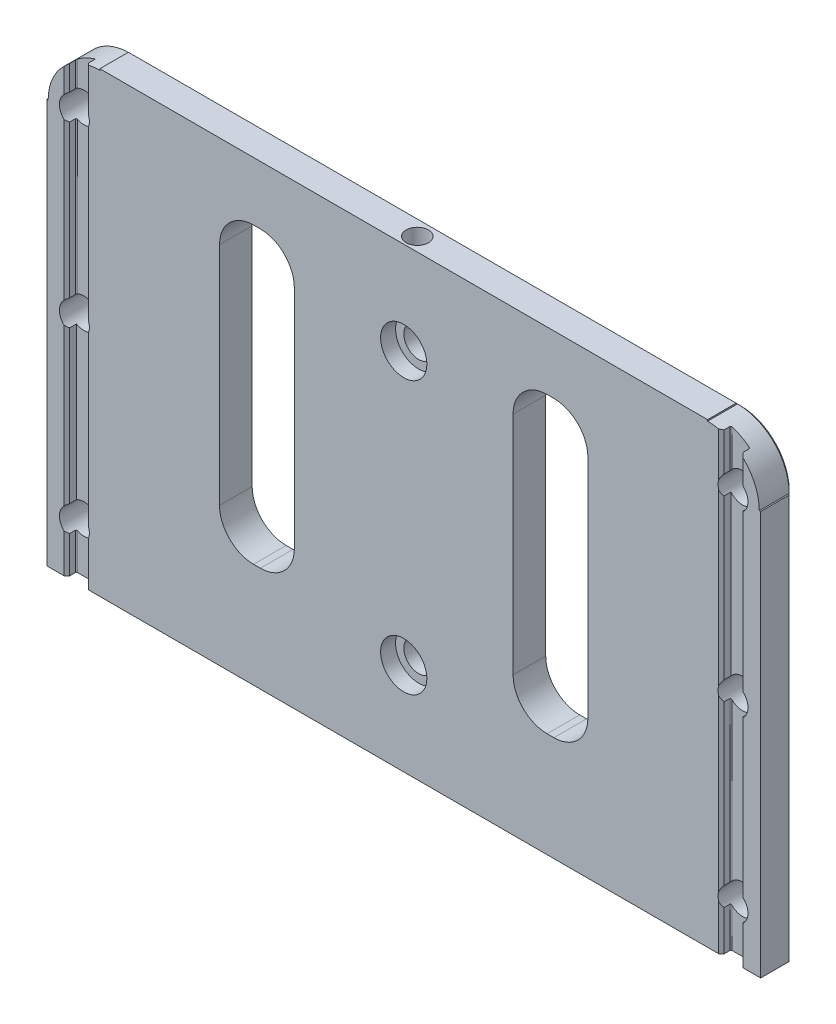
ISO-10303-21;
HEADER;
FILE_DESCRIPTION(('STEP AP214'),'2;1');
FILE_NAME('part.step','',(''),(''),'','','');
FILE_SCHEMA(('AUTOMOTIVE_DESIGN { 1 0 10303 214 1 1 1 1 }'));
ENDSEC;
DATA;
#1=APPLICATION_CONTEXT('core data for automotive mechanical design processes');
#2=APPLICATION_PROTOCOL_DEFINITION('international standard','automotive_design',2000,#1);
#3=PRODUCT_CONTEXT('',#1,'mechanical');
#4=PRODUCT('Part','Part','',(#3));
#5=PRODUCT_RELATED_PRODUCT_CATEGORY('part','',(#4));
#6=PRODUCT_DEFINITION_FORMATION('','',#4);
#7=PRODUCT_DEFINITION_CONTEXT('part definition',#1,'design');
#8=PRODUCT_DEFINITION('design','',#6,#7);
#9=PRODUCT_DEFINITION_SHAPE('','',#8);
#10=(LENGTH_UNIT() NAMED_UNIT(*) SI_UNIT(.MILLI.,.METRE.));
#11=(NAMED_UNIT(*) PLANE_ANGLE_UNIT() SI_UNIT($,.RADIAN.));
#12=(NAMED_UNIT(*) SI_UNIT($,.STERADIAN.) SOLID_ANGLE_UNIT());
#13=UNCERTAINTY_MEASURE_WITH_UNIT(LENGTH_MEASURE(1.E-05),#10,'distance_accuracy_value','');
#14=(GEOMETRIC_REPRESENTATION_CONTEXT(3) GLOBAL_UNCERTAINTY_ASSIGNED_CONTEXT((#13)) GLOBAL_UNIT_ASSIGNED_CONTEXT((#10,
#11,#12)) REPRESENTATION_CONTEXT('',''));
#15=CARTESIAN_POINT('',(0.,0.,0.));
#16=DIRECTION('',(0.,0.,1.));
#17=DIRECTION('',(1.,0.,0.));
#18=AXIS2_PLACEMENT_3D('',#15,#16,#17);
#19=CARTESIAN_POINT('',(-66.6496,-42.672,0.));
#20=DIRECTION('',(0.,0.,1.));
#21=DIRECTION('',(1.,0.,0.));
#22=AXIS2_PLACEMENT_3D('',#19,#20,#21);
#23=PLANE('',#22);
#24=CARTESIAN_POINT('',(61.4934,-0.127000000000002,0.));
#25=DIRECTION('',(0.,0.,1.));
#26=DIRECTION('',(1.,0.,0.));
#27=AXIS2_PLACEMENT_3D('',#24,#25,#26);
#28=CIRCLE('',#27,2.794);
#29=CARTESIAN_POINT('',(63.3984,-2.17087157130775,0.));
#30=VERTEX_POINT('',#29);
#31=CARTESIAN_POINT('',(63.3984,1.91687157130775,0.));
#32=VERTEX_POINT('',#31);
#33=EDGE_CURVE('E857',#30,#32,#28,.T.);
#34=ORIENTED_EDGE('',*,*,#33,.F.);
#35=DIRECTION('',(0.,-1.,0.));
#36=VECTOR('',#35,1.);
#37=CARTESIAN_POINT('',(63.3984,-42.672,0.));
#38=LINE('',#37,#36);
#39=CARTESIAN_POINT('',(63.3984,-31.3571284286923,0.));
#40=VERTEX_POINT('',#39);
#41=EDGE_CURVE('E1544',#30,#40,#38,.T.);
#42=ORIENTED_EDGE('',*,*,#41,.T.);
#43=CARTESIAN_POINT('',(61.4934,-33.401,0.));
#44=DIRECTION('',(0.,0.,1.));
#45=DIRECTION('',(1.,0.,0.));
#46=AXIS2_PLACEMENT_3D('',#43,#44,#45);
#47=CIRCLE('',#46,2.794);
#48=CARTESIAN_POINT('',(63.3984,-35.4448715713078,0.));
#49=VERTEX_POINT('',#48);
#50=EDGE_CURVE('E850',#49,#40,#47,.T.);
#51=ORIENTED_EDGE('',*,*,#50,.F.);
#52=DIRECTION('',(0.,-1.,0.));
#53=VECTOR('',#52,1.);
#54=CARTESIAN_POINT('',(63.3984,-42.672,0.));
#55=LINE('',#54,#53);
#56=CARTESIAN_POINT('',(63.3984,-42.672,0.));
#57=VERTEX_POINT('',#56);
#58=EDGE_CURVE('E1538',#49,#57,#55,.T.);
#59=ORIENTED_EDGE('',*,*,#58,.T.);
#60=DIRECTION('',(1.,0.,0.));
#61=VECTOR('',#60,1.);
#62=CARTESIAN_POINT('',(-66.6496,-42.672,0.));
#63=LINE('',#62,#61);
#64=CARTESIAN_POINT('',(66.6496,-42.672,0.));
#65=VERTEX_POINT('',#64);
#66=EDGE_CURVE('E919',#57,#65,#63,.T.);
#67=ORIENTED_EDGE('',*,*,#66,.T.);
#68=DIRECTION('',(0.,1.,0.));
#69=VECTOR('',#68,1.);
#70=CARTESIAN_POINT('',(66.6496,42.672,0.));
#71=LINE('',#70,#69);
#72=CARTESIAN_POINT('',(66.6496,32.766,0.));
#73=VERTEX_POINT('',#72);
#74=EDGE_CURVE('E923',#65,#73,#71,.T.);
#75=ORIENTED_EDGE('',*,*,#74,.T.);
#76=DIRECTION('',(1.,0.,0.));
#77=VECTOR('',#76,1.);
#78=CARTESIAN_POINT('',(66.3956,32.766,0.));
#79=LINE('',#78,#77);
#80=CARTESIAN_POINT('',(66.3956,32.766,0.));
#81=VERTEX_POINT('',#80);
#82=EDGE_CURVE('E905',#81,#73,#79,.T.);
#83=ORIENTED_EDGE('',*,*,#82,.F.);
#84=CARTESIAN_POINT('',(56.7436,32.766,0.));
#85=DIRECTION('',(0.,0.,-1.));
#86=DIRECTION('',(-1.,0.,0.));
#87=AXIS2_PLACEMENT_3D('',#84,#85,#86);
#88=CIRCLE('',#87,9.652);
#89=CARTESIAN_POINT('',(63.3984,39.7570472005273,0.));
#90=VERTEX_POINT('',#89);
#91=EDGE_CURVE('E901',#90,#81,#88,.T.);
#92=ORIENTED_EDGE('',*,*,#91,.F.);
#93=DIRECTION('',(0.,-1.,0.));
#94=VECTOR('',#93,1.);
#95=CARTESIAN_POINT('',(63.3984,-42.672,0.));
#96=LINE('',#95,#94);
#97=CARTESIAN_POINT('',(63.3984,35.1908715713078,0.));
#98=VERTEX_POINT('',#97);
#99=EDGE_CURVE('E1541',#90,#98,#96,.T.);
#100=ORIENTED_EDGE('',*,*,#99,.T.);
#101=CARTESIAN_POINT('',(61.4934,33.147,0.));
#102=DIRECTION('',(0.,0.,1.));
#103=DIRECTION('',(1.,0.,0.));
#104=AXIS2_PLACEMENT_3D('',#101,#102,#103);
#105=CIRCLE('',#104,2.794);
#106=CARTESIAN_POINT('',(63.3984,31.1031284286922,0.));
#107=VERTEX_POINT('',#106);
#108=EDGE_CURVE('E829',#107,#98,#105,.T.);
#109=ORIENTED_EDGE('',*,*,#108,.F.);
#110=DIRECTION('',(0.,-1.,0.));
#111=VECTOR('',#110,1.);
#112=CARTESIAN_POINT('',(63.3984,-42.672,0.));
#113=LINE('',#112,#111);
#114=EDGE_CURVE('E1535',#107,#32,#113,.T.);
#115=ORIENTED_EDGE('',*,*,#114,.T.);
#116=EDGE_LOOP('',(#34,#42,#51,#59,#67,#75,#83,#92,#100,#109,#115));
#117=FACE_BOUND('',#116,.T.);
#118=ADVANCED_FACE('F15',(#117),#23,.T.);
#119=DIRECTION('',(0.,1.,0.));
#120=VECTOR('',#119,1.);
#121=CARTESIAN_POINT('',(20.4216,25.4,0.));
#122=LINE('',#121,#120);
#123=CARTESIAN_POINT('',(20.4216,-16.764,0.));
#124=VERTEX_POINT('',#123);
#125=CARTESIAN_POINT('',(20.4216,25.4,0.));
#126=VERTEX_POINT('',#125);
#127=EDGE_CURVE('E742',#124,#126,#122,.T.);
#128=ORIENTED_EDGE('',*,*,#127,.T.);
#129=CARTESIAN_POINT('',(26.7716,25.4,0.));
#130=DIRECTION('',(0.,0.,-1.));
#131=DIRECTION('',(-1.,0.,0.));
#132=AXIS2_PLACEMENT_3D('',#129,#130,#131);
#133=CIRCLE('',#132,6.35);
#134=CARTESIAN_POINT('',(26.7716,31.75,0.));
#135=VERTEX_POINT('',#134);
#136=EDGE_CURVE('E720',#126,#135,#133,.T.);
#137=ORIENTED_EDGE('',*,*,#136,.T.);
#138=DIRECTION('',(1.,0.,0.));
#139=VECTOR('',#138,1.);
#140=CARTESIAN_POINT('',(28.0416,31.75,0.));
#141=LINE('',#140,#139);
#142=CARTESIAN_POINT('',(28.0416,31.75,0.));
#143=VERTEX_POINT('',#142);
#144=EDGE_CURVE('E724',#135,#143,#141,.T.);
#145=ORIENTED_EDGE('',*,*,#144,.T.);
#146=CARTESIAN_POINT('',(28.0416,25.4,0.));
#147=DIRECTION('',(0.,0.,-1.));
#148=DIRECTION('',(-1.,0.,0.));
#149=AXIS2_PLACEMENT_3D('',#146,#147,#148);
#150=CIRCLE('',#149,6.35);
#151=CARTESIAN_POINT('',(34.3916,25.4,0.));
#152=VERTEX_POINT('',#151);
#153=EDGE_CURVE('E757',#143,#152,#150,.T.);
#154=ORIENTED_EDGE('',*,*,#153,.T.);
#155=DIRECTION('',(0.,-1.,0.));
#156=VECTOR('',#155,1.);
#157=CARTESIAN_POINT('',(34.3916,25.4,0.));
#158=LINE('',#157,#156);
#159=CARTESIAN_POINT('',(34.3916,-16.764,0.));
#160=VERTEX_POINT('',#159);
#161=EDGE_CURVE('E754',#152,#160,#158,.T.);
#162=ORIENTED_EDGE('',*,*,#161,.T.);
#163=CARTESIAN_POINT('',(28.0416,-16.764,0.));
#164=DIRECTION('',(0.,0.,-1.));
#165=DIRECTION('',(-1.,0.,0.));
#166=AXIS2_PLACEMENT_3D('',#163,#164,#165);
#167=CIRCLE('',#166,6.35);
#168=CARTESIAN_POINT('',(28.0416,-23.114,0.));
#169=VERTEX_POINT('',#168);
#170=EDGE_CURVE('E751',#160,#169,#167,.T.);
#171=ORIENTED_EDGE('',*,*,#170,.T.);
#172=DIRECTION('',(-1.,0.,0.));
#173=VECTOR('',#172,1.);
#174=CARTESIAN_POINT('',(28.0416,-23.114,0.));
#175=LINE('',#174,#173);
#176=CARTESIAN_POINT('',(26.7716,-23.114,0.));
#177=VERTEX_POINT('',#176);
#178=EDGE_CURVE('E748',#169,#177,#175,.T.);
#179=ORIENTED_EDGE('',*,*,#178,.T.);
#180=CARTESIAN_POINT('',(26.7716,-16.764,0.));
#181=DIRECTION('',(0.,0.,-1.));
#182=DIRECTION('',(-1.,0.,0.));
#183=AXIS2_PLACEMENT_3D('',#180,#181,#182);
#184=CIRCLE('',#183,6.35);
#185=EDGE_CURVE('E745',#177,#124,#184,.T.);
#186=ORIENTED_EDGE('',*,*,#185,.T.);
#187=EDGE_LOOP('',(#128,#137,#145,#154,#162,#171,#179,#186));
#188=FACE_BOUND('',#187,.T.);
#189=CARTESIAN_POINT('',(-26.7716,25.4,0.));
#190=DIRECTION('',(0.,0.,1.));
#191=DIRECTION('',(1.,0.,0.));
#192=AXIS2_PLACEMENT_3D('',#189,#190,#191);
#193=CIRCLE('',#192,6.35);
#194=CARTESIAN_POINT('',(-20.4216,25.4,0.));
#195=VERTEX_POINT('',#194);
#196=CARTESIAN_POINT('',(-26.7716,31.75,0.));
#197=VERTEX_POINT('',#196);
#198=EDGE_CURVE('E765',#195,#197,#193,.T.);
#199=ORIENTED_EDGE('',*,*,#198,.F.);
#200=DIRECTION('',(0.,1.,0.));
#201=VECTOR('',#200,1.);
#202=CARTESIAN_POINT('',(-20.4216,25.4,0.));
#203=LINE('',#202,#201);
#204=CARTESIAN_POINT('',(-20.4216,-16.764,0.));
#205=VERTEX_POINT('',#204);
#206=EDGE_CURVE('E784',#205,#195,#203,.T.);
#207=ORIENTED_EDGE('',*,*,#206,.F.);
#208=CARTESIAN_POINT('',(-26.7716,-16.764,0.));
#209=DIRECTION('',(0.,0.,1.));
#210=DIRECTION('',(1.,0.,0.));
#211=AXIS2_PLACEMENT_3D('',#208,#209,#210);
#212=CIRCLE('',#211,6.35);
#213=CARTESIAN_POINT('',(-26.7716,-23.114,0.));
#214=VERTEX_POINT('',#213);
#215=EDGE_CURVE('E822',#214,#205,#212,.T.);
#216=ORIENTED_EDGE('',*,*,#215,.F.);
#217=DIRECTION('',(1.,0.,0.));
#218=VECTOR('',#217,1.);
#219=CARTESIAN_POINT('',(-28.0416,-23.114,0.));
#220=LINE('',#219,#218);
#221=CARTESIAN_POINT('',(-28.0416,-23.114,0.));
#222=VERTEX_POINT('',#221);
#223=EDGE_CURVE('E819',#222,#214,#220,.T.);
#224=ORIENTED_EDGE('',*,*,#223,.F.);
#225=CARTESIAN_POINT('',(-28.0416,-16.764,0.));
#226=DIRECTION('',(0.,0.,1.));
#227=DIRECTION('',(1.,0.,0.));
#228=AXIS2_PLACEMENT_3D('',#225,#226,#227);
#229=CIRCLE('',#228,6.35);
#230=CARTESIAN_POINT('',(-34.3916,-16.764,0.));
#231=VERTEX_POINT('',#230);
#232=EDGE_CURVE('E816',#231,#222,#229,.T.);
#233=ORIENTED_EDGE('',*,*,#232,.F.);
#234=DIRECTION('',(0.,-1.,0.));
#235=VECTOR('',#234,1.);
#236=CARTESIAN_POINT('',(-34.3916,25.4,0.));
#237=LINE('',#236,#235);
#238=CARTESIAN_POINT('',(-34.3916,25.4,0.));
#239=VERTEX_POINT('',#238);
#240=EDGE_CURVE('E813',#239,#231,#237,.T.);
#241=ORIENTED_EDGE('',*,*,#240,.F.);
#242=CARTESIAN_POINT('',(-28.0416,25.4,0.));
#243=DIRECTION('',(0.,0.,1.));
#244=DIRECTION('',(1.,0.,0.));
#245=AXIS2_PLACEMENT_3D('',#242,#243,#244);
#246=CIRCLE('',#245,6.35);
#247=CARTESIAN_POINT('',(-28.0416,31.75,0.));
#248=VERTEX_POINT('',#247);
#249=EDGE_CURVE('E810',#248,#239,#246,.T.);
#250=ORIENTED_EDGE('',*,*,#249,.F.);
#251=DIRECTION('',(-1.,0.,0.));
#252=VECTOR('',#251,1.);
#253=CARTESIAN_POINT('',(-28.0416,31.75,0.));
#254=LINE('',#253,#252);
#255=EDGE_CURVE('E807',#197,#248,#254,.T.);
#256=ORIENTED_EDGE('',*,*,#255,.F.);
#257=EDGE_LOOP('',(#199,#207,#216,#224,#233,#241,#250,#256));
#258=FACE_BOUND('',#257,.T.);
#259=CARTESIAN_POINT('',(0.,-25.4,0.));
#260=DIRECTION('',(0.,0.,1.));
#261=DIRECTION('',(1.,0.,0.));
#262=AXIS2_PLACEMENT_3D('',#259,#260,#261);
#263=CIRCLE('',#262,4.318);
#264=CARTESIAN_POINT('',(4.318,-25.4,0.));
#265=VERTEX_POINT('',#264);
#266=EDGE_CURVE('E717',#265,#265,#263,.T.);
#267=ORIENTED_EDGE('',*,*,#266,.F.);
#268=EDGE_LOOP('',(#267));
#269=FACE_BOUND('',#268,.T.);
#270=CARTESIAN_POINT('',(0.,25.4,0.));
#271=DIRECTION('',(0.,0.,1.));
#272=DIRECTION('',(1.,0.,0.));
#273=AXIS2_PLACEMENT_3D('',#270,#271,#272);
#274=CIRCLE('',#273,4.318);
#275=CARTESIAN_POINT('',(4.318,25.4,0.));
#276=VERTEX_POINT('',#275);
#277=EDGE_CURVE('E705',#276,#276,#274,.T.);
#278=ORIENTED_EDGE('',*,*,#277,.F.);
#279=EDGE_LOOP('',(#278));
#280=FACE_BOUND('',#279,.T.);
#281=CARTESIAN_POINT('',(58.8264,0.705794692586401,0.));
#282=VERTEX_POINT('',#281);
#283=CARTESIAN_POINT('',(58.8264,-0.959794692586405,0.));
#284=VERTEX_POINT('',#283);
#285=EDGE_CURVE('E860',#282,#284,#28,.T.);
#286=ORIENTED_EDGE('',*,*,#285,.F.);
#287=DIRECTION('',(0.,1.,0.));
#288=VECTOR('',#287,1.);
#289=CARTESIAN_POINT('',(58.8264,-42.672,0.));
#290=LINE('',#289,#288);
#291=CARTESIAN_POINT('',(58.8264,32.3142053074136,0.));
#292=VERTEX_POINT('',#291);
#293=EDGE_CURVE('E1514',#282,#292,#290,.T.);
#294=ORIENTED_EDGE('',*,*,#293,.T.);
#295=CARTESIAN_POINT('',(58.8264,33.9797946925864,0.));
#296=VERTEX_POINT('',#295);
#297=EDGE_CURVE('E846',#296,#292,#105,.T.);
#298=ORIENTED_EDGE('',*,*,#297,.F.);
#299=DIRECTION('',(0.,1.,0.));
#300=VECTOR('',#299,1.);
#301=CARTESIAN_POINT('',(58.8264,-42.672,0.));
#302=LINE('',#301,#300);
#303=CARTESIAN_POINT('',(58.8264,42.1905980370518,0.));
#304=VERTEX_POINT('',#303);
#305=EDGE_CURVE('E1509',#296,#304,#302,.T.);
#306=ORIENTED_EDGE('',*,*,#305,.T.);
#307=CARTESIAN_POINT('',(56.7436,42.418,0.));
#308=VERTEX_POINT('',#307);
#309=EDGE_CURVE('E902',#308,#304,#88,.T.);
#310=ORIENTED_EDGE('',*,*,#309,.F.);
#311=DIRECTION('',(0.,-1.,0.));
#312=VECTOR('',#311,1.);
#313=CARTESIAN_POINT('',(56.7436,-42.6720000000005,0.));
#314=LINE('',#313,#312);
#315=CARTESIAN_POINT('',(56.7436,42.672,0.));
#316=VERTEX_POINT('',#315);
#317=EDGE_CURVE('E933',#316,#308,#314,.T.);
#318=ORIENTED_EDGE('',*,*,#317,.F.);
#319=DIRECTION('',(-1.,0.,0.));
#320=VECTOR('',#319,1.);
#321=CARTESIAN_POINT('',(-66.6496,42.672,0.));
#322=LINE('',#321,#320);
#323=CARTESIAN_POINT('',(-56.7436,42.672,0.));
#324=VERTEX_POINT('',#323);
#325=EDGE_CURVE('E927',#316,#324,#322,.T.);
#326=ORIENTED_EDGE('',*,*,#325,.T.);
#327=DIRECTION('',(0.,-1.,0.));
#328=VECTOR('',#327,1.);
#329=CARTESIAN_POINT('',(-56.7436,-42.672,0.));
#330=LINE('',#329,#328);
#331=CARTESIAN_POINT('',(-56.7436,42.418,0.));
#332=VERTEX_POINT('',#331);
#333=EDGE_CURVE('E937',#324,#332,#330,.T.);
#334=ORIENTED_EDGE('',*,*,#333,.T.);
#335=CARTESIAN_POINT('',(-56.7436,32.766,0.));
#336=DIRECTION('',(0.,0.,1.));
#337=DIRECTION('',(1.,0.,0.));
#338=AXIS2_PLACEMENT_3D('',#335,#336,#337);
#339=CIRCLE('',#338,9.652);
#340=CARTESIAN_POINT('',(-58.8264,42.1905980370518,0.));
#341=VERTEX_POINT('',#340);
#342=EDGE_CURVE('E889',#332,#341,#339,.T.);
#343=ORIENTED_EDGE('',*,*,#342,.T.);
#344=DIRECTION('',(0.,-1.,0.));
#345=VECTOR('',#344,1.);
#346=CARTESIAN_POINT('',(-58.8264,34.9204584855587,0.));
#347=LINE('',#346,#345);
#348=CARTESIAN_POINT('',(-58.8264,33.9797946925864,0.));
#349=VERTEX_POINT('',#348);
#350=EDGE_CURVE('E1493',#341,#349,#347,.T.);
#351=ORIENTED_EDGE('',*,*,#350,.T.);
#352=CARTESIAN_POINT('',(-61.4934,33.147,0.));
#353=DIRECTION('',(0.,0.,1.));
#354=DIRECTION('',(1.,0.,0.));
#355=AXIS2_PLACEMENT_3D('',#352,#353,#354);
#356=CIRCLE('',#355,2.794);
#357=CARTESIAN_POINT('',(-58.8264,32.3142053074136,0.));
#358=VERTEX_POINT('',#357);
#359=EDGE_CURVE('E864',#358,#349,#356,.T.);
#360=ORIENTED_EDGE('',*,*,#359,.F.);
#361=DIRECTION('',(0.,-1.,0.));
#362=VECTOR('',#361,1.);
#363=CARTESIAN_POINT('',(-58.8264,1.64645848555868,0.));
#364=LINE('',#363,#362);
#365=CARTESIAN_POINT('',(-58.8264,0.705794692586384,0.));
#366=VERTEX_POINT('',#365);
#367=EDGE_CURVE('E1512',#358,#366,#364,.T.);
#368=ORIENTED_EDGE('',*,*,#367,.T.);
#369=CARTESIAN_POINT('',(-61.4934,-0.127000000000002,0.));
#370=DIRECTION('',(0.,0.,1.));
#371=DIRECTION('',(1.,0.,0.));
#372=AXIS2_PLACEMENT_3D('',#369,#370,#371);
#373=CIRCLE('',#372,2.794);
#374=CARTESIAN_POINT('',(-58.8264,-0.959794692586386,0.));
#375=VERTEX_POINT('',#374);
#376=EDGE_CURVE('E878',#375,#366,#373,.T.);
#377=ORIENTED_EDGE('',*,*,#376,.F.);
#378=DIRECTION('',(0.,-1.,0.));
#379=VECTOR('',#378,1.);
#380=CARTESIAN_POINT('',(-58.8264,-31.6275415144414,0.));
#381=LINE('',#380,#379);
#382=CARTESIAN_POINT('',(-58.8264,-32.5682053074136,0.));
#383=VERTEX_POINT('',#382);
#384=EDGE_CURVE('E1494',#375,#383,#381,.T.);
#385=ORIENTED_EDGE('',*,*,#384,.T.);
#386=CARTESIAN_POINT('',(-61.4934,-33.401,0.));
#387=DIRECTION('',(0.,0.,1.));
#388=DIRECTION('',(1.,0.,0.));
#389=AXIS2_PLACEMENT_3D('',#386,#387,#388);
#390=CIRCLE('',#389,2.794);
#391=CARTESIAN_POINT('',(-58.8264,-34.2337946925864,0.));
#392=VERTEX_POINT('',#391);
#393=EDGE_CURVE('E871',#392,#383,#390,.T.);
#394=ORIENTED_EDGE('',*,*,#393,.F.);
#395=DIRECTION('',(0.,-1.,0.));
#396=VECTOR('',#395,1.);
#397=CARTESIAN_POINT('',(-58.8264,-42.672,0.));
#398=LINE('',#397,#396);
#399=CARTESIAN_POINT('',(-58.8264,-42.672,0.));
#400=VERTEX_POINT('',#399);
#401=EDGE_CURVE('E1499',#392,#400,#398,.T.);
#402=ORIENTED_EDGE('',*,*,#401,.T.);
#403=CARTESIAN_POINT('',(58.8264,-42.672,0.));
#404=VERTEX_POINT('',#403);
#405=EDGE_CURVE('E924',#400,#404,#63,.T.);
#406=ORIENTED_EDGE('',*,*,#405,.T.);
#407=DIRECTION('',(0.,1.,0.));
#408=VECTOR('',#407,1.);
#409=CARTESIAN_POINT('',(58.8264,-42.672,0.));
#410=LINE('',#409,#408);
#411=CARTESIAN_POINT('',(58.8264,-34.2337946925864,0.));
#412=VERTEX_POINT('',#411);
#413=EDGE_CURVE('E1506',#404,#412,#410,.T.);
#414=ORIENTED_EDGE('',*,*,#413,.T.);
#415=CARTESIAN_POINT('',(58.8264,-32.5682053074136,0.));
#416=VERTEX_POINT('',#415);
#417=EDGE_CURVE('E853',#416,#412,#47,.T.);
#418=ORIENTED_EDGE('',*,*,#417,.F.);
#419=DIRECTION('',(0.,1.,0.));
#420=VECTOR('',#419,1.);
#421=CARTESIAN_POINT('',(58.8264,-42.672,0.));
#422=LINE('',#421,#420);
#423=EDGE_CURVE('E1503',#416,#284,#422,.T.);
#424=ORIENTED_EDGE('',*,*,#423,.T.);
#425=EDGE_LOOP('',(#286,#294,#298,#306,#310,#318,#326,#334,#343,#351,#360,#368,#377,#385,#394,
#402,#406,#414,#418,#424));
#426=FACE_BOUND('',#425,.T.);
#427=ADVANCED_FACE('F1268',(#188,#258,#269,#280,#426),#23,.T.);
#428=CARTESIAN_POINT('',(-66.6496,-42.672,-6.096));
#429=DIRECTION('',(0.,-1.,0.));
#430=DIRECTION('',(1.,0.,0.));
#431=AXIS2_PLACEMENT_3D('',#428,#429,#430);
#432=PLANE('',#431);
#433=DIRECTION('',(0.,0.,1.));
#434=VECTOR('',#433,1.);
#435=CARTESIAN_POINT('',(-66.6496,-42.672,-6.096));
#436=LINE('',#435,#434);
#437=CARTESIAN_POINT('',(-66.6496,-42.672,-5.334));
#438=VERTEX_POINT('',#437);
#439=CARTESIAN_POINT('',(-66.6496,-42.672,0.));
#440=VERTEX_POINT('',#439);
#441=EDGE_CURVE('E930',#438,#440,#436,.T.);
#442=ORIENTED_EDGE('',*,*,#441,.F.);
#443=DIRECTION('',(1.,0.,0.));
#444=VECTOR('',#443,1.);
#445=CARTESIAN_POINT('',(66.6496,-42.672,-5.334));
#446=LINE('',#445,#444);
#447=CARTESIAN_POINT('',(66.6496,-42.672,-5.334));
#448=VERTEX_POINT('',#447);
#449=EDGE_CURVE('E1396',#438,#448,#446,.T.);
#450=ORIENTED_EDGE('',*,*,#449,.T.);
#451=DIRECTION('',(0.,0.,1.));
#452=VECTOR('',#451,1.);
#453=CARTESIAN_POINT('',(66.6496,-42.672,-6.096));
#454=LINE('',#453,#452);
#455=EDGE_CURVE('E931',#448,#65,#454,.T.);
#456=ORIENTED_EDGE('',*,*,#455,.T.);
#457=ORIENTED_EDGE('',*,*,#66,.F.);
#458=DIRECTION('',(0.707106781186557,0.,0.707106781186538));
#459=VECTOR('',#458,1.);
#460=CARTESIAN_POINT('',(-4.67360000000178,-42.672,-68.072));
#461=LINE('',#460,#459);
#462=CARTESIAN_POINT('',(62.8904,-42.672,-0.508));
#463=VERTEX_POINT('',#462);
#464=EDGE_CURVE('E1337',#57,#463,#461,.F.);
#465=ORIENTED_EDGE('',*,*,#464,.T.);
#466=DIRECTION('',(0.,0.,-1.));
#467=VECTOR('',#466,1.);
#468=CARTESIAN_POINT('',(62.8904,-42.672,-6.096));
#469=LINE('',#468,#467);
#470=CARTESIAN_POINT('',(62.8904,-42.672,-1.5748));
#471=VERTEX_POINT('',#470);
#472=EDGE_CURVE('E634',#463,#471,#469,.T.);
#473=ORIENTED_EDGE('',*,*,#472,.T.);
#474=CARTESIAN_POINT('',(62.6872,-42.672,-1.5748));
#475=DIRECTION('',(0.,-1.,0.));
#476=DIRECTION('',(1.,0.,0.));
#477=AXIS2_PLACEMENT_3D('',#474,#475,#476);
#478=CIRCLE('',#477,0.2032);
#479=CARTESIAN_POINT('',(62.6872,-42.672,-1.778));
#480=VERTEX_POINT('',#479);
#481=EDGE_CURVE('E1032',#471,#480,#478,.F.);
#482=ORIENTED_EDGE('',*,*,#481,.T.);
#483=DIRECTION('',(-1.,0.,0.));
#484=VECTOR('',#483,1.);
#485=CARTESIAN_POINT('',(-66.6496,-42.672,-1.778));
#486=LINE('',#485,#484);
#487=CARTESIAN_POINT('',(59.5376,-42.672,-1.778));
#488=VERTEX_POINT('',#487);
#489=EDGE_CURVE('E602',#480,#488,#486,.T.);
#490=ORIENTED_EDGE('',*,*,#489,.T.);
#491=CARTESIAN_POINT('',(59.5376,-42.672,-1.5748));
#492=DIRECTION('',(0.,-1.,0.));
#493=DIRECTION('',(1.,0.,0.));
#494=AXIS2_PLACEMENT_3D('',#491,#492,#493);
#495=CIRCLE('',#494,0.2032);
#496=CARTESIAN_POINT('',(59.3344,-42.672,-1.5748));
#497=VERTEX_POINT('',#496);
#498=EDGE_CURVE('E1142',#488,#497,#495,.F.);
#499=ORIENTED_EDGE('',*,*,#498,.T.);
#500=DIRECTION('',(0.,0.,1.));
#501=VECTOR('',#500,1.);
#502=CARTESIAN_POINT('',(59.3344,-42.672,-6.096));
#503=LINE('',#502,#501);
#504=CARTESIAN_POINT('',(59.3344,-42.672,-0.508));
#505=VERTEX_POINT('',#504);
#506=EDGE_CURVE('E624',#497,#505,#503,.T.);
#507=ORIENTED_EDGE('',*,*,#506,.T.);
#508=DIRECTION('',(0.707106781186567,0.,-0.707106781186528));
#509=VECTOR('',#508,1.);
#510=CARTESIAN_POINT('',(-0.863600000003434,-42.672,59.69));
#511=LINE('',#510,#509);
#512=EDGE_CURVE('E1335',#505,#404,#511,.F.);
#513=ORIENTED_EDGE('',*,*,#512,.T.);
#514=ORIENTED_EDGE('',*,*,#405,.F.);
#515=DIRECTION('',(-0.707106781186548,0.,-0.707106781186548));
#516=VECTOR('',#515,1.);
#517=CARTESIAN_POINT('',(-65.786,-42.672,-6.9596));
#518=LINE('',#517,#516);
#519=CARTESIAN_POINT('',(-59.3344,-42.672,-0.508000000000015));
#520=VERTEX_POINT('',#519);
#521=EDGE_CURVE('E1331',#400,#520,#518,.T.);
#522=ORIENTED_EDGE('',*,*,#521,.T.);
#523=DIRECTION('',(0.,0.,1.));
#524=VECTOR('',#523,1.);
#525=CARTESIAN_POINT('',(-59.3344,-42.672,-6.096));
#526=LINE('',#525,#524);
#527=CARTESIAN_POINT('',(-59.3344,-42.672,-1.5748));
#528=VERTEX_POINT('',#527);
#529=EDGE_CURVE('E666',#528,#520,#526,.T.);
#530=ORIENTED_EDGE('',*,*,#529,.F.);
#531=CARTESIAN_POINT('',(-59.5376,-42.672,-1.5748));
#532=DIRECTION('',(0.,-1.,0.));
#533=DIRECTION('',(1.,0.,0.));
#534=AXIS2_PLACEMENT_3D('',#531,#532,#533);
#535=CIRCLE('',#534,0.2032);
#536=CARTESIAN_POINT('',(-59.5376,-42.672,-1.778));
#537=VERTEX_POINT('',#536);
#538=EDGE_CURVE('E1151',#528,#537,#535,.F.);
#539=ORIENTED_EDGE('',*,*,#538,.T.);
#540=DIRECTION('',(-1.,0.,0.));
#541=VECTOR('',#540,1.);
#542=CARTESIAN_POINT('',(-66.6496,-42.672,-1.778));
#543=LINE('',#542,#541);
#544=CARTESIAN_POINT('',(-62.6872,-42.672,-1.778));
#545=VERTEX_POINT('',#544);
#546=EDGE_CURVE('E651',#537,#545,#543,.T.);
#547=ORIENTED_EDGE('',*,*,#546,.T.);
#548=CARTESIAN_POINT('',(-62.6872,-42.672,-1.5748));
#549=DIRECTION('',(0.,-1.,0.));
#550=DIRECTION('',(1.,0.,0.));
#551=AXIS2_PLACEMENT_3D('',#548,#549,#550);
#552=CIRCLE('',#551,0.2032);
#553=CARTESIAN_POINT('',(-62.8904,-42.672,-1.5748));
#554=VERTEX_POINT('',#553);
#555=EDGE_CURVE('E1214',#545,#554,#552,.F.);
#556=ORIENTED_EDGE('',*,*,#555,.T.);
#557=DIRECTION('',(0.,0.,-1.));
#558=VECTOR('',#557,1.);
#559=CARTESIAN_POINT('',(-62.8904,-42.672,-6.096));
#560=LINE('',#559,#558);
#561=CARTESIAN_POINT('',(-62.8904,-42.672,-0.507999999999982));
#562=VERTEX_POINT('',#561);
#563=EDGE_CURVE('E682',#562,#554,#560,.T.);
#564=ORIENTED_EDGE('',*,*,#563,.F.);
#565=DIRECTION('',(-0.707106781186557,0.,0.707106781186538));
#566=VECTOR('',#565,1.);
#567=CARTESIAN_POINT('',(-61.976,-42.672,-1.42239999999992));
#568=LINE('',#567,#566);
#569=CARTESIAN_POINT('',(-63.3984,-42.672,0.));
#570=VERTEX_POINT('',#569);
#571=EDGE_CURVE('E1333',#562,#570,#568,.T.);
#572=ORIENTED_EDGE('',*,*,#571,.T.);
#573=EDGE_CURVE('E920',#440,#570,#63,.T.);
#574=ORIENTED_EDGE('',*,*,#573,.F.);
#575=EDGE_LOOP('',(#442,#450,#456,#457,#465,#473,#482,#490,#499,#507,#513,#514,#522,#530,#539,
#547,#556,#564,#572,#574));
#576=FACE_BOUND('',#575,.T.);
#577=ADVANCED_FACE('F1274',(#576),#432,.T.);
#578=CARTESIAN_POINT('',(56.7436,32.766,-6.096));
#579=DIRECTION('',(0.,0.,1.));
#580=DIRECTION('',(1.,0.,0.));
#581=AXIS2_PLACEMENT_3D('',#578,#579,#580);
#582=CYLINDRICAL_SURFACE('',#581,9.652);
#583=DIRECTION('',(0.,0.,1.));
#584=VECTOR('',#583,1.);
#585=CARTESIAN_POINT('',(66.3956,32.766,-6.096));
#586=LINE('',#585,#584);
#587=CARTESIAN_POINT('',(66.3956,32.766,-5.588));
#588=VERTEX_POINT('',#587);
#589=EDGE_CURVE('E908',#588,#81,#586,.T.);
#590=ORIENTED_EDGE('',*,*,#589,.F.);
#591=CARTESIAN_POINT('',(56.7436,32.766,-5.588));
#592=DIRECTION('',(0.,0.,1.));
#593=DIRECTION('',(1.,0.,0.));
#594=AXIS2_PLACEMENT_3D('',#591,#592,#593);
#595=CIRCLE('',#594,9.652);
#596=CARTESIAN_POINT('',(56.7436,42.418,-5.588));
#597=VERTEX_POINT('',#596);
#598=EDGE_CURVE('E9',#588,#597,#595,.T.);
#599=ORIENTED_EDGE('',*,*,#598,.T.);
#600=DIRECTION('',(0.,0.,1.));
#601=VECTOR('',#600,1.);
#602=CARTESIAN_POINT('',(56.7436,42.418,-6.096));
#603=LINE('',#602,#601);
#604=EDGE_CURVE('E907',#597,#308,#603,.T.);
#605=ORIENTED_EDGE('',*,*,#604,.T.);
#606=ORIENTED_EDGE('',*,*,#309,.T.);
#607=CARTESIAN_POINT('',(56.7436,32.766,2.08279999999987));
#608=DIRECTION('',(-0.707106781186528,0.,-0.707106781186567));
#609=DIRECTION('',(-0.707106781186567,0.,0.707106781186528));
#610=AXIS2_PLACEMENT_3D('',#607,#608,#609);
#611=ELLIPSE('',#610,13.6499893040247,9.652);
#612=CARTESIAN_POINT('',(59.3344,42.0637878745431,-0.507999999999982));
#613=VERTEX_POINT('',#612);
#614=EDGE_CURVE('E1325',#304,#613,#611,.T.);
#615=ORIENTED_EDGE('',*,*,#614,.T.);
#616=DIRECTION('',(0.,0.,1.));
#617=VECTOR('',#616,1.);
#618=CARTESIAN_POINT('',(59.3344,42.0637878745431,-6.096));
#619=LINE('',#618,#617);
#620=CARTESIAN_POINT('',(59.3344,42.0637878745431,-1.5748));
#621=VERTEX_POINT('',#620);
#622=EDGE_CURVE('E621',#621,#613,#619,.T.);
#623=ORIENTED_EDGE('',*,*,#622,.F.);
#624=CARTESIAN_POINT('',(59.3344,42.0637878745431,-1.5748));
#625=CARTESIAN_POINT('',(59.3343889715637,42.0637903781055,-1.58592168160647));
#626=CARTESIAN_POINT('',(59.3353123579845,42.0635336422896,-1.59703818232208));
#627=CARTESIAN_POINT('',(59.3389439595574,42.0625208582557,-1.61893295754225));
#628=CARTESIAN_POINT('',(59.3416490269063,42.0617656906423,-1.62971179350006));
#629=CARTESIAN_POINT('',(59.3487610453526,42.0597749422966,-1.65064627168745));
#630=CARTESIAN_POINT('',(59.3531682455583,42.058539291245,-1.66080182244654));
#631=CARTESIAN_POINT('',(59.3635347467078,42.0556218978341,-1.68021618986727));
#632=CARTESIAN_POINT('',(59.369494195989,42.0539401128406,-1.68947492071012));
#633=CARTESIAN_POINT('',(59.3828769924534,42.0501461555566,-1.70699051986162));
#634=CARTESIAN_POINT('',(59.3903208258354,42.048027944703,-1.71523040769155));
#635=CARTESIAN_POINT('',(59.4063873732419,42.0434316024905,-1.73034809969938));
#636=CARTESIAN_POINT('',(59.4150103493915,42.0409533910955,-1.73722560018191));
#637=CARTESIAN_POINT('',(59.433506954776,42.0356062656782,-1.74968147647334));
#638=CARTESIAN_POINT('',(59.4434138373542,42.0327266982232,-1.7552058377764));
#639=CARTESIAN_POINT('',(59.4639441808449,42.0267205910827,-1.76451580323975));
#640=CARTESIAN_POINT('',(59.4745676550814,42.0235940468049,-1.76830137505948));
#641=CARTESIAN_POINT('',(59.4939353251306,42.0178559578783,-1.77344955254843));
#642=CARTESIAN_POINT('',(59.5025994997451,42.0152760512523,-1.77515598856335));
#643=CARTESIAN_POINT('',(59.5200432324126,42.0100549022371,-1.77743122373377));
#644=CARTESIAN_POINT('',(59.5288225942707,42.0074137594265,-1.77800175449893));
#645=CARTESIAN_POINT('',(59.5376,42.0047590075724,-1.778));
#646=B_SPLINE_CURVE_WITH_KNOTS('',3,(#624,#625,#626,#627,#628,#629,#630,#631,#632,#633,#634,
#635,#636,#637,#638,#639,#640,#641,#642,#643,#644,#645),.UNSPECIFIED.,.F.,.F.,(4,2,2,2,2,2,2,2,
2,2,4),(0.,0.0333159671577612,0.0665732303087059,0.0998353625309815,0.133100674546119,
0.166861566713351,0.200629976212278,0.23558255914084,0.27053579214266,0.298066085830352,
0.32555437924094),.UNSPECIFIED.);
#647=CARTESIAN_POINT('',(59.5376,42.0047590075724,-1.778));
#648=VERTEX_POINT('',#647);
#649=EDGE_CURVE('E1103',#621,#648,#646,.T.);
#650=ORIENTED_EDGE('',*,*,#649,.T.);
#651=CARTESIAN_POINT('',(56.7436,32.766,-1.778));
#652=DIRECTION('',(0.,0.,1.));
#653=DIRECTION('',(1.,0.,0.));
#654=AXIS2_PLACEMENT_3D('',#651,#652,#653);
#655=CIRCLE('',#654,9.652);
#656=CARTESIAN_POINT('',(62.6872,40.3709144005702,-1.778));
#657=VERTEX_POINT('',#656);
#658=EDGE_CURVE('E598',#657,#648,#655,.T.);
#659=ORIENTED_EDGE('',*,*,#658,.F.);
#660=CARTESIAN_POINT('',(62.6872,40.3709144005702,-1.778));
#661=CARTESIAN_POINT('',(62.7007198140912,40.3603502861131,-1.77799116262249));
#662=CARTESIAN_POINT('',(62.7142260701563,40.3497342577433,-1.77664930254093));
#663=CARTESIAN_POINT('',(62.7409259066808,40.3286363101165,-1.77124719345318));
#664=CARTESIAN_POINT('',(62.7541170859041,40.3181555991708,-1.76717046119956));
#665=CARTESIAN_POINT('',(62.7781630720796,40.2989517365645,-1.75691287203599));
#666=CARTESIAN_POINT('',(62.7891064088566,40.2901703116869,-1.75104999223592));
#667=CARTESIAN_POINT('',(62.8100629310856,40.2732838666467,-1.73713486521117));
#668=CARTESIAN_POINT('',(62.8200782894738,40.2651772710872,-1.72908791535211));
#669=CARTESIAN_POINT('',(62.8367091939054,40.2516671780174,-1.71279031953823));
#670=CARTESIAN_POINT('',(62.8435874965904,40.2460617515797,-1.7049756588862));
#671=CARTESIAN_POINT('',(62.8562698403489,40.2357013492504,-1.68801391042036));
#672=CARTESIAN_POINT('',(62.8620748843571,40.2309455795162,-1.67886808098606));
#673=CARTESIAN_POINT('',(62.8714215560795,40.2232741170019,-1.66103228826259));
#674=CARTESIAN_POINT('',(62.8751805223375,40.2201828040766,-1.65253218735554));
#675=CARTESIAN_POINT('',(62.881551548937,40.2149376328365,-1.63484716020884));
#676=CARTESIAN_POINT('',(62.8841657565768,40.2127820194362,-1.62566355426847));
#677=CARTESIAN_POINT('',(62.8875315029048,40.2100051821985,-1.60951253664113));
#678=CARTESIAN_POINT('',(62.8886009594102,40.2091222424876,-1.60265463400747));
#679=CARTESIAN_POINT('',(62.890038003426,40.2079355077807,-1.58880015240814));
#680=CARTESIAN_POINT('',(62.8904039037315,40.2076331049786,-1.58180328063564));
#681=CARTESIAN_POINT('',(62.8904,40.2076364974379,-1.5748));
#682=B_SPLINE_CURVE_WITH_KNOTS('',3,(#660,#661,#662,#663,#664,#665,#666,#667,#668,#669,#670,
#671,#672,#673,#674,#675,#676,#677,#678,#679,#680,#681),.UNSPECIFIED.,.F.,.F.,(4,2,2,2,2,2,2,2,
2,2,4),(0.,0.0514588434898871,0.103230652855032,0.14867634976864,0.194012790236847,
0.229354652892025,0.264663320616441,0.293929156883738,0.32313985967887,0.344072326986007,
0.365054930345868),.UNSPECIFIED.);
#683=CARTESIAN_POINT('',(62.8904,40.2076364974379,-1.5748));
#684=VERTEX_POINT('',#683);
#685=EDGE_CURVE('E2487',#657,#684,#682,.T.);
#686=ORIENTED_EDGE('',*,*,#685,.T.);
#687=DIRECTION('',(0.,0.,1.));
#688=VECTOR('',#687,1.);
#689=CARTESIAN_POINT('',(62.8904,40.2076364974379,-6.096));
#690=LINE('',#689,#688);
#691=CARTESIAN_POINT('',(62.8904,40.2076364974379,-0.508));
#692=VERTEX_POINT('',#691);
#693=EDGE_CURVE('E581',#692,#684,#690,.F.);
#694=ORIENTED_EDGE('',*,*,#693,.F.);
#695=CARTESIAN_POINT('',(56.7436,32.766,-6.65479999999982));
#696=DIRECTION('',(0.707106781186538,0.,-0.707106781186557));
#697=DIRECTION('',(0.707106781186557,0.,0.707106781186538));
#698=AXIS2_PLACEMENT_3D('',#695,#696,#697);
#699=ELLIPSE('',#698,13.6499893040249,9.652);
#700=EDGE_CURVE('E1323',#692,#90,#699,.T.);
#701=ORIENTED_EDGE('',*,*,#700,.T.);
#702=ORIENTED_EDGE('',*,*,#91,.T.);
#703=EDGE_LOOP('',(#590,#599,#605,#606,#615,#623,#650,#659,#686,#694,#701,#702));
#704=FACE_BOUND('',#703,.T.);
#705=ADVANCED_FACE('F1424',(#704),#582,.T.);
#706=CARTESIAN_POINT('',(61.4934,-0.127000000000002,0.));
#707=DIRECTION('',(0.,0.,1.));
#708=DIRECTION('',(1.,0.,0.));
#709=AXIS2_PLACEMENT_3D('',#706,#707,#708);
#710=CYLINDRICAL_SURFACE('',#709,2.794);
#711=CARTESIAN_POINT('',(61.4934,-0.127000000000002,-6.096));
#712=DIRECTION('',(0.,0.,1.));
#713=DIRECTION('',(1.,0.,0.));
#714=AXIS2_PLACEMENT_3D('',#711,#712,#713);
#715=CIRCLE('',#714,2.794);
#716=CARTESIAN_POINT('',(64.2874,-0.127000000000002,-6.096));
#717=VERTEX_POINT('',#716);
#718=EDGE_CURVE('E861',#717,#717,#715,.T.);
#719=ORIENTED_EDGE('',*,*,#718,.F.);
#720=EDGE_LOOP('',(#719));
#721=FACE_BOUND('',#720,.T.);
#722=DIRECTION('',(0.,0.,1.));
#723=VECTOR('',#722,1.);
#724=CARTESIAN_POINT('',(59.3344,1.64645848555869,0.));
#725=LINE('',#724,#723);
#726=CARTESIAN_POINT('',(59.3344,1.64645848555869,-0.507999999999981));
#727=VERTEX_POINT('',#726);
#728=CARTESIAN_POINT('',(59.3344,1.64645848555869,-1.778));
#729=VERTEX_POINT('',#728);
#730=EDGE_CURVE('E619',#727,#729,#725,.F.);
#731=ORIENTED_EDGE('',*,*,#730,.F.);
#732=CARTESIAN_POINT('',(61.4934,-0.127000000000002,-2.66699999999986));
#733=DIRECTION('',(-0.707106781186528,0.,-0.707106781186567));
#734=DIRECTION('',(-0.707106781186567,0.,0.707106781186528));
#735=AXIS2_PLACEMENT_3D('',#732,#733,#734);
#736=ELLIPSE('',#735,3.95131269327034,2.794);
#737=EDGE_CURVE('E1533',#727,#282,#736,.F.);
#738=ORIENTED_EDGE('',*,*,#737,.T.);
#739=ORIENTED_EDGE('',*,*,#285,.T.);
#740=CARTESIAN_POINT('',(61.4934,-0.127000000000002,-2.66699999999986));
#741=DIRECTION('',(-0.707106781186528,0.,-0.707106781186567));
#742=DIRECTION('',(-0.707106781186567,0.,0.707106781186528));
#743=AXIS2_PLACEMENT_3D('',#740,#741,#742);
#744=ELLIPSE('',#743,3.95131269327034,2.794);
#745=CARTESIAN_POINT('',(59.3344,-1.9004584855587,-0.507999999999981));
#746=VERTEX_POINT('',#745);
#747=EDGE_CURVE('E1529',#284,#746,#744,.F.);
#748=ORIENTED_EDGE('',*,*,#747,.T.);
#749=DIRECTION('',(0.,0.,1.));
#750=VECTOR('',#749,1.);
#751=CARTESIAN_POINT('',(59.3344,-1.9004584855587,0.));
#752=LINE('',#751,#750);
#753=CARTESIAN_POINT('',(59.3344,-1.9004584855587,-1.5748));
#754=VERTEX_POINT('',#753);
#755=EDGE_CURVE('E616',#754,#746,#752,.T.);
#756=ORIENTED_EDGE('',*,*,#755,.F.);
#757=CARTESIAN_POINT('',(59.3344,-1.9004584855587,-1.5748));
#758=CARTESIAN_POINT('',(59.3343841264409,-1.90043711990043,-1.58350103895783));
#759=CARTESIAN_POINT('',(59.3349577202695,-1.90113756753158,-1.59216852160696));
#760=CARTESIAN_POINT('',(59.3371372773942,-1.90378691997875,-1.60907805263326));
#761=CARTESIAN_POINT('',(59.3387312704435,-1.90572134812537,-1.61732385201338));
#762=CARTESIAN_POINT('',(59.3428019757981,-1.91064053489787,-1.63320900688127));
#763=CARTESIAN_POINT('',(59.345274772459,-1.91362063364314,-1.64085087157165));
#764=CARTESIAN_POINT('',(59.3509414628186,-1.92041218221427,-1.65548789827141));
#765=CARTESIAN_POINT('',(59.3541375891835,-1.92422620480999,-1.66248096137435));
#766=CARTESIAN_POINT('',(59.362966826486,-1.93469424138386,-1.6793292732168));
#767=CARTESIAN_POINT('',(59.368988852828,-1.94177590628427,-1.68871391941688));
#768=CARTESIAN_POINT('',(59.3819904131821,-1.95688686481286,-1.70592052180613));
#769=CARTESIAN_POINT('',(59.3889721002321,-1.96491828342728,-1.7137388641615));
#770=CARTESIAN_POINT('',(59.4070684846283,-1.98547256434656,-1.73124877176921));
#771=CARTESIAN_POINT('',(59.4185910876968,-1.99834189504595,-1.7401109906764));
#772=CARTESIAN_POINT('',(59.442679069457,-2.02470938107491,-1.75502479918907));
#773=CARTESIAN_POINT('',(59.455245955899,-2.03820843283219,-1.76107223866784));
#774=CARTESIAN_POINT('',(59.4793448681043,-2.063563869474,-1.76983280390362));
#775=CARTESIAN_POINT('',(59.4907833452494,-2.07539239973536,-1.7728888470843));
#776=CARTESIAN_POINT('',(59.5139792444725,-2.09895478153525,-1.77696051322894));
#777=CARTESIAN_POINT('',(59.5257345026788,-2.11068879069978,-1.77798755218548));
#778=CARTESIAN_POINT('',(59.5376,-2.1223151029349,-1.778));
#779=B_SPLINE_CURVE_WITH_KNOTS('',3,(#757,#758,#759,#760,#761,#762,#763,#764,#765,#766,#767,
#768,#769,#770,#771,#772,#773,#774,#775,#776,#777,#778),.UNSPECIFIED.,.F.,.F.,(4,2,2,2,2,2,2,2,
2,2,4),(0.,0.0260029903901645,0.0517063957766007,0.0772966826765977,0.10296706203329,
0.142372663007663,0.181868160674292,0.239801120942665,0.297819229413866,0.347901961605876,
0.397702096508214),.UNSPECIFIED.);
#780=CARTESIAN_POINT('',(59.5376,-2.1223151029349,-1.778));
#781=VERTEX_POINT('',#780);
#782=EDGE_CURVE('E597',#754,#781,#779,.T.);
#783=ORIENTED_EDGE('',*,*,#782,.T.);
#784=CARTESIAN_POINT('',(61.4934,-0.127000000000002,-1.778));
#785=DIRECTION('',(0.,0.,1.));
#786=DIRECTION('',(1.,0.,0.));
#787=AXIS2_PLACEMENT_3D('',#784,#785,#786);
#788=CIRCLE('',#787,2.794);
#789=CARTESIAN_POINT('',(62.8904,-2.54667497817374,-1.778));
#790=VERTEX_POINT('',#789);
#791=EDGE_CURVE('E587',#790,#781,#788,.F.);
#792=ORIENTED_EDGE('',*,*,#791,.F.);
#793=DIRECTION('',(0.,0.,1.));
#794=VECTOR('',#793,1.);
#795=CARTESIAN_POINT('',(62.8904,-2.54667497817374,0.));
#796=LINE('',#795,#794);
#797=CARTESIAN_POINT('',(62.8904,-2.54667497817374,-0.508));
#798=VERTEX_POINT('',#797);
#799=EDGE_CURVE('E570',#798,#790,#796,.F.);
#800=ORIENTED_EDGE('',*,*,#799,.F.);
#801=CARTESIAN_POINT('',(61.4934,-0.127000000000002,-1.90499999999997));
#802=DIRECTION('',(0.707106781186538,0.,-0.707106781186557));
#803=DIRECTION('',(0.707106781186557,0.,0.707106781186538));
#804=AXIS2_PLACEMENT_3D('',#801,#802,#803);
#805=ELLIPSE('',#804,3.9513126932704,2.794);
#806=EDGE_CURVE('E1531',#798,#30,#805,.F.);
#807=ORIENTED_EDGE('',*,*,#806,.T.);
#808=ORIENTED_EDGE('',*,*,#33,.T.);
#809=CARTESIAN_POINT('',(61.4934,-0.127000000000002,-1.90499999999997));
#810=DIRECTION('',(0.707106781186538,0.,-0.707106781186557));
#811=DIRECTION('',(0.707106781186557,0.,0.707106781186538));
#812=AXIS2_PLACEMENT_3D('',#809,#810,#811);
#813=ELLIPSE('',#812,3.9513126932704,2.794);
#814=CARTESIAN_POINT('',(62.8904,2.29267497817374,-0.508));
#815=VERTEX_POINT('',#814);
#816=EDGE_CURVE('E1527',#32,#815,#813,.F.);
#817=ORIENTED_EDGE('',*,*,#816,.T.);
#818=DIRECTION('',(0.,0.,1.));
#819=VECTOR('',#818,1.);
#820=CARTESIAN_POINT('',(62.8904,2.29267497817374,0.));
#821=LINE('',#820,#819);
#822=CARTESIAN_POINT('',(62.8904,2.29267497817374,-1.5748));
#823=VERTEX_POINT('',#822);
#824=EDGE_CURVE('E582',#823,#815,#821,.T.);
#825=ORIENTED_EDGE('',*,*,#824,.F.);
#826=CARTESIAN_POINT('',(62.8904,2.29267497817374,-1.5748));
#827=CARTESIAN_POINT('',(62.8904133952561,2.29266530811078,-1.58519090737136));
#828=CARTESIAN_POINT('',(62.8896039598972,2.29313458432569,-1.59556871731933));
#829=CARTESIAN_POINT('',(62.8864496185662,2.29495261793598,-1.61596172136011));
#830=CARTESIAN_POINT('',(62.8841118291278,2.29629729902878,-1.62597837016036));
#831=CARTESIAN_POINT('',(62.8780123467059,2.29978720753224,-1.64540390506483));
#832=CARTESIAN_POINT('',(62.8742521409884,2.30193159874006,-1.65481341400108));
#833=CARTESIAN_POINT('',(62.8654698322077,2.30690343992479,-1.67283381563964));
#834=CARTESIAN_POINT('',(62.8604465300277,2.30973153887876,-1.68144393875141));
#835=CARTESIAN_POINT('',(62.8489970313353,2.31612052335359,-1.69817148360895));
#836=CARTESIAN_POINT('',(62.8425070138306,2.31971407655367,-1.7062325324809));
#837=CARTESIAN_POINT('',(62.8285217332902,2.32737356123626,-1.72116657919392));
#838=CARTESIAN_POINT('',(62.8210261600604,2.33143963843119,-1.72803920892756));
#839=CARTESIAN_POINT('',(62.8042182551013,2.34044670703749,-1.74131015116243));
#840=CARTESIAN_POINT('',(62.7947960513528,2.34543330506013,-1.74753843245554));
#841=CARTESIAN_POINT('',(62.7751631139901,2.35566838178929,-1.75831649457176));
#842=CARTESIAN_POINT('',(62.7649518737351,2.36091702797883,-1.7628651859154));
#843=CARTESIAN_POINT('',(62.7436656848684,2.37168304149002,-1.77033188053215));
#844=CARTESIAN_POINT('',(62.7325741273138,2.37720376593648,-1.77319770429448));
#845=CARTESIAN_POINT('',(62.7100683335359,2.38821669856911,-1.77703170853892));
#846=CARTESIAN_POINT('',(62.6986544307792,2.39370892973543,-1.77800178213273));
#847=CARTESIAN_POINT('',(62.6872,2.39911907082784,-1.778));
#848=B_SPLINE_CURVE_WITH_KNOTS('',3,(#826,#827,#828,#829,#830,#831,#832,#833,#834,#835,#836,
#837,#838,#839,#840,#841,#842,#843,#844,#845,#846,#847),.UNSPECIFIED.,.F.,.F.,(4,2,2,2,2,2,2,2,
2,2,4),(0.,0.0311100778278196,0.0620763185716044,0.0930102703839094,0.123973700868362,
0.156708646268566,0.18945371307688,0.226341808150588,0.26325378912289,0.301256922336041,
0.339222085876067),.UNSPECIFIED.);
#849=CARTESIAN_POINT('',(62.6872,2.39911907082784,-1.778));
#850=VERTEX_POINT('',#849);
#851=EDGE_CURVE('E1043',#823,#850,#848,.T.);
#852=ORIENTED_EDGE('',*,*,#851,.T.);
#853=EDGE_CURVE('E599',#729,#850,#788,.F.);
#854=ORIENTED_EDGE('',*,*,#853,.F.);
#855=EDGE_LOOP('',(#731,#738,#739,#748,#756,#783,#792,#800,#807,#808,#817,#825,#852,#854));
#856=FACE_BOUND('',#855,.T.);
#857=ADVANCED_FACE('F595',(#721,#856),#710,.F.);
#858=CARTESIAN_POINT('',(61.4934,-33.401,0.));
#859=DIRECTION('',(0.,0.,1.));
#860=DIRECTION('',(1.,0.,0.));
#861=AXIS2_PLACEMENT_3D('',#858,#859,#860);
#862=CYLINDRICAL_SURFACE('',#861,2.794);
#863=CARTESIAN_POINT('',(61.4934,-33.401,-6.096));
#864=DIRECTION('',(0.,0.,1.));
#865=DIRECTION('',(1.,0.,0.));
#866=AXIS2_PLACEMENT_3D('',#863,#864,#865);
#867=CIRCLE('',#866,2.794);
#868=CARTESIAN_POINT('',(64.2874,-33.401,-6.096));
#869=VERTEX_POINT('',#868);
#870=EDGE_CURVE('E854',#869,#869,#867,.T.);
#871=ORIENTED_EDGE('',*,*,#870,.F.);
#872=EDGE_LOOP('',(#871));
#873=FACE_BOUND('',#872,.T.);
#874=ORIENTED_EDGE('',*,*,#50,.T.);
#875=CARTESIAN_POINT('',(61.4934,-33.401,-1.90499999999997));
#876=DIRECTION('',(0.707106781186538,0.,-0.707106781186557));
#877=DIRECTION('',(0.707106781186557,0.,0.707106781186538));
#878=AXIS2_PLACEMENT_3D('',#875,#876,#877);
#879=ELLIPSE('',#878,3.9513126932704,2.794);
#880=CARTESIAN_POINT('',(62.8904,-30.9813250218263,-0.508));
#881=VERTEX_POINT('',#880);
#882=EDGE_CURVE('E1553',#40,#881,#879,.F.);
#883=ORIENTED_EDGE('',*,*,#882,.T.);
#884=DIRECTION('',(0.,0.,1.));
#885=VECTOR('',#884,1.);
#886=CARTESIAN_POINT('',(62.8904,-30.9813250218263,0.));
#887=LINE('',#886,#885);
#888=CARTESIAN_POINT('',(62.8904,-30.9813250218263,-1.778));
#889=VERTEX_POINT('',#888);
#890=EDGE_CURVE('E627',#889,#881,#887,.T.);
#891=ORIENTED_EDGE('',*,*,#890,.F.);
#892=CARTESIAN_POINT('',(61.4934,-33.401,-1.778));
#893=DIRECTION('',(0.,0.,1.));
#894=DIRECTION('',(1.,0.,0.));
#895=AXIS2_PLACEMENT_3D('',#892,#893,#894);
#896=CIRCLE('',#895,2.794);
#897=CARTESIAN_POINT('',(59.5376,-31.4056848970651,-1.778));
#898=VERTEX_POINT('',#897);
#899=EDGE_CURVE('E590',#898,#889,#896,.F.);
#900=ORIENTED_EDGE('',*,*,#899,.F.);
#901=CARTESIAN_POINT('',(59.5376,-31.4056848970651,-1.778));
#902=CARTESIAN_POINT('',(59.5214935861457,-31.4214558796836,-1.77795719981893));
#903=CARTESIAN_POINT('',(59.5055726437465,-31.4374593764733,-1.77608135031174));
#904=CARTESIAN_POINT('',(59.474398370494,-31.4695354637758,-1.76860409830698));
#905=CARTESIAN_POINT('',(59.4591525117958,-31.485607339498,-1.76296864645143));
#906=CARTESIAN_POINT('',(59.4335100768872,-31.5132613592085,-1.7497536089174));
#907=CARTESIAN_POINT('',(59.4228394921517,-31.5249801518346,-1.7429866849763));
#908=CARTESIAN_POINT('',(59.4025064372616,-31.5476708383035,-1.72713461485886));
#909=CARTESIAN_POINT('',(59.3928407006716,-31.5586451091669,-1.71805733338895));
#910=CARTESIAN_POINT('',(59.3780040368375,-31.5757281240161,-1.70089568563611));
#911=CARTESIAN_POINT('',(59.3724283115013,-31.5822149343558,-1.69353808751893));
#912=CARTESIAN_POINT('',(59.3620876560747,-31.5943437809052,-1.6776366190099));
#913=CARTESIAN_POINT('',(59.3573218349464,-31.5999867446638,-1.66909407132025));
#914=CARTESIAN_POINT('',(59.3498625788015,-31.6088758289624,-1.65293254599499));
#915=CARTESIAN_POINT('',(59.3469447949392,-31.6123744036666,-1.64555751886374));
#916=CARTESIAN_POINT('',(59.3419251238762,-31.6184155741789,-1.63017744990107));
#917=CARTESIAN_POINT('',(59.3398208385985,-31.6209609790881,-1.62217434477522));
#918=CARTESIAN_POINT('',(59.3369660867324,-31.6244210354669,-1.6076249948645));
#919=CARTESIAN_POINT('',(59.3360140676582,-31.6255778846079,-1.60117594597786));
#920=CARTESIAN_POINT('',(59.3347262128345,-31.6271443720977,-1.58808895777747));
#921=CARTESIAN_POINT('',(59.3343941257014,-31.627549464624,-1.58145011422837));
#922=CARTESIAN_POINT('',(59.3344,-31.6275415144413,-1.5748));
#923=B_SPLINE_CURVE_WITH_KNOTS('',3,(#901,#902,#903,#904,#905,#906,#907,#908,#909,#910,#911,
#912,#913,#914,#915,#916,#917,#918,#919,#920,#921,#922),.UNSPECIFIED.,.F.,.F.,(4,2,2,2,2,2,2,2,
2,2,4),(0.,0.0676107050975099,0.135842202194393,0.187384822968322,0.238754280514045,
0.272509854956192,0.306228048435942,0.332141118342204,0.357977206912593,0.377768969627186,
0.397680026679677),.UNSPECIFIED.);
#924=CARTESIAN_POINT('',(59.3344,-31.6275415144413,-1.5748));
#925=VERTEX_POINT('',#924);
#926=EDGE_CURVE('E1129',#898,#925,#923,.T.);
#927=ORIENTED_EDGE('',*,*,#926,.T.);
#928=DIRECTION('',(0.,0.,1.));
#929=VECTOR('',#928,1.);
#930=CARTESIAN_POINT('',(59.3344,-31.6275415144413,0.));
#931=LINE('',#930,#929);
#932=CARTESIAN_POINT('',(59.3344,-31.6275415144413,-0.507999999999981));
#933=VERTEX_POINT('',#932);
#934=EDGE_CURVE('E614',#933,#925,#931,.F.);
#935=ORIENTED_EDGE('',*,*,#934,.F.);
#936=CARTESIAN_POINT('',(61.4934,-33.401,-2.66699999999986));
#937=DIRECTION('',(-0.707106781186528,0.,-0.707106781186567));
#938=DIRECTION('',(-0.707106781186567,0.,0.707106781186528));
#939=AXIS2_PLACEMENT_3D('',#936,#937,#938);
#940=ELLIPSE('',#939,3.95131269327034,2.794);
#941=EDGE_CURVE('E1547',#933,#416,#940,.F.);
#942=ORIENTED_EDGE('',*,*,#941,.T.);
#943=ORIENTED_EDGE('',*,*,#417,.T.);
#944=CARTESIAN_POINT('',(61.4934,-33.401,-2.66699999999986));
#945=DIRECTION('',(-0.707106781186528,0.,-0.707106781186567));
#946=DIRECTION('',(-0.707106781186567,0.,0.707106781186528));
#947=AXIS2_PLACEMENT_3D('',#944,#945,#946);
#948=ELLIPSE('',#947,3.95131269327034,2.794);
#949=CARTESIAN_POINT('',(59.3344,-35.1744584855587,-0.507999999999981));
#950=VERTEX_POINT('',#949);
#951=EDGE_CURVE('E1549',#412,#950,#948,.F.);
#952=ORIENTED_EDGE('',*,*,#951,.T.);
#953=DIRECTION('',(0.,0.,1.));
#954=VECTOR('',#953,1.);
#955=CARTESIAN_POINT('',(59.3344,-35.1744584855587,0.));
#956=LINE('',#955,#954);
#957=CARTESIAN_POINT('',(59.3344,-35.1744584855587,-1.5748));
#958=VERTEX_POINT('',#957);
#959=EDGE_CURVE('E611',#958,#950,#956,.T.);
#960=ORIENTED_EDGE('',*,*,#959,.F.);
#961=CARTESIAN_POINT('',(59.3344,-35.1744584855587,-1.5748));
#962=CARTESIAN_POINT('',(59.3343841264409,-35.1744371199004,-1.58350103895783));
#963=CARTESIAN_POINT('',(59.3349577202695,-35.1751375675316,-1.59216852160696));
#964=CARTESIAN_POINT('',(59.3371372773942,-35.1777869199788,-1.60907805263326));
#965=CARTESIAN_POINT('',(59.3387312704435,-35.1797213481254,-1.61732385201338));
#966=CARTESIAN_POINT('',(59.3428019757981,-35.1846405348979,-1.63320900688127));
#967=CARTESIAN_POINT('',(59.345274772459,-35.1876206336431,-1.64085087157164));
#968=CARTESIAN_POINT('',(59.3509414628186,-35.1944121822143,-1.6554878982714));
#969=CARTESIAN_POINT('',(59.3541375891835,-35.19822620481,-1.66248096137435));
#970=CARTESIAN_POINT('',(59.362966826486,-35.2086942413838,-1.67932927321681));
#971=CARTESIAN_POINT('',(59.368988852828,-35.2157759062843,-1.68871391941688));
#972=CARTESIAN_POINT('',(59.3819904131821,-35.2308868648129,-1.70592052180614));
#973=CARTESIAN_POINT('',(59.3889721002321,-35.2389182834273,-1.7137388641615));
#974=CARTESIAN_POINT('',(59.4070684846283,-35.2594725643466,-1.73124877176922));
#975=CARTESIAN_POINT('',(59.4185910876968,-35.272341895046,-1.74011099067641));
#976=CARTESIAN_POINT('',(59.442679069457,-35.2987093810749,-1.75502479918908));
#977=CARTESIAN_POINT('',(59.455245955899,-35.3122084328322,-1.76107223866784));
#978=CARTESIAN_POINT('',(59.4793448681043,-35.337563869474,-1.76983280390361));
#979=CARTESIAN_POINT('',(59.4907833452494,-35.3493923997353,-1.7728888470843));
#980=CARTESIAN_POINT('',(59.5139792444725,-35.3729547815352,-1.77696051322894));
#981=CARTESIAN_POINT('',(59.5257345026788,-35.3846887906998,-1.77798755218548));
#982=CARTESIAN_POINT('',(59.5376,-35.3963151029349,-1.778));
#983=B_SPLINE_CURVE_WITH_KNOTS('',3,(#961,#962,#963,#964,#965,#966,#967,#968,#969,#970,#971,
#972,#973,#974,#975,#976,#977,#978,#979,#980,#981,#982),.UNSPECIFIED.,.F.,.F.,(4,2,2,2,2,2,2,2,
2,2,4),(0.,0.0260029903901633,0.0517063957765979,0.0772966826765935,0.102967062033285,
0.142372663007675,0.181868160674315,0.239801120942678,0.297819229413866,0.347901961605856,
0.397702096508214),.UNSPECIFIED.);
#984=CARTESIAN_POINT('',(59.5376,-35.3963151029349,-1.778));
#985=VERTEX_POINT('',#984);
#986=EDGE_CURVE('E1136',#958,#985,#983,.T.);
#987=ORIENTED_EDGE('',*,*,#986,.T.);
#988=CARTESIAN_POINT('',(62.6872,-35.9271190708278,-1.778));
#989=VERTEX_POINT('',#988);
#990=EDGE_CURVE('E605',#989,#985,#896,.F.);
#991=ORIENTED_EDGE('',*,*,#990,.F.);
#992=CARTESIAN_POINT('',(62.6872,-35.9271190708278,-1.778));
#993=CARTESIAN_POINT('',(62.6998477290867,-35.9211464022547,-1.77800226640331));
#994=CARTESIAN_POINT('',(62.7124448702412,-35.9150727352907,-1.77681944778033));
#995=CARTESIAN_POINT('',(62.7372225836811,-35.902904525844,-1.77214976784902));
#996=CARTESIAN_POINT('',(62.7494023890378,-35.8968099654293,-1.76865888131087));
#997=CARTESIAN_POINT('',(62.7729910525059,-35.884799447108,-1.75943669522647));
#998=CARTESIAN_POINT('',(62.7843994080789,-35.8788836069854,-1.75370395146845));
#999=CARTESIAN_POINT('',(62.8060843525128,-35.8674641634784,-1.74008897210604));
#1000=CARTESIAN_POINT('',(62.816361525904,-35.8619603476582,-1.7322078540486));
#1001=CARTESIAN_POINT('',(62.8350434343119,-35.8518239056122,-1.71476305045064));
#1002=CARTESIAN_POINT('',(62.8435045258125,-35.8471661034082,-1.70527477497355));
#1003=CARTESIAN_POINT('',(62.85864745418,-35.8387470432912,-1.68461588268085));
#1004=CARTESIAN_POINT('',(62.8653303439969,-35.8349852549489,-1.67344626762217));
#1005=CARTESIAN_POINT('',(62.8758537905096,-35.8290217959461,-1.65117583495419));
#1006=CARTESIAN_POINT('',(62.8799382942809,-35.8266875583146,-1.64022572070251));
#1007=CARTESIAN_POINT('',(62.8861771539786,-35.8231108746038,-1.61763310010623));
#1008=CARTESIAN_POINT('',(62.888337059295,-35.8218652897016,-1.60599268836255));
#1009=CARTESIAN_POINT('',(62.8897785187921,-35.8210336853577,-1.59101253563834));
#1010=CARTESIAN_POINT('',(62.8900115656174,-35.8208991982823,-1.58777369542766));
#1011=CARTESIAN_POINT('',(62.8903220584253,-35.8207199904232,-1.58129045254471));
#1012=CARTESIAN_POINT('',(62.8903997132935,-35.8206751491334,-1.57804606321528));
#1013=CARTESIAN_POINT('',(62.8904,-35.8206749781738,-1.5748));
#1014=B_SPLINE_CURVE_WITH_KNOTS('',3,(#992,#993,#994,#995,#996,#997,#998,#999,#1000,#1001,#1002,
#1003,#1004,#1005,#1006,#1007,#1008,#1009,#1010,#1011,#1012,#1013),.UNSPECIFIED.,.F.,.F.,(4,2,2,
2,2,2,2,2,2,2,4),(0.,0.0419087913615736,0.083890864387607,0.125900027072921,0.167887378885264,
0.208277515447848,0.24864368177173,0.284195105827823,0.319643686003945,0.32939041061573,
0.339124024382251),.UNSPECIFIED.);
#1015=CARTESIAN_POINT('',(62.8904,-35.8206749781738,-1.5748));
#1016=VERTEX_POINT('',#1015);
#1017=EDGE_CURVE('E1034',#989,#1016,#1014,.T.);
#1018=ORIENTED_EDGE('',*,*,#1017,.T.);
#1019=DIRECTION('',(0.,0.,1.));
#1020=VECTOR('',#1019,1.);
#1021=CARTESIAN_POINT('',(62.8904,-35.8206749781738,0.));
#1022=LINE('',#1021,#1020);
#1023=CARTESIAN_POINT('',(62.8904,-35.8206749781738,-0.508));
#1024=VERTEX_POINT('',#1023);
#1025=EDGE_CURVE('E629',#1024,#1016,#1022,.F.);
#1026=ORIENTED_EDGE('',*,*,#1025,.F.);
#1027=CARTESIAN_POINT('',(61.4934,-33.401,-1.90499999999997));
#1028=DIRECTION('',(0.707106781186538,0.,-0.707106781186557));
#1029=DIRECTION('',(0.707106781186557,0.,0.707106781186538));
#1030=AXIS2_PLACEMENT_3D('',#1027,#1028,#1029);
#1031=ELLIPSE('',#1030,3.9513126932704,2.794);
#1032=EDGE_CURVE('E1551',#1024,#49,#1031,.F.);
#1033=ORIENTED_EDGE('',*,*,#1032,.T.);
#1034=EDGE_LOOP('',(#874,#883,#891,#900,#927,#935,#942,#943,#952,#960,#987,#991,#1018,#1026,#1033));
#1035=FACE_BOUND('',#1034,.T.);
#1036=ADVANCED_FACE('F1051',(#873,#1035),#862,.F.);
#1037=CARTESIAN_POINT('',(61.4934,33.147,0.));
#1038=DIRECTION('',(0.,0.,1.));
#1039=DIRECTION('',(1.,0.,0.));
#1040=AXIS2_PLACEMENT_3D('',#1037,#1038,#1039);
#1041=CYLINDRICAL_SURFACE('',#1040,2.794);
#1042=CARTESIAN_POINT('',(61.4934,33.147,-6.096));
#1043=DIRECTION('',(0.,0.,1.));
#1044=DIRECTION('',(1.,0.,0.));
#1045=AXIS2_PLACEMENT_3D('',#1042,#1043,#1044);
#1046=CIRCLE('',#1045,2.794);
#1047=CARTESIAN_POINT('',(64.2874,33.147,-6.096));
#1048=VERTEX_POINT('',#1047);
#1049=EDGE_CURVE('E847',#1048,#1048,#1046,.T.);
#1050=ORIENTED_EDGE('',*,*,#1049,.F.);
#1051=EDGE_LOOP('',(#1050));
#1052=FACE_BOUND('',#1051,.T.);
#1053=ORIENTED_EDGE('',*,*,#297,.T.);
#1054=CARTESIAN_POINT('',(61.4934,33.147,-2.66699999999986));
#1055=DIRECTION('',(-0.707106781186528,0.,-0.707106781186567));
#1056=DIRECTION('',(-0.707106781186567,0.,0.707106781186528));
#1057=AXIS2_PLACEMENT_3D('',#1054,#1055,#1056);
#1058=ELLIPSE('',#1057,3.95131269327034,2.794);
#1059=CARTESIAN_POINT('',(59.3344,31.3735415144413,-0.507999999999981));
#1060=VERTEX_POINT('',#1059);
#1061=EDGE_CURVE('E1523',#292,#1060,#1058,.F.);
#1062=ORIENTED_EDGE('',*,*,#1061,.T.);
#1063=DIRECTION('',(0.,0.,1.));
#1064=VECTOR('',#1063,1.);
#1065=CARTESIAN_POINT('',(59.3344,31.3735415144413,0.));
#1066=LINE('',#1065,#1064);
#1067=CARTESIAN_POINT('',(59.3344,31.3735415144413,-1.778));
#1068=VERTEX_POINT('',#1067);
#1069=EDGE_CURVE('E963',#1068,#1060,#1066,.T.);
#1070=ORIENTED_EDGE('',*,*,#1069,.F.);
#1071=CARTESIAN_POINT('',(61.4934,33.147,-1.778));
#1072=DIRECTION('',(0.,0.,1.));
#1073=DIRECTION('',(1.,0.,0.));
#1074=AXIS2_PLACEMENT_3D('',#1071,#1072,#1073);
#1075=CIRCLE('',#1074,2.794);
#1076=CARTESIAN_POINT('',(62.6872,30.6208809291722,-1.778));
#1077=VERTEX_POINT('',#1076);
#1078=EDGE_CURVE('E958',#1077,#1068,#1075,.F.);
#1079=ORIENTED_EDGE('',*,*,#1078,.F.);
#1080=CARTESIAN_POINT('',(62.6872,30.6208809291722,-1.778));
#1081=CARTESIAN_POINT('',(62.6998477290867,30.6268535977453,-1.77800226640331));
#1082=CARTESIAN_POINT('',(62.7124448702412,30.6329272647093,-1.77681944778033));
#1083=CARTESIAN_POINT('',(62.7372225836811,30.645095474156,-1.77214976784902));
#1084=CARTESIAN_POINT('',(62.7494023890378,30.6511900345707,-1.76865888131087));
#1085=CARTESIAN_POINT('',(62.7729910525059,30.663200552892,-1.75943669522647));
#1086=CARTESIAN_POINT('',(62.7843994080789,30.6691163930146,-1.75370395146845));
#1087=CARTESIAN_POINT('',(62.8060843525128,30.6805358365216,-1.74008897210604));
#1088=CARTESIAN_POINT('',(62.816361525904,30.6860396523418,-1.7322078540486));
#1089=CARTESIAN_POINT('',(62.8350434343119,30.6961760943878,-1.71476305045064));
#1090=CARTESIAN_POINT('',(62.8435045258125,30.7008338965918,-1.70527477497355));
#1091=CARTESIAN_POINT('',(62.85864745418,30.7092529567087,-1.68461588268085));
#1092=CARTESIAN_POINT('',(62.8653303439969,30.7130147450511,-1.67344626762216));
#1093=CARTESIAN_POINT('',(62.8758537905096,30.7189782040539,-1.65117583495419));
#1094=CARTESIAN_POINT('',(62.8799382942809,30.7213124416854,-1.64022572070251));
#1095=CARTESIAN_POINT('',(62.8861771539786,30.7248891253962,-1.61763310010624));
#1096=CARTESIAN_POINT('',(62.888337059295,30.7261347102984,-1.60599268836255));
#1097=CARTESIAN_POINT('',(62.8897785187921,30.7269663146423,-1.59101253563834));
#1098=CARTESIAN_POINT('',(62.8900115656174,30.7271008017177,-1.58777369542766));
#1099=CARTESIAN_POINT('',(62.8903220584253,30.7272800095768,-1.58129045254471));
#1100=CARTESIAN_POINT('',(62.8903997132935,30.7273248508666,-1.57804606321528));
#1101=CARTESIAN_POINT('',(62.8904,30.7273250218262,-1.5748));
#1102=B_SPLINE_CURVE_WITH_KNOTS('',3,(#1080,#1081,#1082,#1083,#1084,#1085,#1086,#1087,#1088,
#1089,#1090,#1091,#1092,#1093,#1094,#1095,#1096,#1097,#1098,#1099,#1100,#1101),.UNSPECIFIED.,
.F.,.F.,(4,2,2,2,2,2,2,2,2,2,4),(0.,0.0419087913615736,0.083890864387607,0.125900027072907,
0.167887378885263,0.208277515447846,0.248643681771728,0.284195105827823,0.319643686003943,
0.329390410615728,0.33912402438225),.UNSPECIFIED.);
#1103=CARTESIAN_POINT('',(62.8904,30.7273250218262,-1.5748));
#1104=VERTEX_POINT('',#1103);
#1105=EDGE_CURVE('E1071',#1077,#1104,#1102,.T.);
#1106=ORIENTED_EDGE('',*,*,#1105,.T.);
#1107=DIRECTION('',(0.,0.,1.));
#1108=VECTOR('',#1107,1.);
#1109=CARTESIAN_POINT('',(62.8904,30.7273250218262,0.));
#1110=LINE('',#1109,#1108);
#1111=CARTESIAN_POINT('',(62.8904,30.7273250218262,-0.508));
#1112=VERTEX_POINT('',#1111);
#1113=EDGE_CURVE('E966',#1112,#1104,#1110,.F.);
#1114=ORIENTED_EDGE('',*,*,#1113,.F.);
#1115=CARTESIAN_POINT('',(61.4934,33.147,-1.90499999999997));
#1116=DIRECTION('',(0.707106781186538,0.,-0.707106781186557));
#1117=DIRECTION('',(0.707106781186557,0.,0.707106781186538));
#1118=AXIS2_PLACEMENT_3D('',#1115,#1116,#1117);
#1119=ELLIPSE('',#1118,3.9513126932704,2.794);
#1120=EDGE_CURVE('E1517',#1112,#107,#1119,.F.);
#1121=ORIENTED_EDGE('',*,*,#1120,.T.);
#1122=ORIENTED_EDGE('',*,*,#108,.T.);
#1123=CARTESIAN_POINT('',(61.4934,33.147,-1.90499999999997));
#1124=DIRECTION('',(0.707106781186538,0.,-0.707106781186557));
#1125=DIRECTION('',(0.707106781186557,0.,0.707106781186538));
#1126=AXIS2_PLACEMENT_3D('',#1123,#1124,#1125);
#1127=ELLIPSE('',#1126,3.9513126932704,2.794);
#1128=CARTESIAN_POINT('',(62.8904,35.5666749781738,-0.508));
#1129=VERTEX_POINT('',#1128);
#1130=EDGE_CURVE('E1519',#98,#1129,#1127,.F.);
#1131=ORIENTED_EDGE('',*,*,#1130,.T.);
#1132=DIRECTION('',(0.,0.,1.));
#1133=VECTOR('',#1132,1.);
#1134=CARTESIAN_POINT('',(62.8904,35.5666749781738,0.));
#1135=LINE('',#1134,#1133);
#1136=CARTESIAN_POINT('',(62.8904,35.5666749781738,-1.5748));
#1137=VERTEX_POINT('',#1136);
#1138=EDGE_CURVE('E960',#1137,#1129,#1135,.T.);
#1139=ORIENTED_EDGE('',*,*,#1138,.F.);
#1140=CARTESIAN_POINT('',(62.8904,35.5666749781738,-1.5748));
#1141=CARTESIAN_POINT('',(62.8904133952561,35.5666653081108,-1.58519090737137));
#1142=CARTESIAN_POINT('',(62.8896039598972,35.5671345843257,-1.59556871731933));
#1143=CARTESIAN_POINT('',(62.8864496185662,35.568952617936,-1.61596172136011));
#1144=CARTESIAN_POINT('',(62.8841118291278,35.5702972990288,-1.62597837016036));
#1145=CARTESIAN_POINT('',(62.8780123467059,35.5737872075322,-1.64540390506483));
#1146=CARTESIAN_POINT('',(62.8742521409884,35.5759315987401,-1.65481341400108));
#1147=CARTESIAN_POINT('',(62.8654698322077,35.5809034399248,-1.67283381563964));
#1148=CARTESIAN_POINT('',(62.8604465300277,35.5837315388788,-1.68144393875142));
#1149=CARTESIAN_POINT('',(62.8489970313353,35.5901205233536,-1.69817148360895));
#1150=CARTESIAN_POINT('',(62.8425070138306,35.5937140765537,-1.7062325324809));
#1151=CARTESIAN_POINT('',(62.8285217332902,35.6013735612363,-1.72116657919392));
#1152=CARTESIAN_POINT('',(62.8210261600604,35.6054396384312,-1.72803920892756));
#1153=CARTESIAN_POINT('',(62.8042182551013,35.6144467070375,-1.74131015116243));
#1154=CARTESIAN_POINT('',(62.7947960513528,35.6194333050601,-1.74753843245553));
#1155=CARTESIAN_POINT('',(62.7751631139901,35.6296683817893,-1.75831649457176));
#1156=CARTESIAN_POINT('',(62.7649518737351,35.6349170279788,-1.7628651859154));
#1157=CARTESIAN_POINT('',(62.7436656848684,35.64568304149,-1.77033188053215));
#1158=CARTESIAN_POINT('',(62.7325741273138,35.6512037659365,-1.77319770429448));
#1159=CARTESIAN_POINT('',(62.7100683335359,35.6622166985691,-1.77703170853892));
#1160=CARTESIAN_POINT('',(62.6986544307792,35.6677089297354,-1.77800178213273));
#1161=CARTESIAN_POINT('',(62.6872,35.6731190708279,-1.778));
#1162=B_SPLINE_CURVE_WITH_KNOTS('',3,(#1140,#1141,#1142,#1143,#1144,#1145,#1146,#1147,#1148,
#1149,#1150,#1151,#1152,#1153,#1154,#1155,#1156,#1157,#1158,#1159,#1160,#1161),.UNSPECIFIED.,
.F.,.F.,(4,2,2,2,2,2,2,2,2,2,4),(0.,0.0311100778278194,0.0620763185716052,0.0930102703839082,
0.123973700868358,0.156708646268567,0.189453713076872,0.226341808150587,0.263253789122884,
0.301256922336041,0.339222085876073),.UNSPECIFIED.);
#1163=CARTESIAN_POINT('',(62.6872,35.6731190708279,-1.778));
#1164=VERTEX_POINT('',#1163);
#1165=EDGE_CURVE('E1078',#1137,#1164,#1162,.T.);
#1166=ORIENTED_EDGE('',*,*,#1165,.T.);
#1167=CARTESIAN_POINT('',(59.5376,35.1423151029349,-1.778));
#1168=VERTEX_POINT('',#1167);
#1169=EDGE_CURVE('E954',#1168,#1164,#1075,.F.);
#1170=ORIENTED_EDGE('',*,*,#1169,.F.);
#1171=CARTESIAN_POINT('',(59.5376,35.1423151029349,-1.778));
#1172=CARTESIAN_POINT('',(59.5214935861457,35.1265441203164,-1.77795719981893));
#1173=CARTESIAN_POINT('',(59.5055726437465,35.1105406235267,-1.77608135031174));
#1174=CARTESIAN_POINT('',(59.474398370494,35.0784645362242,-1.76860409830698));
#1175=CARTESIAN_POINT('',(59.4591525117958,35.062392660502,-1.76296864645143));
#1176=CARTESIAN_POINT('',(59.4335100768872,35.0347386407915,-1.7497536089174));
#1177=CARTESIAN_POINT('',(59.4228394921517,35.0230198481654,-1.7429866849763));
#1178=CARTESIAN_POINT('',(59.4025064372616,35.0003291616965,-1.72713461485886));
#1179=CARTESIAN_POINT('',(59.3928407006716,34.9893548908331,-1.71805733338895));
#1180=CARTESIAN_POINT('',(59.3780040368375,34.9722718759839,-1.70089568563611));
#1181=CARTESIAN_POINT('',(59.3724283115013,34.9657850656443,-1.69353808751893));
#1182=CARTESIAN_POINT('',(59.3620876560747,34.9536562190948,-1.6776366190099));
#1183=CARTESIAN_POINT('',(59.3573218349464,34.9480132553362,-1.66909407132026));
#1184=CARTESIAN_POINT('',(59.3498625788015,34.9391241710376,-1.652932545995));
#1185=CARTESIAN_POINT('',(59.3469447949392,34.9356255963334,-1.64555751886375));
#1186=CARTESIAN_POINT('',(59.3419251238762,34.9295844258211,-1.63017744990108));
#1187=CARTESIAN_POINT('',(59.3398208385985,34.9270390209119,-1.62217434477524));
#1188=CARTESIAN_POINT('',(59.3369660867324,34.9235789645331,-1.60762499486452));
#1189=CARTESIAN_POINT('',(59.3360140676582,34.9224221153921,-1.60117594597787));
#1190=CARTESIAN_POINT('',(59.3347262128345,34.9208556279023,-1.58808895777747));
#1191=CARTESIAN_POINT('',(59.3343941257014,34.920450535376,-1.58145011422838));
#1192=CARTESIAN_POINT('',(59.3344,34.9204584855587,-1.5748));
#1193=B_SPLINE_CURVE_WITH_KNOTS('',3,(#1171,#1172,#1173,#1174,#1175,#1176,#1177,#1178,#1179,
#1180,#1181,#1182,#1183,#1184,#1185,#1186,#1187,#1188,#1189,#1190,#1191,#1192),.UNSPECIFIED.,
.F.,.F.,(4,2,2,2,2,2,2,2,2,2,4),(0.,0.0676107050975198,0.135842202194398,0.187384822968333,
0.238754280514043,0.272509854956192,0.306228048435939,0.3321411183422,0.357977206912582,
0.377768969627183,0.397680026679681),.UNSPECIFIED.);
#1194=CARTESIAN_POINT('',(59.3344,34.9204584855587,-1.5748));
#1195=VERTEX_POINT('',#1194);
#1196=EDGE_CURVE('E1095',#1168,#1195,#1193,.T.);
#1197=ORIENTED_EDGE('',*,*,#1196,.T.);
#1198=DIRECTION('',(0.,0.,1.));
#1199=VECTOR('',#1198,1.);
#1200=CARTESIAN_POINT('',(59.3344,34.9204584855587,0.));
#1201=LINE('',#1200,#1199);
#1202=CARTESIAN_POINT('',(59.3344,34.9204584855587,-0.507999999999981));
#1203=VERTEX_POINT('',#1202);
#1204=EDGE_CURVE('E957',#1203,#1195,#1201,.F.);
#1205=ORIENTED_EDGE('',*,*,#1204,.F.);
#1206=CARTESIAN_POINT('',(61.4934,33.147,-2.66699999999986));
#1207=DIRECTION('',(-0.707106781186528,0.,-0.707106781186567));
#1208=DIRECTION('',(-0.707106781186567,0.,0.707106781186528));
#1209=AXIS2_PLACEMENT_3D('',#1206,#1207,#1208);
#1210=ELLIPSE('',#1209,3.95131269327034,2.794);
#1211=EDGE_CURVE('E1521',#1203,#296,#1210,.F.);
#1212=ORIENTED_EDGE('',*,*,#1211,.T.);
#1213=EDGE_LOOP('',(#1053,#1062,#1070,#1079,#1106,#1114,#1121,#1122,#1131,#1139,#1166,#1170,
#1197,#1205,#1212));
#1214=FACE_BOUND('',#1213,.T.);
#1215=ADVANCED_FACE('F1084',(#1052,#1214),#1041,.F.);
#1216=CARTESIAN_POINT('',(-63.3984,-31.3571284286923,0.));
#1217=VERTEX_POINT('',#1216);
#1218=CARTESIAN_POINT('',(-63.3984,-35.4448715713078,0.));
#1219=VERTEX_POINT('',#1218);
#1220=EDGE_CURVE('E872',#1217,#1219,#390,.T.);
#1221=ORIENTED_EDGE('',*,*,#1220,.F.);
#1222=DIRECTION('',(0.,1.,0.));
#1223=VECTOR('',#1222,1.);
#1224=CARTESIAN_POINT('',(-63.3984,-2.54667497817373,0.));
#1225=LINE('',#1224,#1223);
#1226=CARTESIAN_POINT('',(-63.3984,-2.17087157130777,0.));
#1227=VERTEX_POINT('',#1226);
#1228=EDGE_CURVE('E1289',#1217,#1227,#1225,.T.);
#1229=ORIENTED_EDGE('',*,*,#1228,.T.);
#1230=CARTESIAN_POINT('',(-63.3984,1.91687157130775,0.));
#1231=VERTEX_POINT('',#1230);
#1232=EDGE_CURVE('E879',#1231,#1227,#373,.T.);
#1233=ORIENTED_EDGE('',*,*,#1232,.F.);
#1234=DIRECTION('',(0.,1.,0.));
#1235=VECTOR('',#1234,1.);
#1236=CARTESIAN_POINT('',(-63.3984,30.7273250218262,0.));
#1237=LINE('',#1236,#1235);
#1238=CARTESIAN_POINT('',(-63.3984,31.1031284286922,0.));
#1239=VERTEX_POINT('',#1238);
#1240=EDGE_CURVE('E1304',#1231,#1239,#1237,.T.);
#1241=ORIENTED_EDGE('',*,*,#1240,.T.);
#1242=CARTESIAN_POINT('',(-63.3984,35.1908715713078,0.));
#1243=VERTEX_POINT('',#1242);
#1244=EDGE_CURVE('E865',#1243,#1239,#356,.T.);
#1245=ORIENTED_EDGE('',*,*,#1244,.F.);
#1246=DIRECTION('',(0.,1.,0.));
#1247=VECTOR('',#1246,1.);
#1248=CARTESIAN_POINT('',(-63.3984,40.2076364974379,0.));
#1249=LINE('',#1248,#1247);
#1250=CARTESIAN_POINT('',(-63.3984,39.7570472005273,0.));
#1251=VERTEX_POINT('',#1250);
#1252=EDGE_CURVE('E1463',#1243,#1251,#1249,.T.);
#1253=ORIENTED_EDGE('',*,*,#1252,.T.);
#1254=CARTESIAN_POINT('',(-66.3956,32.766,0.));
#1255=VERTEX_POINT('',#1254);
#1256=EDGE_CURVE('E888',#1251,#1255,#339,.T.);
#1257=ORIENTED_EDGE('',*,*,#1256,.T.);
#1258=DIRECTION('',(-1.,0.,0.));
#1259=VECTOR('',#1258,1.);
#1260=CARTESIAN_POINT('',(-66.3956,32.766,0.));
#1261=LINE('',#1260,#1259);
#1262=CARTESIAN_POINT('',(-66.6496,32.766,0.));
#1263=VERTEX_POINT('',#1262);
#1264=EDGE_CURVE('E885',#1255,#1263,#1261,.T.);
#1265=ORIENTED_EDGE('',*,*,#1264,.T.);
#1266=DIRECTION('',(0.,-1.,0.));
#1267=VECTOR('',#1266,1.);
#1268=CARTESIAN_POINT('',(-66.6496,42.672,0.));
#1269=LINE('',#1268,#1267);
#1270=EDGE_CURVE('E916',#1263,#440,#1269,.T.);
#1271=ORIENTED_EDGE('',*,*,#1270,.T.);
#1272=ORIENTED_EDGE('',*,*,#573,.T.);
#1273=DIRECTION('',(0.,1.,0.));
#1274=VECTOR('',#1273,1.);
#1275=CARTESIAN_POINT('',(-63.3984,-35.8206749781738,0.));
#1276=LINE('',#1275,#1274);
#1277=EDGE_CURVE('E1291',#570,#1219,#1276,.T.);
#1278=ORIENTED_EDGE('',*,*,#1277,.T.);
#1279=EDGE_LOOP('',(#1221,#1229,#1233,#1241,#1245,#1253,#1257,#1265,#1271,#1272,#1278));
#1280=FACE_BOUND('',#1279,.T.);
#1281=ADVANCED_FACE('F1088',(#1280),#23,.T.);
#1282=CARTESIAN_POINT('',(-66.6496,-42.672,-6.096));
#1283=DIRECTION('',(0.,0.,1.));
#1284=DIRECTION('',(1.,0.,0.));
#1285=AXIS2_PLACEMENT_3D('',#1282,#1283,#1284);
#1286=PLANE('',#1285);
#1287=DIRECTION('',(0.,1.,0.));
#1288=VECTOR('',#1287,1.);
#1289=CARTESIAN_POINT('',(-65.8876,32.766,-6.096));
#1290=LINE('',#1289,#1288);
#1291=CARTESIAN_POINT('',(-65.8876,-41.91,-6.096));
#1292=VERTEX_POINT('',#1291);
#1293=CARTESIAN_POINT('',(-65.8876,32.766,-6.096));
#1294=VERTEX_POINT('',#1293);
#1295=EDGE_CURVE('E1377',#1292,#1294,#1290,.T.);
#1296=ORIENTED_EDGE('',*,*,#1295,.T.);
#1297=CARTESIAN_POINT('',(-56.7436,32.766,-6.096));
#1298=DIRECTION('',(0.,0.,1.));
#1299=DIRECTION('',(1.,0.,0.));
#1300=AXIS2_PLACEMENT_3D('',#1297,#1298,#1299);
#1301=CIRCLE('',#1300,9.144);
#1302=CARTESIAN_POINT('',(-56.7436,41.91,-6.096));
#1303=VERTEX_POINT('',#1302);
#1304=EDGE_CURVE('E1410',#1294,#1303,#1301,.F.);
#1305=ORIENTED_EDGE('',*,*,#1304,.T.);
#1306=DIRECTION('',(1.,0.,0.));
#1307=VECTOR('',#1306,1.);
#1308=CARTESIAN_POINT('',(56.7436,41.91,-6.096));
#1309=LINE('',#1308,#1307);
#1310=CARTESIAN_POINT('',(56.7436,41.91,-6.096));
#1311=VERTEX_POINT('',#1310);
#1312=EDGE_CURVE('E1382',#1303,#1311,#1309,.T.);
#1313=ORIENTED_EDGE('',*,*,#1312,.T.);
#1314=CARTESIAN_POINT('',(56.7436,32.766,-6.096));
#1315=DIRECTION('',(0.,0.,1.));
#1316=DIRECTION('',(1.,0.,0.));
#1317=AXIS2_PLACEMENT_3D('',#1314,#1315,#1316);
#1318=CIRCLE('',#1317,9.144);
#1319=CARTESIAN_POINT('',(65.8876,32.766,-6.096));
#1320=VERTEX_POINT('',#1319);
#1321=EDGE_CURVE('E1408',#1311,#1320,#1318,.F.);
#1322=ORIENTED_EDGE('',*,*,#1321,.T.);
#1323=DIRECTION('',(0.,-1.,0.));
#1324=VECTOR('',#1323,1.);
#1325=CARTESIAN_POINT('',(65.8876,-42.672,-6.096));
#1326=LINE('',#1325,#1324);
#1327=CARTESIAN_POINT('',(65.8876,-41.91,-6.096));
#1328=VERTEX_POINT('',#1327);
#1329=EDGE_CURVE('E1380',#1320,#1328,#1326,.T.);
#1330=ORIENTED_EDGE('',*,*,#1329,.T.);
#1331=DIRECTION('',(-1.,0.,0.));
#1332=VECTOR('',#1331,1.);
#1333=CARTESIAN_POINT('',(-66.6496,-41.91,-6.096));
#1334=LINE('',#1333,#1332);
#1335=EDGE_CURVE('E1375',#1328,#1292,#1334,.T.);
#1336=ORIENTED_EDGE('',*,*,#1335,.T.);
#1337=EDGE_LOOP('',(#1296,#1305,#1313,#1322,#1330,#1336));
#1338=FACE_BOUND('',#1337,.T.);
#1339=CARTESIAN_POINT('',(0.,25.4,-6.096));
#1340=DIRECTION('',(0.,0.,1.));
#1341=DIRECTION('',(1.,0.,0.));
#1342=AXIS2_PLACEMENT_3D('',#1339,#1340,#1341);
#1343=CIRCLE('',#1342,2.7813);
#1344=CARTESIAN_POINT('',(2.7813,25.4,-6.096));
#1345=VERTEX_POINT('',#1344);
#1346=EDGE_CURVE('E696',#1345,#1345,#1343,.T.);
#1347=ORIENTED_EDGE('',*,*,#1346,.T.);
#1348=EDGE_LOOP('',(#1347));
#1349=FACE_BOUND('',#1348,.T.);
#1350=CARTESIAN_POINT('',(0.,-25.4,-6.096));
#1351=DIRECTION('',(0.,0.,1.));
#1352=DIRECTION('',(1.,0.,0.));
#1353=AXIS2_PLACEMENT_3D('',#1350,#1351,#1352);
#1354=CIRCLE('',#1353,2.7813);
#1355=CARTESIAN_POINT('',(2.7813,-25.4,-6.096));
#1356=VERTEX_POINT('',#1355);
#1357=EDGE_CURVE('E708',#1356,#1356,#1354,.T.);
#1358=ORIENTED_EDGE('',*,*,#1357,.T.);
#1359=EDGE_LOOP('',(#1358));
#1360=FACE_BOUND('',#1359,.T.);
#1361=CARTESIAN_POINT('',(-61.4934,-0.127000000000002,-6.096));
#1362=DIRECTION('',(0.,0.,1.));
#1363=DIRECTION('',(1.,0.,0.));
#1364=AXIS2_PLACEMENT_3D('',#1361,#1362,#1363);
#1365=CIRCLE('',#1364,2.794);
#1366=CARTESIAN_POINT('',(-58.6994,-0.127000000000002,-6.096));
#1367=VERTEX_POINT('',#1366);
#1368=EDGE_CURVE('E882',#1367,#1367,#1365,.T.);
#1369=ORIENTED_EDGE('',*,*,#1368,.T.);
#1370=EDGE_LOOP('',(#1369));
#1371=FACE_BOUND('',#1370,.T.);
#1372=CARTESIAN_POINT('',(-61.4934,-33.401,-6.096));
#1373=DIRECTION('',(0.,0.,1.));
#1374=DIRECTION('',(1.,0.,0.));
#1375=AXIS2_PLACEMENT_3D('',#1372,#1373,#1374);
#1376=CIRCLE('',#1375,2.794);
#1377=CARTESIAN_POINT('',(-58.6994,-33.401,-6.096));
#1378=VERTEX_POINT('',#1377);
#1379=EDGE_CURVE('E875',#1378,#1378,#1376,.T.);
#1380=ORIENTED_EDGE('',*,*,#1379,.T.);
#1381=EDGE_LOOP('',(#1380));
#1382=FACE_BOUND('',#1381,.T.);
#1383=CARTESIAN_POINT('',(-61.4934,33.147,-6.096));
#1384=DIRECTION('',(0.,0.,1.));
#1385=DIRECTION('',(1.,0.,0.));
#1386=AXIS2_PLACEMENT_3D('',#1383,#1384,#1385);
#1387=CIRCLE('',#1386,2.794);
#1388=CARTESIAN_POINT('',(-58.6994,33.147,-6.096));
#1389=VERTEX_POINT('',#1388);
#1390=EDGE_CURVE('E868',#1389,#1389,#1387,.T.);
#1391=ORIENTED_EDGE('',*,*,#1390,.T.);
#1392=EDGE_LOOP('',(#1391));
#1393=FACE_BOUND('',#1392,.T.);
#1394=ORIENTED_EDGE('',*,*,#718,.T.);
#1395=EDGE_LOOP('',(#1394));
#1396=FACE_BOUND('',#1395,.T.);
#1397=ORIENTED_EDGE('',*,*,#870,.T.);
#1398=EDGE_LOOP('',(#1397));
#1399=FACE_BOUND('',#1398,.T.);
#1400=ORIENTED_EDGE('',*,*,#1049,.T.);
#1401=EDGE_LOOP('',(#1400));
#1402=FACE_BOUND('',#1401,.T.);
#1403=DIRECTION('',(0.,1.,0.));
#1404=VECTOR('',#1403,1.);
#1405=CARTESIAN_POINT('',(-20.4216,25.4,-6.096));
#1406=LINE('',#1405,#1404);
#1407=CARTESIAN_POINT('',(-20.4216,-16.764,-6.096));
#1408=VERTEX_POINT('',#1407);
#1409=CARTESIAN_POINT('',(-20.4216,25.4,-6.096));
#1410=VERTEX_POINT('',#1409);
#1411=EDGE_CURVE('E802',#1408,#1410,#1406,.T.);
#1412=ORIENTED_EDGE('',*,*,#1411,.T.);
#1413=CARTESIAN_POINT('',(-26.7716,25.4,-6.096));
#1414=DIRECTION('',(0.,0.,1.));
#1415=DIRECTION('',(1.,0.,0.));
#1416=AXIS2_PLACEMENT_3D('',#1413,#1414,#1415);
#1417=CIRCLE('',#1416,6.35);
#1418=CARTESIAN_POINT('',(-26.7716,31.75,-6.096));
#1419=VERTEX_POINT('',#1418);
#1420=EDGE_CURVE('E780',#1410,#1419,#1417,.T.);
#1421=ORIENTED_EDGE('',*,*,#1420,.T.);
#1422=DIRECTION('',(-1.,0.,0.));
#1423=VECTOR('',#1422,1.);
#1424=CARTESIAN_POINT('',(-28.0416,31.75,-6.096));
#1425=LINE('',#1424,#1423);
#1426=CARTESIAN_POINT('',(-28.0416,31.75,-6.096));
#1427=VERTEX_POINT('',#1426);
#1428=EDGE_CURVE('E783',#1419,#1427,#1425,.T.);
#1429=ORIENTED_EDGE('',*,*,#1428,.T.);
#1430=CARTESIAN_POINT('',(-28.0416,25.4,-6.096));
#1431=DIRECTION('',(0.,0.,1.));
#1432=DIRECTION('',(1.,0.,0.));
#1433=AXIS2_PLACEMENT_3D('',#1430,#1431,#1432);
#1434=CIRCLE('',#1433,6.35);
#1435=CARTESIAN_POINT('',(-34.3916,25.4,-6.096));
#1436=VERTEX_POINT('',#1435);
#1437=EDGE_CURVE('E787',#1427,#1436,#1434,.T.);
#1438=ORIENTED_EDGE('',*,*,#1437,.T.);
#1439=DIRECTION('',(0.,-1.,0.));
#1440=VECTOR('',#1439,1.);
#1441=CARTESIAN_POINT('',(-34.3916,25.4,-6.096));
#1442=LINE('',#1441,#1440);
#1443=CARTESIAN_POINT('',(-34.3916,-16.764,-6.096));
#1444=VERTEX_POINT('',#1443);
#1445=EDGE_CURVE('E790',#1436,#1444,#1442,.T.);
#1446=ORIENTED_EDGE('',*,*,#1445,.T.);
#1447=CARTESIAN_POINT('',(-28.0416,-16.764,-6.096));
#1448=DIRECTION('',(0.,0.,1.));
#1449=DIRECTION('',(1.,0.,0.));
#1450=AXIS2_PLACEMENT_3D('',#1447,#1448,#1449);
#1451=CIRCLE('',#1450,6.35);
#1452=CARTESIAN_POINT('',(-28.0416,-23.114,-6.096));
#1453=VERTEX_POINT('',#1452);
#1454=EDGE_CURVE('E793',#1444,#1453,#1451,.T.);
#1455=ORIENTED_EDGE('',*,*,#1454,.T.);
#1456=DIRECTION('',(1.,0.,0.));
#1457=VECTOR('',#1456,1.);
#1458=CARTESIAN_POINT('',(-28.0416,-23.114,-6.096));
#1459=LINE('',#1458,#1457);
#1460=CARTESIAN_POINT('',(-26.7716,-23.114,-6.096));
#1461=VERTEX_POINT('',#1460);
#1462=EDGE_CURVE('E796',#1453,#1461,#1459,.T.);
#1463=ORIENTED_EDGE('',*,*,#1462,.T.);
#1464=CARTESIAN_POINT('',(-26.7716,-16.764,-6.096));
#1465=DIRECTION('',(0.,0.,1.));
#1466=DIRECTION('',(1.,0.,0.));
#1467=AXIS2_PLACEMENT_3D('',#1464,#1465,#1466);
#1468=CIRCLE('',#1467,6.35);
#1469=EDGE_CURVE('E799',#1461,#1408,#1468,.T.);
#1470=ORIENTED_EDGE('',*,*,#1469,.T.);
#1471=EDGE_LOOP('',(#1412,#1421,#1429,#1438,#1446,#1455,#1463,#1470));
#1472=FACE_BOUND('',#1471,.T.);
#1473=CARTESIAN_POINT('',(26.7716,25.4,-6.096));
#1474=DIRECTION('',(0.,0.,-1.));
#1475=DIRECTION('',(-1.,0.,0.));
#1476=AXIS2_PLACEMENT_3D('',#1473,#1474,#1475);
#1477=CIRCLE('',#1476,6.35);
#1478=CARTESIAN_POINT('',(20.4216,25.4,-6.096));
#1479=VERTEX_POINT('',#1478);
#1480=CARTESIAN_POINT('',(26.7716,31.75,-6.096));
#1481=VERTEX_POINT('',#1480);
#1482=EDGE_CURVE('E721',#1479,#1481,#1477,.T.);
#1483=ORIENTED_EDGE('',*,*,#1482,.F.);
#1484=DIRECTION('',(0.,1.,0.));
#1485=VECTOR('',#1484,1.);
#1486=CARTESIAN_POINT('',(20.4216,25.4,-6.096));
#1487=LINE('',#1486,#1485);
#1488=CARTESIAN_POINT('',(20.4216,-16.764,-6.096));
#1489=VERTEX_POINT('',#1488);
#1490=EDGE_CURVE('E723',#1489,#1479,#1487,.T.);
#1491=ORIENTED_EDGE('',*,*,#1490,.F.);
#1492=CARTESIAN_POINT('',(26.7716,-16.764,-6.096));
#1493=DIRECTION('',(0.,0.,-1.));
#1494=DIRECTION('',(-1.,0.,0.));
#1495=AXIS2_PLACEMENT_3D('',#1492,#1493,#1494);
#1496=CIRCLE('',#1495,6.35);
#1497=CARTESIAN_POINT('',(26.7716,-23.114,-6.096));
#1498=VERTEX_POINT('',#1497);
#1499=EDGE_CURVE('E726',#1498,#1489,#1496,.T.);
#1500=ORIENTED_EDGE('',*,*,#1499,.F.);
#1501=DIRECTION('',(-1.,0.,0.));
#1502=VECTOR('',#1501,1.);
#1503=CARTESIAN_POINT('',(28.0416,-23.114,-6.096));
#1504=LINE('',#1503,#1502);
#1505=CARTESIAN_POINT('',(28.0416,-23.114,-6.096));
#1506=VERTEX_POINT('',#1505);
#1507=EDGE_CURVE('E729',#1506,#1498,#1504,.T.);
#1508=ORIENTED_EDGE('',*,*,#1507,.F.);
#1509=CARTESIAN_POINT('',(28.0416,-16.764,-6.096));
#1510=DIRECTION('',(0.,0.,-1.));
#1511=DIRECTION('',(-1.,0.,0.));
#1512=AXIS2_PLACEMENT_3D('',#1509,#1510,#1511);
#1513=CIRCLE('',#1512,6.35);
#1514=CARTESIAN_POINT('',(34.3916,-16.764,-6.096));
#1515=VERTEX_POINT('',#1514);
#1516=EDGE_CURVE('E731',#1515,#1506,#1513,.T.);
#1517=ORIENTED_EDGE('',*,*,#1516,.F.);
#1518=DIRECTION('',(0.,-1.,0.));
#1519=VECTOR('',#1518,1.);
#1520=CARTESIAN_POINT('',(34.3916,25.4,-6.096));
#1521=LINE('',#1520,#1519);
#1522=CARTESIAN_POINT('',(34.3916,25.4,-6.096));
#1523=VERTEX_POINT('',#1522);
#1524=EDGE_CURVE('E733',#1523,#1515,#1521,.T.);
#1525=ORIENTED_EDGE('',*,*,#1524,.F.);
#1526=CARTESIAN_POINT('',(28.0416,25.4,-6.096));
#1527=DIRECTION('',(0.,0.,-1.));
#1528=DIRECTION('',(-1.,0.,0.));
#1529=AXIS2_PLACEMENT_3D('',#1526,#1527,#1528);
#1530=CIRCLE('',#1529,6.35);
#1531=CARTESIAN_POINT('',(28.0416,31.75,-6.096));
#1532=VERTEX_POINT('',#1531);
#1533=EDGE_CURVE('E735',#1532,#1523,#1530,.T.);
#1534=ORIENTED_EDGE('',*,*,#1533,.F.);
#1535=DIRECTION('',(1.,0.,0.));
#1536=VECTOR('',#1535,1.);
#1537=CARTESIAN_POINT('',(28.0416,31.75,-6.096));
#1538=LINE('',#1537,#1536);
#1539=EDGE_CURVE('E737',#1481,#1532,#1538,.T.);
#1540=ORIENTED_EDGE('',*,*,#1539,.F.);
#1541=EDGE_LOOP('',(#1483,#1491,#1500,#1508,#1517,#1525,#1534,#1540));
#1542=FACE_BOUND('',#1541,.T.);
#1543=ADVANCED_FACE('F1280',(#1338,#1349,#1360,#1371,#1382,#1393,#1396,#1399,#1402,#1472,#1542),
#1286,.F.);
#1544=CARTESIAN_POINT('',(-66.6496,42.672,-6.096));
#1545=DIRECTION('',(-1.,0.,0.));
#1546=DIRECTION('',(0.,-1.,0.));
#1547=AXIS2_PLACEMENT_3D('',#1544,#1545,#1546);
#1548=PLANE('',#1547);
#1549=DIRECTION('',(0.,0.,-1.));
#1550=VECTOR('',#1549,1.);
#1551=CARTESIAN_POINT('',(-66.6496,32.766,-6.096));
#1552=LINE('',#1551,#1550);
#1553=CARTESIAN_POINT('',(-66.6496,32.766,-5.334));
#1554=VERTEX_POINT('',#1553);
#1555=EDGE_CURVE('E895',#1263,#1554,#1552,.T.);
#1556=ORIENTED_EDGE('',*,*,#1555,.T.);
#1557=DIRECTION('',(0.,-1.,0.));
#1558=VECTOR('',#1557,1.);
#1559=CARTESIAN_POINT('',(-66.6496,-42.672,-5.334));
#1560=LINE('',#1559,#1558);
#1561=EDGE_CURVE('E1392',#1554,#438,#1560,.T.);
#1562=ORIENTED_EDGE('',*,*,#1561,.T.);
#1563=ORIENTED_EDGE('',*,*,#441,.T.);
#1564=ORIENTED_EDGE('',*,*,#1270,.F.);
#1565=EDGE_LOOP('',(#1556,#1562,#1563,#1564));
#1566=FACE_BOUND('',#1565,.T.);
#1567=ADVANCED_FACE('F1061',(#1566),#1548,.T.);
#1568=CARTESIAN_POINT('',(-66.6496,42.672,-6.096));
#1569=DIRECTION('',(0.,1.,0.));
#1570=DIRECTION('',(0.,0.,1.));
#1571=AXIS2_PLACEMENT_3D('',#1568,#1569,#1570);
#1572=PLANE('',#1571);
#1573=CARTESIAN_POINT('',(0.,42.672,-2.54));
#1574=DIRECTION('',(0.,1.,0.));
#1575=DIRECTION('',(0.,0.,1.));
#1576=AXIS2_PLACEMENT_3D('',#1573,#1574,#1575);
#1577=CIRCLE('',#1576,2.0828);
#1578=CARTESIAN_POINT('',(0.,42.672,-0.4572));
#1579=VERTEX_POINT('',#1578);
#1580=EDGE_CURVE('E693',#1579,#1579,#1577,.T.);
#1581=ORIENTED_EDGE('',*,*,#1580,.F.);
#1582=EDGE_LOOP('',(#1581));
#1583=FACE_BOUND('',#1582,.T.);
#1584=DIRECTION('',(0.,0.,1.));
#1585=VECTOR('',#1584,1.);
#1586=CARTESIAN_POINT('',(56.7436,42.672,-6.096));
#1587=LINE('',#1586,#1585);
#1588=CARTESIAN_POINT('',(56.7436,42.672,-5.334));
#1589=VERTEX_POINT('',#1588);
#1590=EDGE_CURVE('E910',#1589,#316,#1587,.T.);
#1591=ORIENTED_EDGE('',*,*,#1590,.F.);
#1592=DIRECTION('',(-1.,0.,0.));
#1593=VECTOR('',#1592,1.);
#1594=CARTESIAN_POINT('',(-56.7436,42.672,-5.334));
#1595=LINE('',#1594,#1593);
#1596=CARTESIAN_POINT('',(-56.7436,42.672,-5.334));
#1597=VERTEX_POINT('',#1596);
#1598=EDGE_CURVE('E1369',#1589,#1597,#1595,.T.);
#1599=ORIENTED_EDGE('',*,*,#1598,.T.);
#1600=DIRECTION('',(0.,0.,1.));
#1601=VECTOR('',#1600,1.);
#1602=CARTESIAN_POINT('',(-56.7436,42.672,-6.096));
#1603=LINE('',#1602,#1601);
#1604=EDGE_CURVE('E899',#1597,#324,#1603,.T.);
#1605=ORIENTED_EDGE('',*,*,#1604,.T.);
#1606=ORIENTED_EDGE('',*,*,#325,.F.);
#1607=EDGE_LOOP('',(#1591,#1599,#1605,#1606));
#1608=FACE_BOUND('',#1607,.T.);
#1609=ADVANCED_FACE('F2416',(#1583,#1608),#1572,.T.);
#1610=CARTESIAN_POINT('',(66.6496,42.672,-6.096));
#1611=DIRECTION('',(1.,0.,0.));
#1612=DIRECTION('',(0.,0.,-1.));
#1613=AXIS2_PLACEMENT_3D('',#1610,#1611,#1612);
#1614=PLANE('',#1613);
#1615=ORIENTED_EDGE('',*,*,#455,.F.);
#1616=DIRECTION('',(0.,1.,0.));
#1617=VECTOR('',#1616,1.);
#1618=CARTESIAN_POINT('',(66.6496,32.766,-5.334));
#1619=LINE('',#1618,#1617);
#1620=CARTESIAN_POINT('',(66.6496,32.766,-5.334));
#1621=VERTEX_POINT('',#1620);
#1622=EDGE_CURVE('E1386',#448,#1621,#1619,.T.);
#1623=ORIENTED_EDGE('',*,*,#1622,.T.);
#1624=DIRECTION('',(0.,0.,-1.));
#1625=VECTOR('',#1624,1.);
#1626=CARTESIAN_POINT('',(66.6496,32.766,-6.096));
#1627=LINE('',#1626,#1625);
#1628=EDGE_CURVE('E913',#73,#1621,#1627,.T.);
#1629=ORIENTED_EDGE('',*,*,#1628,.F.);
#1630=ORIENTED_EDGE('',*,*,#74,.F.);
#1631=EDGE_LOOP('',(#1615,#1623,#1629,#1630));
#1632=FACE_BOUND('',#1631,.T.);
#1633=ADVANCED_FACE('F1637',(#1632),#1614,.T.);
#1634=CARTESIAN_POINT('',(66.3956,32.766,-6.096));
#1635=DIRECTION('',(0.,-1.,0.));
#1636=DIRECTION('',(0.,0.,-1.));
#1637=AXIS2_PLACEMENT_3D('',#1634,#1635,#1636);
#1638=PLANE('',#1637);
#1639=ORIENTED_EDGE('',*,*,#1628,.T.);
#1640=DIRECTION('',(-0.707106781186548,0.,-0.707106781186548));
#1641=VECTOR('',#1640,1.);
#1642=CARTESIAN_POINT('',(66.6496,32.766,-5.334));
#1643=LINE('',#1642,#1641);
#1644=EDGE_CURVE('E1389',#1621,#588,#1643,.T.);
#1645=ORIENTED_EDGE('',*,*,#1644,.T.);
#1646=ORIENTED_EDGE('',*,*,#589,.T.);
#1647=ORIENTED_EDGE('',*,*,#82,.T.);
#1648=EDGE_LOOP('',(#1639,#1645,#1646,#1647));
#1649=FACE_BOUND('',#1648,.T.);
#1650=ADVANCED_FACE('F1420',(#1649),#1638,.F.);
#1651=CARTESIAN_POINT('',(56.7436,47.498,-6.096));
#1652=DIRECTION('',(-1.,0.,0.));
#1653=DIRECTION('',(0.,-1.,0.));
#1654=AXIS2_PLACEMENT_3D('',#1651,#1652,#1653);
#1655=PLANE('',#1654);
#1656=ORIENTED_EDGE('',*,*,#604,.F.);
#1657=DIRECTION('',(0.,0.707106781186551,0.707106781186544));
#1658=VECTOR('',#1657,1.);
#1659=CARTESIAN_POINT('',(56.7436,42.672,-5.33400000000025));
#1660=LINE('',#1659,#1658);
#1661=EDGE_CURVE('E1384',#597,#1589,#1660,.T.);
#1662=ORIENTED_EDGE('',*,*,#1661,.T.);
#1663=ORIENTED_EDGE('',*,*,#1590,.T.);
#1664=ORIENTED_EDGE('',*,*,#317,.T.);
#1665=EDGE_LOOP('',(#1656,#1662,#1663,#1664));
#1666=FACE_BOUND('',#1665,.T.);
#1667=ADVANCED_FACE('F2389',(#1666),#1655,.F.);
#1668=CARTESIAN_POINT('',(-56.7436,47.498,-6.096));
#1669=DIRECTION('',(-1.,0.,0.));
#1670=DIRECTION('',(0.,-1.,0.));
#1671=AXIS2_PLACEMENT_3D('',#1668,#1669,#1670);
#1672=PLANE('',#1671);
#1673=ORIENTED_EDGE('',*,*,#1604,.F.);
#1674=DIRECTION('',(0.,-0.707106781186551,-0.707106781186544));
#1675=VECTOR('',#1674,1.);
#1676=CARTESIAN_POINT('',(-56.7436,44.704,-3.302));
#1677=LINE('',#1676,#1675);
#1678=CARTESIAN_POINT('',(-56.7436,42.418,-5.588));
#1679=VERTEX_POINT('',#1678);
#1680=EDGE_CURVE('E1372',#1597,#1679,#1677,.T.);
#1681=ORIENTED_EDGE('',*,*,#1680,.T.);
#1682=DIRECTION('',(0.,0.,1.));
#1683=VECTOR('',#1682,1.);
#1684=CARTESIAN_POINT('',(-56.7436,42.418,-6.096));
#1685=LINE('',#1684,#1683);
#1686=EDGE_CURVE('E893',#1679,#332,#1685,.T.);
#1687=ORIENTED_EDGE('',*,*,#1686,.T.);
#1688=ORIENTED_EDGE('',*,*,#333,.F.);
#1689=EDGE_LOOP('',(#1673,#1681,#1687,#1688));
#1690=FACE_BOUND('',#1689,.T.);
#1691=ADVANCED_FACE('F1203',(#1690),#1672,.T.);
#1692=CARTESIAN_POINT('',(-56.7436,32.766,-6.096));
#1693=DIRECTION('',(0.,0.,1.));
#1694=DIRECTION('',(1.,0.,0.));
#1695=AXIS2_PLACEMENT_3D('',#1692,#1693,#1694);
#1696=CYLINDRICAL_SURFACE('',#1695,9.652);
#1697=ORIENTED_EDGE('',*,*,#1686,.F.);
#1698=CARTESIAN_POINT('',(-56.7436,32.766,-5.588));
#1699=DIRECTION('',(0.,0.,1.));
#1700=DIRECTION('',(1.,0.,0.));
#1701=AXIS2_PLACEMENT_3D('',#1698,#1699,#1700);
#1702=CIRCLE('',#1701,9.652);
#1703=CARTESIAN_POINT('',(-66.3956,32.766,-5.588));
#1704=VERTEX_POINT('',#1703);
#1705=EDGE_CURVE('E1398',#1679,#1704,#1702,.T.);
#1706=ORIENTED_EDGE('',*,*,#1705,.T.);
#1707=DIRECTION('',(0.,0.,1.));
#1708=VECTOR('',#1707,1.);
#1709=CARTESIAN_POINT('',(-66.3956,32.766,-6.096));
#1710=LINE('',#1709,#1708);
#1711=EDGE_CURVE('E892',#1704,#1255,#1710,.T.);
#1712=ORIENTED_EDGE('',*,*,#1711,.T.);
#1713=ORIENTED_EDGE('',*,*,#1256,.F.);
#1714=CARTESIAN_POINT('',(-56.7436,32.766,-6.65479999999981));
#1715=DIRECTION('',(0.707106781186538,0.,0.707106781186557));
#1716=DIRECTION('',(-0.707106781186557,0.,0.707106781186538));
#1717=AXIS2_PLACEMENT_3D('',#1714,#1715,#1716);
#1718=ELLIPSE('',#1717,13.6499893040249,9.652);
#1719=CARTESIAN_POINT('',(-62.8904,40.2076364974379,-0.50799999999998));
#1720=VERTEX_POINT('',#1719);
#1721=EDGE_CURVE('E1364',#1251,#1720,#1718,.F.);
#1722=ORIENTED_EDGE('',*,*,#1721,.T.);
#1723=DIRECTION('',(0.,0.,1.));
#1724=VECTOR('',#1723,1.);
#1725=CARTESIAN_POINT('',(-62.8904,40.2076364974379,-6.096));
#1726=LINE('',#1725,#1724);
#1727=CARTESIAN_POINT('',(-62.8904,40.2076364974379,-1.5748));
#1728=VERTEX_POINT('',#1727);
#1729=EDGE_CURVE('E679',#1728,#1720,#1726,.T.);
#1730=ORIENTED_EDGE('',*,*,#1729,.F.);
#1731=CARTESIAN_POINT('',(-62.8904,40.2076364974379,-1.5748));
#1732=CARTESIAN_POINT('',(-62.8904148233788,40.2076236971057,-1.58442073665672));
#1733=CARTESIAN_POINT('',(-62.8897178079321,40.2081999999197,-1.59402260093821));
#1734=CARTESIAN_POINT('',(-62.8870265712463,40.2104220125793,-1.61284858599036));
#1735=CARTESIAN_POINT('',(-62.8850415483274,40.2120601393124,-1.62207489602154));
#1736=CARTESIAN_POINT('',(-62.879902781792,40.2162954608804,-1.6399354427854));
#1737=CARTESIAN_POINT('',(-62.8767513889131,40.218890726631,-1.64857082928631));
#1738=CARTESIAN_POINT('',(-62.8694501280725,40.2248931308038,-1.6651163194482));
#1739=CARTESIAN_POINT('',(-62.8652984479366,40.2283017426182,-1.67302507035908));
#1740=CARTESIAN_POINT('',(-62.8546815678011,40.2370003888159,-1.69045243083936));
#1741=CARTESIAN_POINT('',(-62.8479033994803,40.2425415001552,-1.69965520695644));
#1742=CARTESIAN_POINT('',(-62.8332594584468,40.2544738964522,-1.71651093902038));
#1743=CARTESIAN_POINT('',(-62.8253920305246,40.260866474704,-1.72416149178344));
#1744=CARTESIAN_POINT('',(-62.8066652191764,40.2760282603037,-1.73973424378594));
#1745=CARTESIAN_POINT('',(-62.7955655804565,40.2849782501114,-1.74719077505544));
#1746=CARTESIAN_POINT('',(-62.7725241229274,40.303466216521,-1.75968399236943));
#1747=CARTESIAN_POINT('',(-62.7605813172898,40.3130048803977,-1.76471778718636));
#1748=CARTESIAN_POINT('',(-62.7384007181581,40.3306302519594,-1.77172270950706));
#1749=CARTESIAN_POINT('',(-62.7282440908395,40.3386684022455,-1.77408256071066));
#1750=CARTESIAN_POINT('',(-62.7077965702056,40.3547834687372,-1.77721557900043));
#1751=CARTESIAN_POINT('',(-62.6975065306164,40.3628600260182,-1.77799613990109));
#1752=CARTESIAN_POINT('',(-62.6872,40.3709144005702,-1.778));
#1753=B_SPLINE_CURVE_WITH_KNOTS('',3,(#1731,#1732,#1733,#1734,#1735,#1736,#1737,#1738,#1739,
#1740,#1741,#1742,#1743,#1744,#1745,#1746,#1747,#1748,#1749,#1750,#1751,#1752),.UNSPECIFIED.,
.F.,.F.,(4,2,2,2,2,2,2,2,2,2,4),(0.,0.0287898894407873,0.0573764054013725,0.0859056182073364,
0.114486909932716,0.15238680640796,0.190344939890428,0.238365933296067,0.286444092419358,
0.325847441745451,0.365065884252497),.UNSPECIFIED.);
#1754=CARTESIAN_POINT('',(-62.6872,40.3709144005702,-1.778));
#1755=VERTEX_POINT('',#1754);
#1756=EDGE_CURVE('E1208',#1728,#1755,#1753,.T.);
#1757=ORIENTED_EDGE('',*,*,#1756,.T.);
#1758=CARTESIAN_POINT('',(-56.7436,32.766,-1.778));
#1759=DIRECTION('',(0.,0.,1.));
#1760=DIRECTION('',(1.,0.,0.));
#1761=AXIS2_PLACEMENT_3D('',#1758,#1759,#1760);
#1762=CIRCLE('',#1761,9.652);
#1763=CARTESIAN_POINT('',(-59.5376,42.0047590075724,-1.778));
#1764=VERTEX_POINT('',#1763);
#1765=EDGE_CURVE('E648',#1755,#1764,#1762,.F.);
#1766=ORIENTED_EDGE('',*,*,#1765,.T.);
#1767=CARTESIAN_POINT('',(-59.5376,42.0047590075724,-1.778));
#1768=CARTESIAN_POINT('',(-59.525837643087,42.0083171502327,-1.77800817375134));
#1769=CARTESIAN_POINT('',(-59.5140667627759,42.0118514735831,-1.77697901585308));
#1770=CARTESIAN_POINT('',(-59.4908317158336,42.0187814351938,-1.77289420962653));
#1771=CARTESIAN_POINT('',(-59.4793677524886,42.0221769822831,-1.76983725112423));
#1772=CARTESIAN_POINT('',(-59.4570746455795,42.0287369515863,-1.76174087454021));
#1773=CARTESIAN_POINT('',(-59.4462461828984,42.0319011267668,-1.75669937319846));
#1774=CARTESIAN_POINT('',(-59.4255784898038,42.0379043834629,-1.74475206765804));
#1775=CARTESIAN_POINT('',(-59.4157386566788,42.0407436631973,-1.73784740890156));
#1776=CARTESIAN_POINT('',(-59.397586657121,42.0459539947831,-1.72253014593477));
#1777=CARTESIAN_POINT('',(-59.3892437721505,42.0483345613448,-1.71415722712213));
#1778=CARTESIAN_POINT('',(-59.3740884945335,42.0526407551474,-1.69601805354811));
#1779=CARTESIAN_POINT('',(-59.3672762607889,42.0545663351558,-1.68625165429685));
#1780=CARTESIAN_POINT('',(-59.355664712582,42.0578381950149,-1.66601739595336));
#1781=CARTESIAN_POINT('',(-59.3507972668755,42.0592041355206,-1.65559173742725));
#1782=CARTESIAN_POINT('',(-59.3428842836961,42.0614205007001,-1.63402480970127));
#1783=CARTESIAN_POINT('',(-59.3398366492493,42.0622715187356,-1.62288438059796));
#1784=CARTESIAN_POINT('',(-59.3366380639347,42.0631640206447,-1.60550294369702));
#1785=CARTESIAN_POINT('',(-59.3357991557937,42.0633979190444,-1.59939032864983));
#1786=CARTESIAN_POINT('',(-59.3346804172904,42.0637097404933,-1.58711950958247));
#1787=CARTESIAN_POINT('',(-59.3343997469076,42.0637878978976,-1.58096138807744));
#1788=CARTESIAN_POINT('',(-59.3344,42.0637878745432,-1.57480000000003));
#1789=B_SPLINE_CURVE_WITH_KNOTS('',3,(#1767,#1768,#1769,#1770,#1771,#1772,#1773,#1774,#1775,
#1776,#1777,#1778,#1779,#1780,#1781,#1782,#1783,#1784,#1785,#1786,#1787,#1788),.UNSPECIFIED.,
.F.,.F.,(4,2,2,2,2,2,2,2,2,2,4),(0.,0.0368256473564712,0.0736751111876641,0.110563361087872,
0.147428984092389,0.183419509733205,0.219413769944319,0.254004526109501,0.288555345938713,
0.307054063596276,0.325524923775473),.UNSPECIFIED.);
#1790=CARTESIAN_POINT('',(-59.3344,42.0637878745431,-1.5748));
#1791=VERTEX_POINT('',#1790);
#1792=EDGE_CURVE('E1183',#1764,#1791,#1789,.T.);
#1793=ORIENTED_EDGE('',*,*,#1792,.T.);
#1794=DIRECTION('',(0.,0.,1.));
#1795=VECTOR('',#1794,1.);
#1796=CARTESIAN_POINT('',(-59.3344,42.0637878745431,-6.096));
#1797=LINE('',#1796,#1795);
#1798=CARTESIAN_POINT('',(-59.3344,42.0637878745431,-0.508000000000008));
#1799=VERTEX_POINT('',#1798);
#1800=EDGE_CURVE('E664',#1799,#1791,#1797,.F.);
#1801=ORIENTED_EDGE('',*,*,#1800,.F.);
#1802=CARTESIAN_POINT('',(-56.7436,32.766,2.0828));
#1803=DIRECTION('',(-0.707106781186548,0.,0.707106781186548));
#1804=DIRECTION('',(0.707106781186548,0.,0.707106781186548));
#1805=AXIS2_PLACEMENT_3D('',#1802,#1803,#1804);
#1806=ELLIPSE('',#1805,13.6499893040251,9.652);
#1807=EDGE_CURVE('E1362',#1799,#341,#1806,.F.);
#1808=ORIENTED_EDGE('',*,*,#1807,.T.);
#1809=ORIENTED_EDGE('',*,*,#342,.F.);
#1810=EDGE_LOOP('',(#1697,#1706,#1712,#1713,#1722,#1730,#1757,#1766,#1793,#1801,#1808,#1809));
#1811=FACE_BOUND('',#1810,.T.);
#1812=ADVANCED_FACE('F1197',(#1811),#1696,.T.);
#1813=CARTESIAN_POINT('',(-66.3956,32.766,-6.096));
#1814=DIRECTION('',(0.,1.,0.));
#1815=DIRECTION('',(0.,0.,1.));
#1816=AXIS2_PLACEMENT_3D('',#1813,#1814,#1815);
#1817=PLANE('',#1816);
#1818=ORIENTED_EDGE('',*,*,#1711,.F.);
#1819=DIRECTION('',(-0.707106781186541,0.,0.707106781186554));
#1820=VECTOR('',#1819,1.);
#1821=CARTESIAN_POINT('',(-66.1416,32.766,-5.842));
#1822=LINE('',#1821,#1820);
#1823=EDGE_CURVE('E1394',#1704,#1554,#1822,.T.);
#1824=ORIENTED_EDGE('',*,*,#1823,.T.);
#1825=ORIENTED_EDGE('',*,*,#1555,.F.);
#1826=ORIENTED_EDGE('',*,*,#1264,.F.);
#1827=EDGE_LOOP('',(#1818,#1824,#1825,#1826));
#1828=FACE_BOUND('',#1827,.T.);
#1829=ADVANCED_FACE('F1202',(#1828),#1817,.T.);
#1830=CARTESIAN_POINT('',(-61.4934,-0.127000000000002,0.));
#1831=DIRECTION('',(0.,0.,1.));
#1832=DIRECTION('',(1.,0.,0.));
#1833=AXIS2_PLACEMENT_3D('',#1830,#1831,#1832);
#1834=CYLINDRICAL_SURFACE('',#1833,2.794);
#1835=ORIENTED_EDGE('',*,*,#1232,.T.);
#1836=CARTESIAN_POINT('',(-61.4934,-0.127000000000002,-1.90499999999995));
#1837=DIRECTION('',(0.707106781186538,0.,0.707106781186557));
#1838=DIRECTION('',(-0.707106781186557,0.,0.707106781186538));
#1839=AXIS2_PLACEMENT_3D('',#1836,#1837,#1838);
#1840=ELLIPSE('',#1839,3.95131269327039,2.794);
#1841=CARTESIAN_POINT('',(-62.8904,-2.54667497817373,-0.507999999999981));
#1842=VERTEX_POINT('',#1841);
#1843=EDGE_CURVE('E1299',#1227,#1842,#1840,.T.);
#1844=ORIENTED_EDGE('',*,*,#1843,.T.);
#1845=DIRECTION('',(0.,0.,1.));
#1846=VECTOR('',#1845,1.);
#1847=CARTESIAN_POINT('',(-62.8904,-2.54667497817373,0.));
#1848=LINE('',#1847,#1846);
#1849=CARTESIAN_POINT('',(-62.8904,-2.54667497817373,-1.778));
#1850=VERTEX_POINT('',#1849);
#1851=EDGE_CURVE('E677',#1842,#1850,#1848,.F.);
#1852=ORIENTED_EDGE('',*,*,#1851,.T.);
#1853=CARTESIAN_POINT('',(-61.4934,-0.127000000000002,-1.778));
#1854=DIRECTION('',(0.,0.,1.));
#1855=DIRECTION('',(1.,0.,0.));
#1856=AXIS2_PLACEMENT_3D('',#1853,#1854,#1855);
#1857=CIRCLE('',#1856,2.794);
#1858=CARTESIAN_POINT('',(-59.5376,-2.1223151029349,-1.778));
#1859=VERTEX_POINT('',#1858);
#1860=EDGE_CURVE('E647',#1859,#1850,#1857,.F.);
#1861=ORIENTED_EDGE('',*,*,#1860,.F.);
#1862=CARTESIAN_POINT('',(-59.5376,-2.1223151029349,-1.778));
#1863=CARTESIAN_POINT('',(-59.5214935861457,-2.10654412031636,-1.77795719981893));
#1864=CARTESIAN_POINT('',(-59.5055726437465,-2.09054062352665,-1.77608135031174));
#1865=CARTESIAN_POINT('',(-59.474398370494,-2.05846453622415,-1.76860409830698));
#1866=CARTESIAN_POINT('',(-59.4591525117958,-2.04239266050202,-1.76296864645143));
#1867=CARTESIAN_POINT('',(-59.4335100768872,-2.01473864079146,-1.7497536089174));
#1868=CARTESIAN_POINT('',(-59.4228394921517,-2.00301984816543,-1.7429866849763));
#1869=CARTESIAN_POINT('',(-59.4025064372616,-1.98032916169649,-1.72713461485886));
#1870=CARTESIAN_POINT('',(-59.3928407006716,-1.96935489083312,-1.71805733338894));
#1871=CARTESIAN_POINT('',(-59.3780040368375,-1.95227187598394,-1.7008956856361));
#1872=CARTESIAN_POINT('',(-59.3724283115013,-1.94578506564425,-1.69353808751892));
#1873=CARTESIAN_POINT('',(-59.3620876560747,-1.9336562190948,-1.6776366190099));
#1874=CARTESIAN_POINT('',(-59.3573218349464,-1.92801325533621,-1.66909407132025));
#1875=CARTESIAN_POINT('',(-59.3498625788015,-1.91912417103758,-1.65293254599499));
#1876=CARTESIAN_POINT('',(-59.3469447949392,-1.91562559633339,-1.64555751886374));
#1877=CARTESIAN_POINT('',(-59.3419251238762,-1.9095844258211,-1.63017744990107));
#1878=CARTESIAN_POINT('',(-59.3398208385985,-1.90703902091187,-1.62217434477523));
#1879=CARTESIAN_POINT('',(-59.3369660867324,-1.90357896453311,-1.60762499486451));
#1880=CARTESIAN_POINT('',(-59.3360140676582,-1.90242211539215,-1.60117594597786));
#1881=CARTESIAN_POINT('',(-59.3347262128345,-1.90085562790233,-1.58808895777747));
#1882=CARTESIAN_POINT('',(-59.3343941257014,-1.90045053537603,-1.58145011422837));
#1883=CARTESIAN_POINT('',(-59.3344,-1.90045848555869,-1.5748));
#1884=B_SPLINE_CURVE_WITH_KNOTS('',3,(#1862,#1863,#1864,#1865,#1866,#1867,#1868,#1869,#1870,
#1871,#1872,#1873,#1874,#1875,#1876,#1877,#1878,#1879,#1880,#1881,#1882,#1883),.UNSPECIFIED.,
.F.,.F.,(4,2,2,2,2,2,2,2,2,2,4),(0.,0.067610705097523,0.135842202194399,0.18738482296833,
0.238754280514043,0.272509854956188,0.306228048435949,0.332141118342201,0.357977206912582,
0.377768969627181,0.397680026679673),.UNSPECIFIED.);
#1885=CARTESIAN_POINT('',(-59.3344,-1.90045848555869,-1.5748));
#1886=VERTEX_POINT('',#1885);
#1887=EDGE_CURVE('E1171',#1859,#1886,#1884,.T.);
#1888=ORIENTED_EDGE('',*,*,#1887,.T.);
#1889=DIRECTION('',(0.,0.,1.));
#1890=VECTOR('',#1889,1.);
#1891=CARTESIAN_POINT('',(-59.3344,-1.90045848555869,0.));
#1892=LINE('',#1891,#1890);
#1893=CARTESIAN_POINT('',(-59.3344,-1.90045848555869,-0.508000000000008));
#1894=VERTEX_POINT('',#1893);
#1895=EDGE_CURVE('E659',#1886,#1894,#1892,.T.);
#1896=ORIENTED_EDGE('',*,*,#1895,.T.);
#1897=CARTESIAN_POINT('',(-61.4934,-0.127000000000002,-2.667));
#1898=DIRECTION('',(-0.707106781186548,0.,0.707106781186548));
#1899=DIRECTION('',(0.707106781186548,0.,0.707106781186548));
#1900=AXIS2_PLACEMENT_3D('',#1897,#1898,#1899);
#1901=ELLIPSE('',#1900,3.95131269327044,2.794);
#1902=EDGE_CURVE('E1302',#1894,#375,#1901,.T.);
#1903=ORIENTED_EDGE('',*,*,#1902,.T.);
#1904=ORIENTED_EDGE('',*,*,#376,.T.);
#1905=CARTESIAN_POINT('',(-61.4934,-0.127000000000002,-2.667));
#1906=DIRECTION('',(-0.707106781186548,0.,0.707106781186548));
#1907=DIRECTION('',(0.707106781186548,0.,0.707106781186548));
#1908=AXIS2_PLACEMENT_3D('',#1905,#1906,#1907);
#1909=ELLIPSE('',#1908,3.95131269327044,2.794);
#1910=CARTESIAN_POINT('',(-59.3344,1.64645848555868,-0.508000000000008));
#1911=VERTEX_POINT('',#1910);
#1912=EDGE_CURVE('E1309',#366,#1911,#1909,.T.);
#1913=ORIENTED_EDGE('',*,*,#1912,.T.);
#1914=DIRECTION('',(0.,0.,1.));
#1915=VECTOR('',#1914,1.);
#1916=CARTESIAN_POINT('',(-59.3344,1.64645848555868,0.));
#1917=LINE('',#1916,#1915);
#1918=CARTESIAN_POINT('',(-59.3344,1.64645848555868,-1.778));
#1919=VERTEX_POINT('',#1918);
#1920=EDGE_CURVE('E662',#1911,#1919,#1917,.F.);
#1921=ORIENTED_EDGE('',*,*,#1920,.T.);
#1922=CARTESIAN_POINT('',(-62.6872,2.39911907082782,-1.778));
#1923=VERTEX_POINT('',#1922);
#1924=EDGE_CURVE('E644',#1923,#1919,#1857,.F.);
#1925=ORIENTED_EDGE('',*,*,#1924,.F.);
#1926=CARTESIAN_POINT('',(-62.6872,2.39911907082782,-1.778));
#1927=CARTESIAN_POINT('',(-62.6998477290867,2.3931464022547,-1.77800226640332));
#1928=CARTESIAN_POINT('',(-62.7124448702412,2.38707273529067,-1.77681944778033));
#1929=CARTESIAN_POINT('',(-62.7372225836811,2.37490452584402,-1.77214976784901));
#1930=CARTESIAN_POINT('',(-62.7494023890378,2.36880996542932,-1.76865888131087));
#1931=CARTESIAN_POINT('',(-62.7729910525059,2.35679944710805,-1.75943669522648));
#1932=CARTESIAN_POINT('',(-62.7843994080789,2.35088360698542,-1.75370395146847));
#1933=CARTESIAN_POINT('',(-62.8060843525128,2.3394641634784,-1.74008897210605));
#1934=CARTESIAN_POINT('',(-62.8163615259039,2.33396034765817,-1.73220785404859));
#1935=CARTESIAN_POINT('',(-62.8350434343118,2.32382390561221,-1.71476305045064));
#1936=CARTESIAN_POINT('',(-62.8435045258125,2.31916610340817,-1.70527477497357));
#1937=CARTESIAN_POINT('',(-62.8586474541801,2.31074704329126,-1.68461588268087));
#1938=CARTESIAN_POINT('',(-62.8653303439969,2.30698525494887,-1.67344626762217));
#1939=CARTESIAN_POINT('',(-62.8758537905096,2.30102179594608,-1.65117583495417));
#1940=CARTESIAN_POINT('',(-62.8799382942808,2.29868755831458,-1.64022572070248));
#1941=CARTESIAN_POINT('',(-62.8861771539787,2.29511087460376,-1.61763310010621));
#1942=CARTESIAN_POINT('',(-62.8883370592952,2.29386528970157,-1.60599268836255));
#1943=CARTESIAN_POINT('',(-62.8897785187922,2.29303368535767,-1.59101253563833));
#1944=CARTESIAN_POINT('',(-62.8900115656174,2.29289919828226,-1.58777369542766));
#1945=CARTESIAN_POINT('',(-62.8903220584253,2.29271999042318,-1.5812904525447));
#1946=CARTESIAN_POINT('',(-62.8903997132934,2.29267514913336,-1.57804606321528));
#1947=CARTESIAN_POINT('',(-62.8904,2.29267497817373,-1.5748));
#1948=B_SPLINE_CURVE_WITH_KNOTS('',3,(#1926,#1927,#1928,#1929,#1930,#1931,#1932,#1933,#1934,
#1935,#1936,#1937,#1938,#1939,#1940,#1941,#1942,#1943,#1944,#1945,#1946,#1947),.UNSPECIFIED.,
.F.,.F.,(4,2,2,2,2,2,2,2,2,2,4),(0.,0.0419087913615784,0.0838908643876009,0.12590002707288,
0.167887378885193,0.208277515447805,0.248643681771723,0.284195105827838,0.31964368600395,
0.329390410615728,0.339124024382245),.UNSPECIFIED.);
#1949=CARTESIAN_POINT('',(-62.8904,2.29267497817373,-1.5748));
#1950=VERTEX_POINT('',#1949);
#1951=EDGE_CURVE('E1241',#1923,#1950,#1948,.T.);
#1952=ORIENTED_EDGE('',*,*,#1951,.T.);
#1953=DIRECTION('',(0.,0.,1.));
#1954=VECTOR('',#1953,1.);
#1955=CARTESIAN_POINT('',(-62.8904,2.29267497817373,0.));
#1956=LINE('',#1955,#1954);
#1957=CARTESIAN_POINT('',(-62.8904,2.29267497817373,-0.507999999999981));
#1958=VERTEX_POINT('',#1957);
#1959=EDGE_CURVE('E674',#1950,#1958,#1956,.T.);
#1960=ORIENTED_EDGE('',*,*,#1959,.T.);
#1961=CARTESIAN_POINT('',(-61.4934,-0.127000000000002,-1.90499999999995));
#1962=DIRECTION('',(0.707106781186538,0.,0.707106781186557));
#1963=DIRECTION('',(-0.707106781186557,0.,0.707106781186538));
#1964=AXIS2_PLACEMENT_3D('',#1961,#1962,#1963);
#1965=ELLIPSE('',#1964,3.95131269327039,2.794);
#1966=EDGE_CURVE('E1300',#1958,#1231,#1965,.T.);
#1967=ORIENTED_EDGE('',*,*,#1966,.T.);
#1968=EDGE_LOOP('',(#1835,#1844,#1852,#1861,#1888,#1896,#1903,#1904,#1913,#1921,#1925,#1952,
#1960,#1967));
#1969=FACE_BOUND('',#1968,.T.);
#1970=ORIENTED_EDGE('',*,*,#1368,.F.);
#1971=EDGE_LOOP('',(#1970));
#1972=FACE_BOUND('',#1971,.T.);
#1973=ADVANCED_FACE('F1253',(#1969,#1972),#1834,.F.);
#1974=CARTESIAN_POINT('',(-61.4934,-33.401,0.));
#1975=DIRECTION('',(0.,0.,1.));
#1976=DIRECTION('',(1.,0.,0.));
#1977=AXIS2_PLACEMENT_3D('',#1974,#1975,#1976);
#1978=CYLINDRICAL_SURFACE('',#1977,2.794);
#1979=DIRECTION('',(0.,0.,1.));
#1980=VECTOR('',#1979,1.);
#1981=CARTESIAN_POINT('',(-62.8904,-30.9813250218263,0.));
#1982=LINE('',#1981,#1980);
#1983=CARTESIAN_POINT('',(-62.8904,-30.9813250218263,-1.778));
#1984=VERTEX_POINT('',#1983);
#1985=CARTESIAN_POINT('',(-62.8904,-30.9813250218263,-0.507999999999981));
#1986=VERTEX_POINT('',#1985);
#1987=EDGE_CURVE('E669',#1984,#1986,#1982,.T.);
#1988=ORIENTED_EDGE('',*,*,#1987,.T.);
#1989=CARTESIAN_POINT('',(-61.4934,-33.401,-1.90499999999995));
#1990=DIRECTION('',(0.707106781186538,0.,0.707106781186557));
#1991=DIRECTION('',(-0.707106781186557,0.,0.707106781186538));
#1992=AXIS2_PLACEMENT_3D('',#1989,#1990,#1991);
#1993=ELLIPSE('',#1992,3.95131269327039,2.794);
#1994=EDGE_CURVE('E1297',#1986,#1217,#1993,.T.);
#1995=ORIENTED_EDGE('',*,*,#1994,.T.);
#1996=ORIENTED_EDGE('',*,*,#1220,.T.);
#1997=CARTESIAN_POINT('',(-61.4934,-33.401,-1.90499999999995));
#1998=DIRECTION('',(0.707106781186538,0.,0.707106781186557));
#1999=DIRECTION('',(-0.707106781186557,0.,0.707106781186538));
#2000=AXIS2_PLACEMENT_3D('',#1997,#1998,#1999);
#2001=ELLIPSE('',#2000,3.95131269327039,2.794);
#2002=CARTESIAN_POINT('',(-62.8904,-35.8206749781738,-0.507999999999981));
#2003=VERTEX_POINT('',#2002);
#2004=EDGE_CURVE('E1459',#1219,#2003,#2001,.T.);
#2005=ORIENTED_EDGE('',*,*,#2004,.T.);
#2006=DIRECTION('',(0.,0.,1.));
#2007=VECTOR('',#2006,1.);
#2008=CARTESIAN_POINT('',(-62.8904,-35.8206749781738,0.));
#2009=LINE('',#2008,#2007);
#2010=CARTESIAN_POINT('',(-62.8904,-35.8206749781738,-1.5748));
#2011=VERTEX_POINT('',#2010);
#2012=EDGE_CURVE('E672',#2003,#2011,#2009,.F.);
#2013=ORIENTED_EDGE('',*,*,#2012,.T.);
#2014=CARTESIAN_POINT('',(-62.8904,-35.8206749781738,-1.5748));
#2015=CARTESIAN_POINT('',(-62.8904133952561,-35.8206653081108,-1.58519090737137));
#2016=CARTESIAN_POINT('',(-62.8896039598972,-35.8211345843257,-1.59556871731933));
#2017=CARTESIAN_POINT('',(-62.8864496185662,-35.822952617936,-1.61596172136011));
#2018=CARTESIAN_POINT('',(-62.8841118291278,-35.8242972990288,-1.62597837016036));
#2019=CARTESIAN_POINT('',(-62.8780123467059,-35.8277872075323,-1.64540390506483));
#2020=CARTESIAN_POINT('',(-62.8742521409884,-35.8299315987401,-1.65481341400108));
#2021=CARTESIAN_POINT('',(-62.8654698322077,-35.8349034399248,-1.67283381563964));
#2022=CARTESIAN_POINT('',(-62.8604465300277,-35.8377315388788,-1.68144393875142));
#2023=CARTESIAN_POINT('',(-62.8489970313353,-35.8441205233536,-1.69817148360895));
#2024=CARTESIAN_POINT('',(-62.8425070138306,-35.8477140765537,-1.70623253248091));
#2025=CARTESIAN_POINT('',(-62.8285217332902,-35.8553735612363,-1.72116657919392));
#2026=CARTESIAN_POINT('',(-62.8210261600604,-35.8594396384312,-1.72803920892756));
#2027=CARTESIAN_POINT('',(-62.8042182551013,-35.8684467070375,-1.74131015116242));
#2028=CARTESIAN_POINT('',(-62.7947960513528,-35.8734333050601,-1.74753843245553));
#2029=CARTESIAN_POINT('',(-62.7751631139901,-35.8836683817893,-1.75831649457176));
#2030=CARTESIAN_POINT('',(-62.7649518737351,-35.8889170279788,-1.7628651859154));
#2031=CARTESIAN_POINT('',(-62.7436656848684,-35.89968304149,-1.77033188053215));
#2032=CARTESIAN_POINT('',(-62.7325741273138,-35.9052037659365,-1.77319770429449));
#2033=CARTESIAN_POINT('',(-62.7100683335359,-35.9162166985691,-1.77703170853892));
#2034=CARTESIAN_POINT('',(-62.6986544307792,-35.9217089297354,-1.77800178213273));
#2035=CARTESIAN_POINT('',(-62.6872,-35.9271190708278,-1.778));
#2036=B_SPLINE_CURVE_WITH_KNOTS('',3,(#2014,#2015,#2016,#2017,#2018,#2019,#2020,#2021,#2022,
#2023,#2024,#2025,#2026,#2027,#2028,#2029,#2030,#2031,#2032,#2033,#2034,#2035),.UNSPECIFIED.,
.F.,.F.,(4,2,2,2,2,2,2,2,2,2,4),(0.,0.0311100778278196,0.0620763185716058,0.0930102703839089,
0.123973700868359,0.156708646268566,0.189453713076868,0.226341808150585,0.263253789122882,
0.301256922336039,0.339222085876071),.UNSPECIFIED.);
#2037=CARTESIAN_POINT('',(-62.6872,-35.9271190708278,-1.778));
#2038=VERTEX_POINT('',#2037);
#2039=EDGE_CURVE('E1235',#2011,#2038,#2036,.T.);
#2040=ORIENTED_EDGE('',*,*,#2039,.T.);
#2041=CARTESIAN_POINT('',(-61.4934,-33.401,-1.778));
#2042=DIRECTION('',(0.,0.,1.));
#2043=DIRECTION('',(1.,0.,0.));
#2044=AXIS2_PLACEMENT_3D('',#2041,#2042,#2043);
#2045=CIRCLE('',#2044,2.794);
#2046=CARTESIAN_POINT('',(-59.5376,-35.3963151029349,-1.778));
#2047=VERTEX_POINT('',#2046);
#2048=EDGE_CURVE('E643',#2047,#2038,#2045,.F.);
#2049=ORIENTED_EDGE('',*,*,#2048,.F.);
#2050=CARTESIAN_POINT('',(-59.5376,-35.3963151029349,-1.778));
#2051=CARTESIAN_POINT('',(-59.5214935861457,-35.3805441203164,-1.77795719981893));
#2052=CARTESIAN_POINT('',(-59.5055726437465,-35.3645406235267,-1.77608135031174));
#2053=CARTESIAN_POINT('',(-59.474398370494,-35.3324645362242,-1.76860409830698));
#2054=CARTESIAN_POINT('',(-59.4591525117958,-35.316392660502,-1.76296864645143));
#2055=CARTESIAN_POINT('',(-59.4335100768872,-35.2887386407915,-1.7497536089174));
#2056=CARTESIAN_POINT('',(-59.4228394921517,-35.2770198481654,-1.7429866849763));
#2057=CARTESIAN_POINT('',(-59.4025064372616,-35.2543291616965,-1.72713461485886));
#2058=CARTESIAN_POINT('',(-59.3928407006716,-35.2433548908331,-1.71805733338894));
#2059=CARTESIAN_POINT('',(-59.3780040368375,-35.2262718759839,-1.7008956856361));
#2060=CARTESIAN_POINT('',(-59.3724283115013,-35.2197850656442,-1.69353808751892));
#2061=CARTESIAN_POINT('',(-59.3620876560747,-35.2076562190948,-1.6776366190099));
#2062=CARTESIAN_POINT('',(-59.3573218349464,-35.2020132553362,-1.66909407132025));
#2063=CARTESIAN_POINT('',(-59.3498625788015,-35.1931241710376,-1.65293254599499));
#2064=CARTESIAN_POINT('',(-59.3469447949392,-35.1896255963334,-1.64555751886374));
#2065=CARTESIAN_POINT('',(-59.3419251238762,-35.1835844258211,-1.63017744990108));
#2066=CARTESIAN_POINT('',(-59.3398208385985,-35.1810390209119,-1.62217434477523));
#2067=CARTESIAN_POINT('',(-59.3369660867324,-35.1775789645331,-1.60762499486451));
#2068=CARTESIAN_POINT('',(-59.3360140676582,-35.1764221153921,-1.60117594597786));
#2069=CARTESIAN_POINT('',(-59.3347262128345,-35.1748556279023,-1.58808895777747));
#2070=CARTESIAN_POINT('',(-59.3343941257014,-35.174450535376,-1.58145011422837));
#2071=CARTESIAN_POINT('',(-59.3344,-35.1744584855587,-1.5748));
#2072=B_SPLINE_CURVE_WITH_KNOTS('',3,(#2050,#2051,#2052,#2053,#2054,#2055,#2056,#2057,#2058,
#2059,#2060,#2061,#2062,#2063,#2064,#2065,#2066,#2067,#2068,#2069,#2070,#2071),.UNSPECIFIED.,
.F.,.F.,(4,2,2,2,2,2,2,2,2,2,4),(0.,0.0676107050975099,0.135842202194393,0.187384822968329,
0.238754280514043,0.2725098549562,0.306228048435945,0.332141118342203,0.357977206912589,
0.377768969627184,0.397680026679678),.UNSPECIFIED.);
#2073=CARTESIAN_POINT('',(-59.3344,-35.1744584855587,-1.5748));
#2074=VERTEX_POINT('',#2073);
#2075=EDGE_CURVE('E1144',#2047,#2074,#2072,.T.);
#2076=ORIENTED_EDGE('',*,*,#2075,.T.);
#2077=DIRECTION('',(0.,0.,1.));
#2078=VECTOR('',#2077,1.);
#2079=CARTESIAN_POINT('',(-59.3344,-35.1744584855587,0.));
#2080=LINE('',#2079,#2078);
#2081=CARTESIAN_POINT('',(-59.3344,-35.1744584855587,-0.508000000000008));
#2082=VERTEX_POINT('',#2081);
#2083=EDGE_CURVE('E654',#2074,#2082,#2080,.T.);
#2084=ORIENTED_EDGE('',*,*,#2083,.T.);
#2085=CARTESIAN_POINT('',(-61.4934,-33.401,-2.667));
#2086=DIRECTION('',(-0.707106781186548,0.,0.707106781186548));
#2087=DIRECTION('',(0.707106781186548,0.,0.707106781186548));
#2088=AXIS2_PLACEMENT_3D('',#2085,#2086,#2087);
#2089=ELLIPSE('',#2088,3.95131269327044,2.794);
#2090=EDGE_CURVE('E1461',#2082,#392,#2089,.T.);
#2091=ORIENTED_EDGE('',*,*,#2090,.T.);
#2092=ORIENTED_EDGE('',*,*,#393,.T.);
#2093=CARTESIAN_POINT('',(-61.4934,-33.401,-2.667));
#2094=DIRECTION('',(-0.707106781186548,0.,0.707106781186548));
#2095=DIRECTION('',(0.707106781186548,0.,0.707106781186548));
#2096=AXIS2_PLACEMENT_3D('',#2093,#2094,#2095);
#2097=ELLIPSE('',#2096,3.95131269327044,2.794);
#2098=CARTESIAN_POINT('',(-59.3344,-31.6275415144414,-0.508000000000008));
#2099=VERTEX_POINT('',#2098);
#2100=EDGE_CURVE('E1465',#383,#2099,#2097,.T.);
#2101=ORIENTED_EDGE('',*,*,#2100,.T.);
#2102=DIRECTION('',(0.,0.,1.));
#2103=VECTOR('',#2102,1.);
#2104=CARTESIAN_POINT('',(-59.3344,-31.6275415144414,0.));
#2105=LINE('',#2104,#2103);
#2106=CARTESIAN_POINT('',(-59.3344,-31.6275415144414,-1.5748));
#2107=VERTEX_POINT('',#2106);
#2108=EDGE_CURVE('E657',#2099,#2107,#2105,.F.);
#2109=ORIENTED_EDGE('',*,*,#2108,.T.);
#2110=CARTESIAN_POINT('',(-59.3344,-31.6275415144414,-1.5748));
#2111=CARTESIAN_POINT('',(-59.3343841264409,-31.6275628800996,-1.58350103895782));
#2112=CARTESIAN_POINT('',(-59.3349577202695,-31.6268624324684,-1.59216852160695));
#2113=CARTESIAN_POINT('',(-59.3371372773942,-31.6242130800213,-1.60907805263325));
#2114=CARTESIAN_POINT('',(-59.3387312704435,-31.6222786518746,-1.61732385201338));
#2115=CARTESIAN_POINT('',(-59.3428019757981,-31.6173594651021,-1.63320900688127));
#2116=CARTESIAN_POINT('',(-59.345274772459,-31.6143793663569,-1.64085087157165));
#2117=CARTESIAN_POINT('',(-59.3509414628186,-31.6075878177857,-1.6554878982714));
#2118=CARTESIAN_POINT('',(-59.3541375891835,-31.60377379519,-1.66248096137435));
#2119=CARTESIAN_POINT('',(-59.3629668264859,-31.5933057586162,-1.6793292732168));
#2120=CARTESIAN_POINT('',(-59.368988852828,-31.5862240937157,-1.68871391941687));
#2121=CARTESIAN_POINT('',(-59.381990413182,-31.5711131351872,-1.70592052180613));
#2122=CARTESIAN_POINT('',(-59.3889721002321,-31.5630817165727,-1.7137388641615));
#2123=CARTESIAN_POINT('',(-59.4070684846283,-31.5425274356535,-1.73124877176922));
#2124=CARTESIAN_POINT('',(-59.4185910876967,-31.5296581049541,-1.7401109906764));
#2125=CARTESIAN_POINT('',(-59.442679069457,-31.5032906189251,-1.75502479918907));
#2126=CARTESIAN_POINT('',(-59.455245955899,-31.4897915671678,-1.76107223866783));
#2127=CARTESIAN_POINT('',(-59.4793448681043,-31.464436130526,-1.76983280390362));
#2128=CARTESIAN_POINT('',(-59.4907833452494,-31.4526076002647,-1.7728888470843));
#2129=CARTESIAN_POINT('',(-59.5139792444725,-31.4290452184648,-1.77696051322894));
#2130=CARTESIAN_POINT('',(-59.5257345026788,-31.4173112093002,-1.77798755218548));
#2131=CARTESIAN_POINT('',(-59.5376,-31.4056848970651,-1.778));
#2132=B_SPLINE_CURVE_WITH_KNOTS('',3,(#2110,#2111,#2112,#2113,#2114,#2115,#2116,#2117,#2118,
#2119,#2120,#2121,#2122,#2123,#2124,#2125,#2126,#2127,#2128,#2129,#2130,#2131),.UNSPECIFIED.,
.F.,.F.,(4,2,2,2,2,2,2,2,2,2,4),(0.,0.0260029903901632,0.0517063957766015,0.077296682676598,
0.102967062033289,0.142372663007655,0.181868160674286,0.239801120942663,0.297819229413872,
0.347901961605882,0.39770209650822),.UNSPECIFIED.);
#2133=CARTESIAN_POINT('',(-59.5376,-31.4056848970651,-1.778));
#2134=VERTEX_POINT('',#2133);
#2135=EDGE_CURVE('E1177',#2107,#2134,#2132,.T.);
#2136=ORIENTED_EDGE('',*,*,#2135,.T.);
#2137=EDGE_CURVE('E640',#1984,#2134,#2045,.F.);
#2138=ORIENTED_EDGE('',*,*,#2137,.F.);
#2139=EDGE_LOOP('',(#1988,#1995,#1996,#2005,#2013,#2040,#2049,#2076,#2084,#2091,#2092,#2101,
#2109,#2136,#2138));
#2140=FACE_BOUND('',#2139,.T.);
#2141=ORIENTED_EDGE('',*,*,#1379,.F.);
#2142=EDGE_LOOP('',(#2141));
#2143=FACE_BOUND('',#2142,.T.);
#2144=ADVANCED_FACE('F1153',(#2140,#2143),#1978,.F.);
#2145=CARTESIAN_POINT('',(-61.4934,33.147,0.));
#2146=DIRECTION('',(0.,0.,1.));
#2147=DIRECTION('',(1.,0.,0.));
#2148=AXIS2_PLACEMENT_3D('',#2145,#2146,#2147);
#2149=CYLINDRICAL_SURFACE('',#2148,2.794);
#2150=DIRECTION('',(0.,0.,1.));
#2151=VECTOR('',#2150,1.);
#2152=CARTESIAN_POINT('',(-59.3344,31.3735415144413,0.));
#2153=LINE('',#2152,#2151);
#2154=CARTESIAN_POINT('',(-59.3344,31.3735415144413,-1.778));
#2155=VERTEX_POINT('',#2154);
#2156=CARTESIAN_POINT('',(-59.3344,31.3735415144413,-0.508000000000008));
#2157=VERTEX_POINT('',#2156);
#2158=EDGE_CURVE('E949',#2155,#2157,#2153,.T.);
#2159=ORIENTED_EDGE('',*,*,#2158,.T.);
#2160=CARTESIAN_POINT('',(-61.4934,33.147,-2.667));
#2161=DIRECTION('',(-0.707106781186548,0.,0.707106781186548));
#2162=DIRECTION('',(0.707106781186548,0.,0.707106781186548));
#2163=AXIS2_PLACEMENT_3D('',#2160,#2161,#2162);
#2164=ELLIPSE('',#2163,3.95131269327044,2.794);
#2165=EDGE_CURVE('E1321',#2157,#358,#2164,.T.);
#2166=ORIENTED_EDGE('',*,*,#2165,.T.);
#2167=ORIENTED_EDGE('',*,*,#359,.T.);
#2168=CARTESIAN_POINT('',(-61.4934,33.147,-2.667));
#2169=DIRECTION('',(-0.707106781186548,0.,0.707106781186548));
#2170=DIRECTION('',(0.707106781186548,0.,0.707106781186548));
#2171=AXIS2_PLACEMENT_3D('',#2168,#2169,#2170);
#2172=ELLIPSE('',#2171,3.95131269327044,2.794);
#2173=CARTESIAN_POINT('',(-59.3344,34.9204584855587,-0.508000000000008));
#2174=VERTEX_POINT('',#2173);
#2175=EDGE_CURVE('E1315',#349,#2174,#2172,.T.);
#2176=ORIENTED_EDGE('',*,*,#2175,.T.);
#2177=DIRECTION('',(0.,0.,1.));
#2178=VECTOR('',#2177,1.);
#2179=CARTESIAN_POINT('',(-59.3344,34.9204584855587,0.));
#2180=LINE('',#2179,#2178);
#2181=CARTESIAN_POINT('',(-59.3344,34.9204584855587,-1.5748));
#2182=VERTEX_POINT('',#2181);
#2183=EDGE_CURVE('E943',#2174,#2182,#2180,.F.);
#2184=ORIENTED_EDGE('',*,*,#2183,.T.);
#2185=CARTESIAN_POINT('',(-59.3344,34.9204584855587,-1.5748));
#2186=CARTESIAN_POINT('',(-59.3343841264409,34.9204371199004,-1.58350103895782));
#2187=CARTESIAN_POINT('',(-59.3349577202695,34.9211375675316,-1.59216852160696));
#2188=CARTESIAN_POINT('',(-59.3371372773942,34.9237869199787,-1.60907805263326));
#2189=CARTESIAN_POINT('',(-59.3387312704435,34.9257213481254,-1.61732385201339));
#2190=CARTESIAN_POINT('',(-59.3428019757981,34.9306405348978,-1.63320900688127));
#2191=CARTESIAN_POINT('',(-59.345274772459,34.9336206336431,-1.64085087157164));
#2192=CARTESIAN_POINT('',(-59.3509414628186,34.9404121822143,-1.6554878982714));
#2193=CARTESIAN_POINT('',(-59.3541375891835,34.94422620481,-1.66248096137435));
#2194=CARTESIAN_POINT('',(-59.3629668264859,34.9546942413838,-1.6793292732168));
#2195=CARTESIAN_POINT('',(-59.368988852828,34.9617759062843,-1.68871391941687));
#2196=CARTESIAN_POINT('',(-59.381990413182,34.9768868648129,-1.70592052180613));
#2197=CARTESIAN_POINT('',(-59.3889721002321,34.9849182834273,-1.7137388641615));
#2198=CARTESIAN_POINT('',(-59.4070684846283,35.0054725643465,-1.73124877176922));
#2199=CARTESIAN_POINT('',(-59.4185910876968,35.0183418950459,-1.7401109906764));
#2200=CARTESIAN_POINT('',(-59.442679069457,35.0447093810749,-1.75502479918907));
#2201=CARTESIAN_POINT('',(-59.455245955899,35.0582084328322,-1.76107223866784));
#2202=CARTESIAN_POINT('',(-59.4793448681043,35.083563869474,-1.76983280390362));
#2203=CARTESIAN_POINT('',(-59.4907833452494,35.0953923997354,-1.7728888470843));
#2204=CARTESIAN_POINT('',(-59.5139792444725,35.1189547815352,-1.77696051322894));
#2205=CARTESIAN_POINT('',(-59.5257345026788,35.1306887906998,-1.77798755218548));
#2206=CARTESIAN_POINT('',(-59.5376,35.1423151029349,-1.778));
#2207=B_SPLINE_CURVE_WITH_KNOTS('',3,(#2185,#2186,#2187,#2188,#2189,#2190,#2191,#2192,#2193,
#2194,#2195,#2196,#2197,#2198,#2199,#2200,#2201,#2202,#2203,#2204,#2205,#2206),.UNSPECIFIED.,
.F.,.F.,(4,2,2,2,2,2,2,2,2,2,4),(0.,0.0260029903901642,0.0517063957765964,0.0772966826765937,
0.102967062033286,0.142372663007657,0.181868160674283,0.239801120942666,0.297819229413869,
0.347901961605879,0.397702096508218),.UNSPECIFIED.);
#2208=CARTESIAN_POINT('',(-59.5376,35.1423151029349,-1.778));
#2209=VERTEX_POINT('',#2208);
#2210=EDGE_CURVE('E1191',#2182,#2209,#2207,.T.);
#2211=ORIENTED_EDGE('',*,*,#2210,.T.);
#2212=CARTESIAN_POINT('',(-61.4934,33.147,-1.778));
#2213=DIRECTION('',(0.,0.,1.));
#2214=DIRECTION('',(1.,0.,0.));
#2215=AXIS2_PLACEMENT_3D('',#2212,#2213,#2214);
#2216=CIRCLE('',#2215,2.794);
#2217=CARTESIAN_POINT('',(-62.6872,35.6731190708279,-1.778));
#2218=VERTEX_POINT('',#2217);
#2219=EDGE_CURVE('E940',#2218,#2209,#2216,.F.);
#2220=ORIENTED_EDGE('',*,*,#2219,.F.);
#2221=CARTESIAN_POINT('',(-62.6872,35.6731190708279,-1.778));
#2222=CARTESIAN_POINT('',(-62.6998477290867,35.6671464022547,-1.77800226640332));
#2223=CARTESIAN_POINT('',(-62.7124448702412,35.6610727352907,-1.77681944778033));
#2224=CARTESIAN_POINT('',(-62.7372225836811,35.648904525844,-1.77214976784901));
#2225=CARTESIAN_POINT('',(-62.7494023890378,35.6428099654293,-1.76865888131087));
#2226=CARTESIAN_POINT('',(-62.7729910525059,35.6307994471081,-1.75943669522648));
#2227=CARTESIAN_POINT('',(-62.7843994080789,35.6248836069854,-1.75370395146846));
#2228=CARTESIAN_POINT('',(-62.8060843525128,35.6134641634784,-1.74008897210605));
#2229=CARTESIAN_POINT('',(-62.8163615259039,35.6079603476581,-1.73220785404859));
#2230=CARTESIAN_POINT('',(-62.8350434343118,35.5978239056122,-1.71476305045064));
#2231=CARTESIAN_POINT('',(-62.8435045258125,35.5931661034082,-1.70527477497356));
#2232=CARTESIAN_POINT('',(-62.8586474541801,35.5847470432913,-1.68461588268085));
#2233=CARTESIAN_POINT('',(-62.8653303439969,35.5809852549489,-1.67344626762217));
#2234=CARTESIAN_POINT('',(-62.8758537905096,35.5750217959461,-1.65117583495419));
#2235=CARTESIAN_POINT('',(-62.8799382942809,35.5726875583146,-1.64022572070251));
#2236=CARTESIAN_POINT('',(-62.8861771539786,35.5691108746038,-1.61763310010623));
#2237=CARTESIAN_POINT('',(-62.888337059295,35.5678652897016,-1.60599268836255));
#2238=CARTESIAN_POINT('',(-62.8897785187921,35.5670336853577,-1.59101253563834));
#2239=CARTESIAN_POINT('',(-62.8900115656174,35.5668991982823,-1.58777369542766));
#2240=CARTESIAN_POINT('',(-62.8903220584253,35.5667199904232,-1.58129045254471));
#2241=CARTESIAN_POINT('',(-62.8903997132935,35.5666751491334,-1.57804606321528));
#2242=CARTESIAN_POINT('',(-62.8904,35.5666749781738,-1.5748));
#2243=B_SPLINE_CURVE_WITH_KNOTS('',3,(#2221,#2222,#2223,#2224,#2225,#2226,#2227,#2228,#2229,
#2230,#2231,#2232,#2233,#2234,#2235,#2236,#2237,#2238,#2239,#2240,#2241,#2242),.UNSPECIFIED.,
.F.,.F.,(4,2,2,2,2,2,2,2,2,2,4),(0.,0.0419087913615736,0.083890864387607,0.125900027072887,
0.167887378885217,0.208277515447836,0.248643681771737,0.284195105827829,0.319643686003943,
0.329390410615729,0.339124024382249),.UNSPECIFIED.);
#2244=CARTESIAN_POINT('',(-62.8904,35.5666749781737,-1.5748));
#2245=VERTEX_POINT('',#2244);
#2246=EDGE_CURVE('E1215',#2218,#2245,#2243,.T.);
#2247=ORIENTED_EDGE('',*,*,#2246,.T.);
#2248=DIRECTION('',(0.,0.,1.));
#2249=VECTOR('',#2248,1.);
#2250=CARTESIAN_POINT('',(-62.8904,35.5666749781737,0.));
#2251=LINE('',#2250,#2249);
#2252=CARTESIAN_POINT('',(-62.8904,35.5666749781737,-0.507999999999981));
#2253=VERTEX_POINT('',#2252);
#2254=EDGE_CURVE('E946',#2245,#2253,#2251,.T.);
#2255=ORIENTED_EDGE('',*,*,#2254,.T.);
#2256=CARTESIAN_POINT('',(-61.4934,33.147,-1.90499999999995));
#2257=DIRECTION('',(0.707106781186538,0.,0.707106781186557));
#2258=DIRECTION('',(-0.707106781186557,0.,0.707106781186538));
#2259=AXIS2_PLACEMENT_3D('',#2256,#2257,#2258);
#2260=ELLIPSE('',#2259,3.95131269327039,2.794);
#2261=EDGE_CURVE('E1317',#2253,#1243,#2260,.T.);
#2262=ORIENTED_EDGE('',*,*,#2261,.T.);
#2263=ORIENTED_EDGE('',*,*,#1244,.T.);
#2264=CARTESIAN_POINT('',(-61.4934,33.147,-1.90499999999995));
#2265=DIRECTION('',(0.707106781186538,0.,0.707106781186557));
#2266=DIRECTION('',(-0.707106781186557,0.,0.707106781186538));
#2267=AXIS2_PLACEMENT_3D('',#2264,#2265,#2266);
#2268=ELLIPSE('',#2267,3.95131269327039,2.794);
#2269=CARTESIAN_POINT('',(-62.8904,30.7273250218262,-0.507999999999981));
#2270=VERTEX_POINT('',#2269);
#2271=EDGE_CURVE('E1319',#1239,#2270,#2268,.T.);
#2272=ORIENTED_EDGE('',*,*,#2271,.T.);
#2273=DIRECTION('',(0.,0.,1.));
#2274=VECTOR('',#2273,1.);
#2275=CARTESIAN_POINT('',(-62.8904,30.7273250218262,0.));
#2276=LINE('',#2275,#2274);
#2277=CARTESIAN_POINT('',(-62.8904,30.7273250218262,-1.5748));
#2278=VERTEX_POINT('',#2277);
#2279=EDGE_CURVE('E952',#2270,#2278,#2276,.F.);
#2280=ORIENTED_EDGE('',*,*,#2279,.T.);
#2281=CARTESIAN_POINT('',(-62.8904,30.7273250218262,-1.5748));
#2282=CARTESIAN_POINT('',(-62.8904133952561,30.7273346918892,-1.58519090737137));
#2283=CARTESIAN_POINT('',(-62.8896039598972,30.7268654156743,-1.59556871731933));
#2284=CARTESIAN_POINT('',(-62.8864496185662,30.725047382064,-1.61596172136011));
#2285=CARTESIAN_POINT('',(-62.8841118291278,30.7237027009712,-1.62597837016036));
#2286=CARTESIAN_POINT('',(-62.8780123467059,30.7202127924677,-1.64540390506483));
#2287=CARTESIAN_POINT('',(-62.8742521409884,30.7180684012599,-1.65481341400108));
#2288=CARTESIAN_POINT('',(-62.8654698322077,30.7130965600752,-1.67283381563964));
#2289=CARTESIAN_POINT('',(-62.8604465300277,30.7102684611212,-1.68144393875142));
#2290=CARTESIAN_POINT('',(-62.8489970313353,30.7038794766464,-1.69817148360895));
#2291=CARTESIAN_POINT('',(-62.8425070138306,30.7002859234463,-1.70623253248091));
#2292=CARTESIAN_POINT('',(-62.8285217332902,30.6926264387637,-1.72116657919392));
#2293=CARTESIAN_POINT('',(-62.8210261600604,30.6885603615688,-1.72803920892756));
#2294=CARTESIAN_POINT('',(-62.8042182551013,30.6795532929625,-1.74131015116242));
#2295=CARTESIAN_POINT('',(-62.7947960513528,30.6745666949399,-1.74753843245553));
#2296=CARTESIAN_POINT('',(-62.7751631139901,30.6643316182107,-1.75831649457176));
#2297=CARTESIAN_POINT('',(-62.7649518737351,30.6590829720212,-1.7628651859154));
#2298=CARTESIAN_POINT('',(-62.7436656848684,30.64831695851,-1.77033188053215));
#2299=CARTESIAN_POINT('',(-62.7325741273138,30.6427962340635,-1.77319770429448));
#2300=CARTESIAN_POINT('',(-62.7100683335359,30.6317833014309,-1.77703170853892));
#2301=CARTESIAN_POINT('',(-62.6986544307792,30.6262910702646,-1.77800178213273));
#2302=CARTESIAN_POINT('',(-62.6872,30.6208809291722,-1.778));
#2303=B_SPLINE_CURVE_WITH_KNOTS('',3,(#2281,#2282,#2283,#2284,#2285,#2286,#2287,#2288,#2289,
#2290,#2291,#2292,#2293,#2294,#2295,#2296,#2297,#2298,#2299,#2300,#2301,#2302),.UNSPECIFIED.,
.F.,.F.,(4,2,2,2,2,2,2,2,2,2,4),(0.,0.0311100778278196,0.0620763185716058,0.0930102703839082,
0.123973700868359,0.156708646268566,0.189453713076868,0.226341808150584,0.263253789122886,
0.30125692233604,0.339222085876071),.UNSPECIFIED.);
#2304=CARTESIAN_POINT('',(-62.6872,30.6208809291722,-1.778));
#2305=VERTEX_POINT('',#2304);
#2306=EDGE_CURVE('E1247',#2278,#2305,#2303,.T.);
#2307=ORIENTED_EDGE('',*,*,#2306,.T.);
#2308=EDGE_CURVE('E944',#2155,#2305,#2216,.F.);
#2309=ORIENTED_EDGE('',*,*,#2308,.F.);
#2310=EDGE_LOOP('',(#2159,#2166,#2167,#2176,#2184,#2211,#2220,#2247,#2255,#2262,#2263,#2272,
#2280,#2307,#2309));
#2311=FACE_BOUND('',#2310,.T.);
#2312=ORIENTED_EDGE('',*,*,#1390,.F.);
#2313=EDGE_LOOP('',(#2312));
#2314=FACE_BOUND('',#2313,.T.);
#2315=ADVANCED_FACE('F1263',(#2311,#2314),#2149,.F.);
#2316=CARTESIAN_POINT('',(-26.7716,25.4,-6.096));
#2317=DIRECTION('',(0.,0.,1.));
#2318=DIRECTION('',(1.,0.,0.));
#2319=AXIS2_PLACEMENT_3D('',#2316,#2317,#2318);
#2320=CYLINDRICAL_SURFACE('',#2319,6.35);
#2321=ORIENTED_EDGE('',*,*,#198,.T.);
#2322=DIRECTION('',(0.,0.,1.));
#2323=VECTOR('',#2322,1.);
#2324=CARTESIAN_POINT('',(-26.7716,31.75,-6.096));
#2325=LINE('',#2324,#2323);
#2326=EDGE_CURVE('E805',#1419,#197,#2325,.T.);
#2327=ORIENTED_EDGE('',*,*,#2326,.F.);
#2328=ORIENTED_EDGE('',*,*,#1420,.F.);
#2329=DIRECTION('',(0.,0.,1.));
#2330=VECTOR('',#2329,1.);
#2331=CARTESIAN_POINT('',(-20.4216,25.4,-6.096));
#2332=LINE('',#2331,#2330);
#2333=EDGE_CURVE('E827',#1410,#195,#2332,.T.);
#2334=ORIENTED_EDGE('',*,*,#2333,.T.);
#2335=EDGE_LOOP('',(#2321,#2327,#2328,#2334));
#2336=FACE_BOUND('',#2335,.T.);
#2337=ADVANCED_FACE('F1090',(#2336),#2320,.F.);
#2338=CARTESIAN_POINT('',(-20.4216,25.4,-6.096));
#2339=DIRECTION('',(1.,0.,0.));
#2340=DIRECTION('',(0.,0.,-1.));
#2341=AXIS2_PLACEMENT_3D('',#2338,#2339,#2340);
#2342=PLANE('',#2341);
#2343=ORIENTED_EDGE('',*,*,#206,.T.);
#2344=ORIENTED_EDGE('',*,*,#2333,.F.);
#2345=ORIENTED_EDGE('',*,*,#1411,.F.);
#2346=DIRECTION('',(0.,0.,1.));
#2347=VECTOR('',#2346,1.);
#2348=CARTESIAN_POINT('',(-20.4216,-16.764,-6.096));
#2349=LINE('',#2348,#2347);
#2350=EDGE_CURVE('E830',#1408,#205,#2349,.T.);
#2351=ORIENTED_EDGE('',*,*,#2350,.T.);
#2352=EDGE_LOOP('',(#2343,#2344,#2345,#2351));
#2353=FACE_BOUND('',#2352,.T.);
#2354=ADVANCED_FACE('F2334',(#2353),#2342,.F.);
#2355=CARTESIAN_POINT('',(-26.7716,-16.764,-6.096));
#2356=DIRECTION('',(0.,0.,1.));
#2357=DIRECTION('',(1.,0.,0.));
#2358=AXIS2_PLACEMENT_3D('',#2355,#2356,#2357);
#2359=CYLINDRICAL_SURFACE('',#2358,6.35);
#2360=ORIENTED_EDGE('',*,*,#215,.T.);
#2361=ORIENTED_EDGE('',*,*,#2350,.F.);
#2362=ORIENTED_EDGE('',*,*,#1469,.F.);
#2363=DIRECTION('',(0.,0.,1.));
#2364=VECTOR('',#2363,1.);
#2365=CARTESIAN_POINT('',(-26.7716,-23.114,-6.096));
#2366=LINE('',#2365,#2364);
#2367=EDGE_CURVE('E832',#1461,#214,#2366,.T.);
#2368=ORIENTED_EDGE('',*,*,#2367,.T.);
#2369=EDGE_LOOP('',(#2360,#2361,#2362,#2368));
#2370=FACE_BOUND('',#2369,.T.);
#2371=ADVANCED_FACE('F2324',(#2370),#2359,.F.);
#2372=CARTESIAN_POINT('',(-28.0416,-23.114,-6.096));
#2373=DIRECTION('',(0.,-1.,0.));
#2374=DIRECTION('',(0.,0.,-1.));
#2375=AXIS2_PLACEMENT_3D('',#2372,#2373,#2374);
#2376=PLANE('',#2375);
#2377=ORIENTED_EDGE('',*,*,#223,.T.);
#2378=ORIENTED_EDGE('',*,*,#2367,.F.);
#2379=ORIENTED_EDGE('',*,*,#1462,.F.);
#2380=DIRECTION('',(0.,0.,1.));
#2381=VECTOR('',#2380,1.);
#2382=CARTESIAN_POINT('',(-28.0416,-23.114,-6.096));
#2383=LINE('',#2382,#2381);
#2384=EDGE_CURVE('E834',#1453,#222,#2383,.T.);
#2385=ORIENTED_EDGE('',*,*,#2384,.T.);
#2386=EDGE_LOOP('',(#2377,#2378,#2379,#2385));
#2387=FACE_BOUND('',#2386,.T.);
#2388=ADVANCED_FACE('F2314',(#2387),#2376,.F.);
#2389=CARTESIAN_POINT('',(-28.0416,-16.764,-6.096));
#2390=DIRECTION('',(0.,0.,1.));
#2391=DIRECTION('',(1.,0.,0.));
#2392=AXIS2_PLACEMENT_3D('',#2389,#2390,#2391);
#2393=CYLINDRICAL_SURFACE('',#2392,6.35);
#2394=ORIENTED_EDGE('',*,*,#232,.T.);
#2395=ORIENTED_EDGE('',*,*,#2384,.F.);
#2396=ORIENTED_EDGE('',*,*,#1454,.F.);
#2397=DIRECTION('',(0.,0.,1.));
#2398=VECTOR('',#2397,1.);
#2399=CARTESIAN_POINT('',(-34.3916,-16.764,-6.096));
#2400=LINE('',#2399,#2398);
#2401=EDGE_CURVE('E836',#1444,#231,#2400,.T.);
#2402=ORIENTED_EDGE('',*,*,#2401,.T.);
#2403=EDGE_LOOP('',(#2394,#2395,#2396,#2402));
#2404=FACE_BOUND('',#2403,.T.);
#2405=ADVANCED_FACE('F2304',(#2404),#2393,.F.);
#2406=CARTESIAN_POINT('',(-34.3916,25.4,-6.096));
#2407=DIRECTION('',(-1.,0.,0.));
#2408=DIRECTION('',(0.,-1.,0.));
#2409=AXIS2_PLACEMENT_3D('',#2406,#2407,#2408);
#2410=PLANE('',#2409);
#2411=ORIENTED_EDGE('',*,*,#240,.T.);
#2412=ORIENTED_EDGE('',*,*,#2401,.F.);
#2413=ORIENTED_EDGE('',*,*,#1445,.F.);
#2414=DIRECTION('',(0.,0.,1.));
#2415=VECTOR('',#2414,1.);
#2416=CARTESIAN_POINT('',(-34.3916,25.4,-6.096));
#2417=LINE('',#2416,#2415);
#2418=EDGE_CURVE('E838',#1436,#239,#2417,.T.);
#2419=ORIENTED_EDGE('',*,*,#2418,.T.);
#2420=EDGE_LOOP('',(#2411,#2412,#2413,#2419));
#2421=FACE_BOUND('',#2420,.T.);
#2422=ADVANCED_FACE('F2294',(#2421),#2410,.F.);
#2423=CARTESIAN_POINT('',(-28.0416,25.4,-6.096));
#2424=DIRECTION('',(0.,0.,1.));
#2425=DIRECTION('',(1.,0.,0.));
#2426=AXIS2_PLACEMENT_3D('',#2423,#2424,#2425);
#2427=CYLINDRICAL_SURFACE('',#2426,6.35);
#2428=ORIENTED_EDGE('',*,*,#249,.T.);
#2429=ORIENTED_EDGE('',*,*,#2418,.F.);
#2430=ORIENTED_EDGE('',*,*,#1437,.F.);
#2431=DIRECTION('',(0.,0.,1.));
#2432=VECTOR('',#2431,1.);
#2433=CARTESIAN_POINT('',(-28.0416,31.75,-6.096));
#2434=LINE('',#2433,#2432);
#2435=EDGE_CURVE('E840',#1427,#248,#2434,.T.);
#2436=ORIENTED_EDGE('',*,*,#2435,.T.);
#2437=EDGE_LOOP('',(#2428,#2429,#2430,#2436));
#2438=FACE_BOUND('',#2437,.T.);
#2439=ADVANCED_FACE('F2285',(#2438),#2427,.F.);
#2440=CARTESIAN_POINT('',(-28.0416,31.75,-6.096));
#2441=DIRECTION('',(0.,1.,0.));
#2442=DIRECTION('',(0.,0.,1.));
#2443=AXIS2_PLACEMENT_3D('',#2440,#2441,#2442);
#2444=PLANE('',#2443);
#2445=ORIENTED_EDGE('',*,*,#255,.T.);
#2446=ORIENTED_EDGE('',*,*,#2435,.F.);
#2447=ORIENTED_EDGE('',*,*,#1428,.F.);
#2448=ORIENTED_EDGE('',*,*,#2326,.T.);
#2449=EDGE_LOOP('',(#2445,#2446,#2447,#2448));
#2450=FACE_BOUND('',#2449,.T.);
#2451=ADVANCED_FACE('F2275',(#2450),#2444,.F.);
#2452=CARTESIAN_POINT('',(26.7716,25.4,-6.096));
#2453=DIRECTION('',(0.,0.,1.));
#2454=DIRECTION('',(1.,0.,0.));
#2455=AXIS2_PLACEMENT_3D('',#2452,#2453,#2454);
#2456=CYLINDRICAL_SURFACE('',#2455,6.35);
#2457=ORIENTED_EDGE('',*,*,#136,.F.);
#2458=DIRECTION('',(0.,0.,1.));
#2459=VECTOR('',#2458,1.);
#2460=CARTESIAN_POINT('',(20.4216,25.4,-6.096));
#2461=LINE('',#2460,#2459);
#2462=EDGE_CURVE('E739',#1479,#126,#2461,.T.);
#2463=ORIENTED_EDGE('',*,*,#2462,.F.);
#2464=ORIENTED_EDGE('',*,*,#1482,.T.);
#2465=DIRECTION('',(0.,0.,1.));
#2466=VECTOR('',#2465,1.);
#2467=CARTESIAN_POINT('',(26.7716,31.75,-6.096));
#2468=LINE('',#2467,#2466);
#2469=EDGE_CURVE('E762',#1481,#135,#2468,.T.);
#2470=ORIENTED_EDGE('',*,*,#2469,.T.);
#2471=EDGE_LOOP('',(#2457,#2463,#2464,#2470));
#2472=FACE_BOUND('',#2471,.T.);
#2473=ADVANCED_FACE('F2265',(#2472),#2456,.F.);
#2474=CARTESIAN_POINT('',(28.0416,31.75,-6.096));
#2475=DIRECTION('',(0.,-1.,0.));
#2476=DIRECTION('',(0.,0.,-1.));
#2477=AXIS2_PLACEMENT_3D('',#2474,#2475,#2476);
#2478=PLANE('',#2477);
#2479=ORIENTED_EDGE('',*,*,#144,.F.);
#2480=ORIENTED_EDGE('',*,*,#2469,.F.);
#2481=ORIENTED_EDGE('',*,*,#1539,.T.);
#2482=DIRECTION('',(0.,0.,1.));
#2483=VECTOR('',#2482,1.);
#2484=CARTESIAN_POINT('',(28.0416,31.75,-6.096));
#2485=LINE('',#2484,#2483);
#2486=EDGE_CURVE('E766',#1532,#143,#2485,.T.);
#2487=ORIENTED_EDGE('',*,*,#2486,.T.);
#2488=EDGE_LOOP('',(#2479,#2480,#2481,#2487));
#2489=FACE_BOUND('',#2488,.T.);
#2490=ADVANCED_FACE('F2255',(#2489),#2478,.T.);
#2491=CARTESIAN_POINT('',(28.0416,25.4,-6.096));
#2492=DIRECTION('',(0.,0.,1.));
#2493=DIRECTION('',(1.,0.,0.));
#2494=AXIS2_PLACEMENT_3D('',#2491,#2492,#2493);
#2495=CYLINDRICAL_SURFACE('',#2494,6.35);
#2496=ORIENTED_EDGE('',*,*,#153,.F.);
#2497=ORIENTED_EDGE('',*,*,#2486,.F.);
#2498=ORIENTED_EDGE('',*,*,#1533,.T.);
#2499=DIRECTION('',(0.,0.,1.));
#2500=VECTOR('',#2499,1.);
#2501=CARTESIAN_POINT('',(34.3916,25.4,-6.096));
#2502=LINE('',#2501,#2500);
#2503=EDGE_CURVE('E768',#1523,#152,#2502,.T.);
#2504=ORIENTED_EDGE('',*,*,#2503,.T.);
#2505=EDGE_LOOP('',(#2496,#2497,#2498,#2504));
#2506=FACE_BOUND('',#2505,.T.);
#2507=ADVANCED_FACE('F2245',(#2506),#2495,.F.);
#2508=CARTESIAN_POINT('',(34.3916,25.4,-6.096));
#2509=DIRECTION('',(-1.,0.,0.));
#2510=DIRECTION('',(0.,-1.,0.));
#2511=AXIS2_PLACEMENT_3D('',#2508,#2509,#2510);
#2512=PLANE('',#2511);
#2513=ORIENTED_EDGE('',*,*,#161,.F.);
#2514=ORIENTED_EDGE('',*,*,#2503,.F.);
#2515=ORIENTED_EDGE('',*,*,#1524,.T.);
#2516=DIRECTION('',(0.,0.,1.));
#2517=VECTOR('',#2516,1.);
#2518=CARTESIAN_POINT('',(34.3916,-16.764,-6.096));
#2519=LINE('',#2518,#2517);
#2520=EDGE_CURVE('E770',#1515,#160,#2519,.T.);
#2521=ORIENTED_EDGE('',*,*,#2520,.T.);
#2522=EDGE_LOOP('',(#2513,#2514,#2515,#2521));
#2523=FACE_BOUND('',#2522,.T.);
#2524=ADVANCED_FACE('F2235',(#2523),#2512,.T.);
#2525=CARTESIAN_POINT('',(28.0416,-16.764,-6.096));
#2526=DIRECTION('',(0.,0.,1.));
#2527=DIRECTION('',(1.,0.,0.));
#2528=AXIS2_PLACEMENT_3D('',#2525,#2526,#2527);
#2529=CYLINDRICAL_SURFACE('',#2528,6.35);
#2530=ORIENTED_EDGE('',*,*,#170,.F.);
#2531=ORIENTED_EDGE('',*,*,#2520,.F.);
#2532=ORIENTED_EDGE('',*,*,#1516,.T.);
#2533=DIRECTION('',(0.,0.,1.));
#2534=VECTOR('',#2533,1.);
#2535=CARTESIAN_POINT('',(28.0416,-23.114,-6.096));
#2536=LINE('',#2535,#2534);
#2537=EDGE_CURVE('E772',#1506,#169,#2536,.T.);
#2538=ORIENTED_EDGE('',*,*,#2537,.T.);
#2539=EDGE_LOOP('',(#2530,#2531,#2532,#2538));
#2540=FACE_BOUND('',#2539,.T.);
#2541=ADVANCED_FACE('F2225',(#2540),#2529,.F.);
#2542=CARTESIAN_POINT('',(28.0416,-23.114,-6.096));
#2543=DIRECTION('',(0.,1.,0.));
#2544=DIRECTION('',(0.,0.,1.));
#2545=AXIS2_PLACEMENT_3D('',#2542,#2543,#2544);
#2546=PLANE('',#2545);
#2547=ORIENTED_EDGE('',*,*,#178,.F.);
#2548=ORIENTED_EDGE('',*,*,#2537,.F.);
#2549=ORIENTED_EDGE('',*,*,#1507,.T.);
#2550=DIRECTION('',(0.,0.,1.));
#2551=VECTOR('',#2550,1.);
#2552=CARTESIAN_POINT('',(26.7716,-23.114,-6.096));
#2553=LINE('',#2552,#2551);
#2554=EDGE_CURVE('E774',#1498,#177,#2553,.T.);
#2555=ORIENTED_EDGE('',*,*,#2554,.T.);
#2556=EDGE_LOOP('',(#2547,#2548,#2549,#2555));
#2557=FACE_BOUND('',#2556,.T.);
#2558=ADVANCED_FACE('F2215',(#2557),#2546,.T.);
#2559=CARTESIAN_POINT('',(26.7716,-16.764,-6.096));
#2560=DIRECTION('',(0.,0.,1.));
#2561=DIRECTION('',(1.,0.,0.));
#2562=AXIS2_PLACEMENT_3D('',#2559,#2560,#2561);
#2563=CYLINDRICAL_SURFACE('',#2562,6.35);
#2564=ORIENTED_EDGE('',*,*,#185,.F.);
#2565=ORIENTED_EDGE('',*,*,#2554,.F.);
#2566=ORIENTED_EDGE('',*,*,#1499,.T.);
#2567=DIRECTION('',(0.,0.,1.));
#2568=VECTOR('',#2567,1.);
#2569=CARTESIAN_POINT('',(20.4216,-16.764,-6.096));
#2570=LINE('',#2569,#2568);
#2571=EDGE_CURVE('E776',#1489,#124,#2570,.T.);
#2572=ORIENTED_EDGE('',*,*,#2571,.T.);
#2573=EDGE_LOOP('',(#2564,#2565,#2566,#2572));
#2574=FACE_BOUND('',#2573,.T.);
#2575=ADVANCED_FACE('F2205',(#2574),#2563,.F.);
#2576=CARTESIAN_POINT('',(20.4216,25.4,-6.096));
#2577=DIRECTION('',(1.,0.,0.));
#2578=DIRECTION('',(0.,0.,-1.));
#2579=AXIS2_PLACEMENT_3D('',#2576,#2577,#2578);
#2580=PLANE('',#2579);
#2581=ORIENTED_EDGE('',*,*,#127,.F.);
#2582=ORIENTED_EDGE('',*,*,#2571,.F.);
#2583=ORIENTED_EDGE('',*,*,#1490,.T.);
#2584=ORIENTED_EDGE('',*,*,#2462,.T.);
#2585=EDGE_LOOP('',(#2581,#2582,#2583,#2584));
#2586=FACE_BOUND('',#2585,.T.);
#2587=ADVANCED_FACE('F2195',(#2586),#2580,.T.);
#2588=CARTESIAN_POINT('',(0.,-25.4,0.));
#2589=DIRECTION('',(0.,0.,1.));
#2590=DIRECTION('',(1.,0.,0.));
#2591=AXIS2_PLACEMENT_3D('',#2588,#2589,#2590);
#2592=CYLINDRICAL_SURFACE('',#2591,4.318);
#2593=CARTESIAN_POINT('',(0.,-25.4,-2.794));
#2594=DIRECTION('',(0.,0.,1.));
#2595=DIRECTION('',(1.,0.,0.));
#2596=AXIS2_PLACEMENT_3D('',#2593,#2594,#2595);
#2597=CIRCLE('',#2596,4.318);
#2598=CARTESIAN_POINT('',(4.318,-25.4,-2.794));
#2599=VERTEX_POINT('',#2598);
#2600=EDGE_CURVE('E714',#2599,#2599,#2597,.T.);
#2601=ORIENTED_EDGE('',*,*,#2600,.F.);
#2602=EDGE_LOOP('',(#2601));
#2603=FACE_BOUND('',#2602,.T.);
#2604=ORIENTED_EDGE('',*,*,#266,.T.);
#2605=EDGE_LOOP('',(#2604));
#2606=FACE_BOUND('',#2605,.T.);
#2607=ADVANCED_FACE('F2185',(#2603,#2606),#2592,.F.);
#2608=CARTESIAN_POINT('',(2.7813,-25.4,-2.794));
#2609=DIRECTION('',(0.,0.,-1.));
#2610=DIRECTION('',(-1.,0.,0.));
#2611=AXIS2_PLACEMENT_3D('',#2608,#2609,#2610);
#2612=PLANE('',#2611);
#2613=CARTESIAN_POINT('',(0.,-25.4,-2.794));
#2614=DIRECTION('',(0.,0.,1.));
#2615=DIRECTION('',(1.,0.,0.));
#2616=AXIS2_PLACEMENT_3D('',#2613,#2614,#2615);
#2617=CIRCLE('',#2616,2.7813);
#2618=CARTESIAN_POINT('',(2.7813,-25.4,-2.794));
#2619=VERTEX_POINT('',#2618);
#2620=EDGE_CURVE('E711',#2619,#2619,#2617,.T.);
#2621=ORIENTED_EDGE('',*,*,#2620,.F.);
#2622=EDGE_LOOP('',(#2621));
#2623=FACE_BOUND('',#2622,.T.);
#2624=ORIENTED_EDGE('',*,*,#2600,.T.);
#2625=EDGE_LOOP('',(#2624));
#2626=FACE_BOUND('',#2625,.T.);
#2627=ADVANCED_FACE('F2175',(#2623,#2626),#2612,.F.);
#2628=CARTESIAN_POINT('',(0.,-25.4,0.));
#2629=DIRECTION('',(0.,0.,1.));
#2630=DIRECTION('',(1.,0.,0.));
#2631=AXIS2_PLACEMENT_3D('',#2628,#2629,#2630);
#2632=CYLINDRICAL_SURFACE('',#2631,2.7813);
#2633=ORIENTED_EDGE('',*,*,#1357,.F.);
#2634=EDGE_LOOP('',(#2633));
#2635=FACE_BOUND('',#2634,.T.);
#2636=ORIENTED_EDGE('',*,*,#2620,.T.);
#2637=EDGE_LOOP('',(#2636));
#2638=FACE_BOUND('',#2637,.T.);
#2639=ADVANCED_FACE('F2165',(#2635,#2638),#2632,.F.);
#2640=CARTESIAN_POINT('',(0.,25.4,0.));
#2641=DIRECTION('',(0.,0.,1.));
#2642=DIRECTION('',(1.,0.,0.));
#2643=AXIS2_PLACEMENT_3D('',#2640,#2641,#2642);
#2644=CYLINDRICAL_SURFACE('',#2643,4.318);
#2645=CARTESIAN_POINT('',(0.,25.4,-2.794));
#2646=DIRECTION('',(0.,0.,1.));
#2647=DIRECTION('',(1.,0.,0.));
#2648=AXIS2_PLACEMENT_3D('',#2645,#2646,#2647);
#2649=CIRCLE('',#2648,4.318);
#2650=CARTESIAN_POINT('',(4.318,25.4,-2.794));
#2651=VERTEX_POINT('',#2650);
#2652=EDGE_CURVE('E702',#2651,#2651,#2649,.T.);
#2653=ORIENTED_EDGE('',*,*,#2652,.F.);
#2654=EDGE_LOOP('',(#2653));
#2655=FACE_BOUND('',#2654,.T.);
#2656=ORIENTED_EDGE('',*,*,#277,.T.);
#2657=EDGE_LOOP('',(#2656));
#2658=FACE_BOUND('',#2657,.T.);
#2659=ADVANCED_FACE('F2155',(#2655,#2658),#2644,.F.);
#2660=CARTESIAN_POINT('',(2.7813,25.4,-2.794));
#2661=DIRECTION('',(0.,0.,-1.));
#2662=DIRECTION('',(-1.,0.,0.));
#2663=AXIS2_PLACEMENT_3D('',#2660,#2661,#2662);
#2664=PLANE('',#2663);
#2665=CARTESIAN_POINT('',(0.,25.4,-2.794));
#2666=DIRECTION('',(0.,0.,1.));
#2667=DIRECTION('',(1.,0.,0.));
#2668=AXIS2_PLACEMENT_3D('',#2665,#2666,#2667);
#2669=CIRCLE('',#2668,2.7813);
#2670=CARTESIAN_POINT('',(2.7813,25.4,-2.794));
#2671=VERTEX_POINT('',#2670);
#2672=EDGE_CURVE('E699',#2671,#2671,#2669,.T.);
#2673=ORIENTED_EDGE('',*,*,#2672,.F.);
#2674=EDGE_LOOP('',(#2673));
#2675=FACE_BOUND('',#2674,.T.);
#2676=ORIENTED_EDGE('',*,*,#2652,.T.);
#2677=EDGE_LOOP('',(#2676));
#2678=FACE_BOUND('',#2677,.T.);
#2679=ADVANCED_FACE('F2145',(#2675,#2678),#2664,.F.);
#2680=CARTESIAN_POINT('',(0.,25.4,0.));
#2681=DIRECTION('',(0.,0.,1.));
#2682=DIRECTION('',(1.,0.,0.));
#2683=AXIS2_PLACEMENT_3D('',#2680,#2681,#2682);
#2684=CYLINDRICAL_SURFACE('',#2683,2.7813);
#2685=ORIENTED_EDGE('',*,*,#1346,.F.);
#2686=EDGE_LOOP('',(#2685));
#2687=FACE_BOUND('',#2686,.T.);
#2688=ORIENTED_EDGE('',*,*,#2672,.T.);
#2689=EDGE_LOOP('',(#2688));
#2690=FACE_BOUND('',#2689,.T.);
#2691=ADVANCED_FACE('F2135',(#2687,#2690),#2684,.F.);
#2692=CARTESIAN_POINT('',(0.,42.672,-2.54));
#2693=DIRECTION('',(0.,1.,0.));
#2694=DIRECTION('',(0.,0.,1.));
#2695=AXIS2_PLACEMENT_3D('',#2692,#2693,#2694);
#2696=CYLINDRICAL_SURFACE('',#2695,2.0828);
#2697=CARTESIAN_POINT('',(0.,33.782,-2.54));
#2698=DIRECTION('',(0.,1.,0.));
#2699=DIRECTION('',(0.,0.,1.));
#2700=AXIS2_PLACEMENT_3D('',#2697,#2698,#2699);
#2701=CIRCLE('',#2700,2.0828);
#2702=CARTESIAN_POINT('',(0.,33.782,-0.4572));
#2703=VERTEX_POINT('',#2702);
#2704=EDGE_CURVE('E690',#2703,#2703,#2701,.T.);
#2705=ORIENTED_EDGE('',*,*,#2704,.F.);
#2706=EDGE_LOOP('',(#2705));
#2707=FACE_BOUND('',#2706,.T.);
#2708=ORIENTED_EDGE('',*,*,#1580,.T.);
#2709=EDGE_LOOP('',(#2708));
#2710=FACE_BOUND('',#2709,.T.);
#2711=ADVANCED_FACE('F2125',(#2707,#2710),#2696,.F.);
#2712=CARTESIAN_POINT('',(1.7272,33.782,-2.54));
#2713=DIRECTION('',(0.,-1.,0.));
#2714=DIRECTION('',(0.,0.,-1.));
#2715=AXIS2_PLACEMENT_3D('',#2712,#2713,#2714);
#2716=PLANE('',#2715);
#2717=CARTESIAN_POINT('',(0.,33.782,-2.54));
#2718=DIRECTION('',(0.,1.,0.));
#2719=DIRECTION('',(0.,0.,1.));
#2720=AXIS2_PLACEMENT_3D('',#2717,#2718,#2719);
#2721=CIRCLE('',#2720,1.7272);
#2722=CARTESIAN_POINT('',(0.,33.782,-0.8128));
#2723=VERTEX_POINT('',#2722);
#2724=EDGE_CURVE('E687',#2723,#2723,#2721,.T.);
#2725=ORIENTED_EDGE('',*,*,#2724,.F.);
#2726=EDGE_LOOP('',(#2725));
#2727=FACE_BOUND('',#2726,.T.);
#2728=ORIENTED_EDGE('',*,*,#2704,.T.);
#2729=EDGE_LOOP('',(#2728));
#2730=FACE_BOUND('',#2729,.T.);
#2731=ADVANCED_FACE('F2115',(#2727,#2730),#2716,.F.);
#2732=CARTESIAN_POINT('',(0.,42.672,-2.54));
#2733=DIRECTION('',(0.,1.,0.));
#2734=DIRECTION('',(0.,0.,1.));
#2735=AXIS2_PLACEMENT_3D('',#2732,#2733,#2734);
#2736=CYLINDRICAL_SURFACE('',#2735,1.7272);
#2737=CARTESIAN_POINT('',(0.,31.40456,-2.54));
#2738=DIRECTION('',(0.,1.,0.));
#2739=DIRECTION('',(0.,0.,1.));
#2740=AXIS2_PLACEMENT_3D('',#2737,#2738,#2739);
#2741=CIRCLE('',#2740,1.7272);
#2742=CARTESIAN_POINT('',(0.,31.40456,-0.8128));
#2743=VERTEX_POINT('',#2742);
#2744=EDGE_CURVE('E684',#2743,#2743,#2741,.T.);
#2745=ORIENTED_EDGE('',*,*,#2744,.F.);
#2746=EDGE_LOOP('',(#2745));
#2747=FACE_BOUND('',#2746,.T.);
#2748=ORIENTED_EDGE('',*,*,#2724,.T.);
#2749=EDGE_LOOP('',(#2748));
#2750=FACE_BOUND('',#2749,.T.);
#2751=ADVANCED_FACE('F2105',(#2747,#2750),#2736,.F.);
#2752=CARTESIAN_POINT('',(0.,31.40456,-2.54));
#2753=DIRECTION('',(0.,1.,0.));
#2754=DIRECTION('',(0.,0.,1.));
#2755=AXIS2_PLACEMENT_3D('',#2752,#2753,#2754);
#2756=CONICAL_SURFACE('',#2755,1.7272,1.02974425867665);
#2757=CARTESIAN_POINT('',(0.,30.3667535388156,-2.54));
#2758=VERTEX_POINT('',#2757);
#2759=VERTEX_LOOP('',#2758);
#2760=FACE_BOUND('',#2759,.T.);
#2761=ORIENTED_EDGE('',*,*,#2744,.T.);
#2762=EDGE_LOOP('',(#2761));
#2763=FACE_BOUND('',#2762,.T.);
#2764=ADVANCED_FACE('F1606',(#2760,#2763),#2756,.F.);
#2765=CARTESIAN_POINT('',(-62.8904,-62.6482197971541,-1.778));
#2766=DIRECTION('',(0.,0.,1.));
#2767=DIRECTION('',(1.,0.,0.));
#2768=AXIS2_PLACEMENT_3D('',#2765,#2766,#2767);
#2769=PLANE('',#2768);
#2770=ORIENTED_EDGE('',*,*,#2219,.T.);
#2771=DIRECTION('',(0.,1.,0.));
#2772=VECTOR('',#2771,1.);
#2773=CARTESIAN_POINT('',(-59.5376,-62.6482197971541,-1.778));
#2774=LINE('',#2773,#2772);
#2775=EDGE_CURVE('E1015',#2209,#1764,#2774,.T.);
#2776=ORIENTED_EDGE('',*,*,#2775,.T.);
#2777=ORIENTED_EDGE('',*,*,#1765,.F.);
#2778=DIRECTION('',(0.,-1.,0.));
#2779=VECTOR('',#2778,1.);
#2780=CARTESIAN_POINT('',(-62.6872,-62.6482197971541,-1.778));
#2781=LINE('',#2780,#2779);
#2782=EDGE_CURVE('E1012',#1755,#2218,#2781,.T.);
#2783=ORIENTED_EDGE('',*,*,#2782,.T.);
#2784=EDGE_LOOP('',(#2770,#2776,#2777,#2783));
#2785=FACE_BOUND('',#2784,.T.);
#2786=ADVANCED_FACE('F1599',(#2785),#2769,.T.);
#2787=CARTESIAN_POINT('',(-59.3344,61.2700628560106,-1.778));
#2788=DIRECTION('',(1.,0.,0.));
#2789=DIRECTION('',(0.,0.,-1.));
#2790=AXIS2_PLACEMENT_3D('',#2787,#2788,#2789);
#2791=PLANE('',#2790);
#2792=ORIENTED_EDGE('',*,*,#2183,.F.);
#2793=DIRECTION('',(0.,1.,0.));
#2794=VECTOR('',#2793,1.);
#2795=CARTESIAN_POINT('',(-59.3344,42.0637878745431,-0.508000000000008));
#2796=LINE('',#2795,#2794);
#2797=EDGE_CURVE('E1366',#2174,#1799,#2796,.T.);
#2798=ORIENTED_EDGE('',*,*,#2797,.T.);
#2799=ORIENTED_EDGE('',*,*,#1800,.T.);
#2800=DIRECTION('',(0.,1.,0.));
#2801=VECTOR('',#2800,1.);
#2802=CARTESIAN_POINT('',(-59.3344,61.2700628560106,-1.5748));
#2803=LINE('',#2802,#2801);
#2804=EDGE_CURVE('E1018',#1791,#2182,#2803,.F.);
#2805=ORIENTED_EDGE('',*,*,#2804,.T.);
#2806=EDGE_LOOP('',(#2792,#2798,#2799,#2805));
#2807=FACE_BOUND('',#2806,.T.);
#2808=ADVANCED_FACE('F1584',(#2807),#2791,.F.);
#2809=CARTESIAN_POINT('',(-62.8904,61.2700628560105,-1.778));
#2810=DIRECTION('',(-1.,0.,0.));
#2811=DIRECTION('',(0.,0.,1.));
#2812=AXIS2_PLACEMENT_3D('',#2809,#2810,#2811);
#2813=PLANE('',#2812);
#2814=ORIENTED_EDGE('',*,*,#1729,.T.);
#2815=DIRECTION('',(0.,-1.,0.));
#2816=VECTOR('',#2815,1.);
#2817=CARTESIAN_POINT('',(-62.8904,35.5666749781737,-0.507999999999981));
#2818=LINE('',#2817,#2816);
#2819=EDGE_CURVE('E1359',#1720,#2253,#2818,.T.);
#2820=ORIENTED_EDGE('',*,*,#2819,.T.);
#2821=ORIENTED_EDGE('',*,*,#2254,.F.);
#2822=DIRECTION('',(0.,-1.,0.));
#2823=VECTOR('',#2822,1.);
#2824=CARTESIAN_POINT('',(-62.8904,61.2700628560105,-1.5748));
#2825=LINE('',#2824,#2823);
#2826=EDGE_CURVE('E1021',#2245,#1728,#2825,.F.);
#2827=ORIENTED_EDGE('',*,*,#2826,.T.);
#2828=EDGE_LOOP('',(#2814,#2820,#2821,#2827));
#2829=FACE_BOUND('',#2828,.T.);
#2830=ADVANCED_FACE('F1593',(#2829),#2813,.F.);
#2831=ORIENTED_EDGE('',*,*,#2308,.T.);
#2832=DIRECTION('',(0.,-1.,0.));
#2833=VECTOR('',#2832,1.);
#2834=CARTESIAN_POINT('',(-62.6872,-62.6482197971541,-1.778));
#2835=LINE('',#2834,#2833);
#2836=EDGE_CURVE('E1026',#2305,#1923,#2835,.T.);
#2837=ORIENTED_EDGE('',*,*,#2836,.T.);
#2838=ORIENTED_EDGE('',*,*,#1924,.T.);
#2839=DIRECTION('',(0.,1.,0.));
#2840=VECTOR('',#2839,1.);
#2841=CARTESIAN_POINT('',(-59.3344,61.2700628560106,-1.778));
#2842=LINE('',#2841,#2840);
#2843=EDGE_CURVE('E638',#1919,#2155,#2842,.T.);
#2844=ORIENTED_EDGE('',*,*,#2843,.T.);
#2845=EDGE_LOOP('',(#2831,#2837,#2838,#2844));
#2846=FACE_BOUND('',#2845,.T.);
#2847=ADVANCED_FACE('F1489',(#2846),#2769,.T.);
#2848=ORIENTED_EDGE('',*,*,#1920,.F.);
#2849=DIRECTION('',(0.,1.,0.));
#2850=VECTOR('',#2849,1.);
#2851=CARTESIAN_POINT('',(-59.3344,31.3735415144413,-0.508000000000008));
#2852=LINE('',#2851,#2850);
#2853=EDGE_CURVE('E1312',#1911,#2157,#2852,.T.);
#2854=ORIENTED_EDGE('',*,*,#2853,.T.);
#2855=ORIENTED_EDGE('',*,*,#2158,.F.);
#2856=ORIENTED_EDGE('',*,*,#2843,.F.);
#2857=EDGE_LOOP('',(#2848,#2854,#2855,#2856));
#2858=FACE_BOUND('',#2857,.T.);
#2859=ADVANCED_FACE('F1581',(#2858),#2791,.F.);
#2860=ORIENTED_EDGE('',*,*,#2279,.F.);
#2861=DIRECTION('',(0.,-1.,0.));
#2862=VECTOR('',#2861,1.);
#2863=CARTESIAN_POINT('',(-62.8904,2.29267497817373,-0.507999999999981));
#2864=LINE('',#2863,#2862);
#2865=EDGE_CURVE('E1356',#2270,#1958,#2864,.T.);
#2866=ORIENTED_EDGE('',*,*,#2865,.T.);
#2867=ORIENTED_EDGE('',*,*,#1959,.F.);
#2868=DIRECTION('',(0.,-1.,0.));
#2869=VECTOR('',#2868,1.);
#2870=CARTESIAN_POINT('',(-62.8904,61.2700628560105,-1.5748));
#2871=LINE('',#2870,#2869);
#2872=EDGE_CURVE('E1029',#1950,#2278,#2871,.F.);
#2873=ORIENTED_EDGE('',*,*,#2872,.T.);
#2874=EDGE_LOOP('',(#2860,#2866,#2867,#2873));
#2875=FACE_BOUND('',#2874,.T.);
#2876=ADVANCED_FACE('F1481',(#2875),#2813,.F.);
#2877=ORIENTED_EDGE('',*,*,#2137,.T.);
#2878=DIRECTION('',(0.,1.,0.));
#2879=VECTOR('',#2878,1.);
#2880=CARTESIAN_POINT('',(-59.5376,-62.6482197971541,-1.778));
#2881=LINE('',#2880,#2879);
#2882=EDGE_CURVE('E1006',#2134,#1859,#2881,.T.);
#2883=ORIENTED_EDGE('',*,*,#2882,.T.);
#2884=ORIENTED_EDGE('',*,*,#1860,.T.);
#2885=DIRECTION('',(0.,-1.,0.));
#2886=VECTOR('',#2885,1.);
#2887=CARTESIAN_POINT('',(-62.8904,61.2700628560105,-1.778));
#2888=LINE('',#2887,#2886);
#2889=EDGE_CURVE('E636',#1850,#1984,#2888,.T.);
#2890=ORIENTED_EDGE('',*,*,#2889,.T.);
#2891=EDGE_LOOP('',(#2877,#2883,#2884,#2890));
#2892=FACE_BOUND('',#2891,.T.);
#2893=ADVANCED_FACE('F1589',(#2892),#2769,.T.);
#2894=ORIENTED_EDGE('',*,*,#2108,.F.);
#2895=DIRECTION('',(0.,1.,0.));
#2896=VECTOR('',#2895,1.);
#2897=CARTESIAN_POINT('',(-59.3344,-1.90045848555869,-0.508000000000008));
#2898=LINE('',#2897,#2896);
#2899=EDGE_CURVE('E1353',#2099,#1894,#2898,.T.);
#2900=ORIENTED_EDGE('',*,*,#2899,.T.);
#2901=ORIENTED_EDGE('',*,*,#1895,.F.);
#2902=DIRECTION('',(0.,1.,0.));
#2903=VECTOR('',#2902,1.);
#2904=CARTESIAN_POINT('',(-59.3344,61.2700628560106,-1.5748));
#2905=LINE('',#2904,#2903);
#2906=EDGE_CURVE('E1009',#1886,#2107,#2905,.F.);
#2907=ORIENTED_EDGE('',*,*,#2906,.T.);
#2908=EDGE_LOOP('',(#2894,#2900,#2901,#2907));
#2909=FACE_BOUND('',#2908,.T.);
#2910=ADVANCED_FACE('F1566',(#2909),#2791,.F.);
#2911=ORIENTED_EDGE('',*,*,#1851,.F.);
#2912=DIRECTION('',(0.,-1.,0.));
#2913=VECTOR('',#2912,1.);
#2914=CARTESIAN_POINT('',(-62.8904,-30.9813250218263,-0.507999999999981));
#2915=LINE('',#2914,#2913);
#2916=EDGE_CURVE('E1556',#1842,#1986,#2915,.T.);
#2917=ORIENTED_EDGE('',*,*,#2916,.T.);
#2918=ORIENTED_EDGE('',*,*,#1987,.F.);
#2919=ORIENTED_EDGE('',*,*,#2889,.F.);
#2920=EDGE_LOOP('',(#2911,#2917,#2918,#2919));
#2921=FACE_BOUND('',#2920,.T.);
#2922=ADVANCED_FACE('F1592',(#2921),#2813,.F.);
#2923=ORIENTED_EDGE('',*,*,#2012,.F.);
#2924=DIRECTION('',(0.,-1.,0.));
#2925=VECTOR('',#2924,1.);
#2926=CARTESIAN_POINT('',(-62.8904,-42.672,-0.507999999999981));
#2927=LINE('',#2926,#2925);
#2928=EDGE_CURVE('E1347',#2003,#562,#2927,.T.);
#2929=ORIENTED_EDGE('',*,*,#2928,.T.);
#2930=ORIENTED_EDGE('',*,*,#563,.T.);
#2931=DIRECTION('',(0.,-1.,0.));
#2932=VECTOR('',#2931,1.);
#2933=CARTESIAN_POINT('',(-62.8904,61.2700628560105,-1.5748));
#2934=LINE('',#2933,#2932);
#2935=EDGE_CURVE('E1023',#554,#2011,#2934,.F.);
#2936=ORIENTED_EDGE('',*,*,#2935,.T.);
#2937=EDGE_LOOP('',(#2923,#2929,#2930,#2936));
#2938=FACE_BOUND('',#2937,.T.);
#2939=ADVANCED_FACE('F1591',(#2938),#2813,.F.);
#2940=ORIENTED_EDGE('',*,*,#529,.T.);
#2941=DIRECTION('',(0.,1.,0.));
#2942=VECTOR('',#2941,1.);
#2943=CARTESIAN_POINT('',(-59.3344,-35.1744584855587,-0.508000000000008));
#2944=LINE('',#2943,#2942);
#2945=EDGE_CURVE('E1350',#520,#2082,#2944,.T.);
#2946=ORIENTED_EDGE('',*,*,#2945,.T.);
#2947=ORIENTED_EDGE('',*,*,#2083,.F.);
#2948=DIRECTION('',(0.,1.,0.));
#2949=VECTOR('',#2948,1.);
#2950=CARTESIAN_POINT('',(-59.3344,61.2700628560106,-1.5748));
#2951=LINE('',#2950,#2949);
#2952=EDGE_CURVE('E1004',#2074,#528,#2951,.F.);
#2953=ORIENTED_EDGE('',*,*,#2952,.T.);
#2954=EDGE_LOOP('',(#2940,#2946,#2947,#2953));
#2955=FACE_BOUND('',#2954,.T.);
#2956=ADVANCED_FACE('F1597',(#2955),#2791,.F.);
#2957=ORIENTED_EDGE('',*,*,#546,.F.);
#2958=DIRECTION('',(0.,1.,0.));
#2959=VECTOR('',#2958,1.);
#2960=CARTESIAN_POINT('',(-59.5376,-62.6482197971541,-1.778));
#2961=LINE('',#2960,#2959);
#2962=EDGE_CURVE('E1001',#537,#2047,#2961,.T.);
#2963=ORIENTED_EDGE('',*,*,#2962,.T.);
#2964=ORIENTED_EDGE('',*,*,#2048,.T.);
#2965=DIRECTION('',(0.,-1.,0.));
#2966=VECTOR('',#2965,1.);
#2967=CARTESIAN_POINT('',(-62.6872,-62.6482197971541,-1.778));
#2968=LINE('',#2967,#2966);
#2969=EDGE_CURVE('E998',#2038,#545,#2968,.T.);
#2970=ORIENTED_EDGE('',*,*,#2969,.T.);
#2971=EDGE_LOOP('',(#2957,#2963,#2964,#2970));
#2972=FACE_BOUND('',#2971,.T.);
#2973=ADVANCED_FACE('F1595',(#2972),#2769,.T.);
#2974=CARTESIAN_POINT('',(62.8904,-62.6482197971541,-1.778));
#2975=DIRECTION('',(0.,0.,1.));
#2976=DIRECTION('',(-1.,0.,0.));
#2977=AXIS2_PLACEMENT_3D('',#2974,#2975,#2976);
#2978=PLANE('',#2977);
#2979=ORIENTED_EDGE('',*,*,#1169,.T.);
#2980=DIRECTION('',(0.,-1.,0.));
#2981=VECTOR('',#2980,1.);
#2982=CARTESIAN_POINT('',(62.6872,40.2076364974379,-1.778));
#2983=LINE('',#2982,#2981);
#2984=EDGE_CURVE('E985',#1164,#657,#2983,.F.);
#2985=ORIENTED_EDGE('',*,*,#2984,.T.);
#2986=ORIENTED_EDGE('',*,*,#658,.T.);
#2987=DIRECTION('',(0.,1.,0.));
#2988=VECTOR('',#2987,1.);
#2989=CARTESIAN_POINT('',(59.5376,34.9204584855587,-1.778));
#2990=LINE('',#2989,#2988);
#2991=EDGE_CURVE('E983',#648,#1168,#2990,.F.);
#2992=ORIENTED_EDGE('',*,*,#2991,.T.);
#2993=EDGE_LOOP('',(#2979,#2985,#2986,#2992));
#2994=FACE_BOUND('',#2993,.T.);
#2995=ADVANCED_FACE('F1615',(#2994),#2978,.T.);
#2996=CARTESIAN_POINT('',(59.3344,61.2700628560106,-1.778));
#2997=DIRECTION('',(1.,0.,0.));
#2998=DIRECTION('',(0.,0.,-1.));
#2999=AXIS2_PLACEMENT_3D('',#2996,#2997,#2998);
#3000=PLANE('',#2999);
#3001=ORIENTED_EDGE('',*,*,#622,.T.);
#3002=DIRECTION('',(0.,-1.,0.));
#3003=VECTOR('',#3002,1.);
#3004=CARTESIAN_POINT('',(59.3344,61.2700628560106,-0.507999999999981));
#3005=LINE('',#3004,#3003);
#3006=EDGE_CURVE('E1327',#613,#1203,#3005,.T.);
#3007=ORIENTED_EDGE('',*,*,#3006,.T.);
#3008=ORIENTED_EDGE('',*,*,#1204,.T.);
#3009=DIRECTION('',(0.,1.,0.));
#3010=VECTOR('',#3009,1.);
#3011=CARTESIAN_POINT('',(59.3344,42.0637878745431,-1.5748));
#3012=LINE('',#3011,#3010);
#3013=EDGE_CURVE('E987',#1195,#621,#3012,.T.);
#3014=ORIENTED_EDGE('',*,*,#3013,.T.);
#3015=EDGE_LOOP('',(#3001,#3007,#3008,#3014));
#3016=FACE_BOUND('',#3015,.T.);
#3017=ADVANCED_FACE('F1943',(#3016),#3000,.T.);
#3018=CARTESIAN_POINT('',(62.8904,61.2700628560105,-1.778));
#3019=DIRECTION('',(-1.,0.,0.));
#3020=DIRECTION('',(0.,0.,1.));
#3021=AXIS2_PLACEMENT_3D('',#3018,#3019,#3020);
#3022=PLANE('',#3021);
#3023=ORIENTED_EDGE('',*,*,#1138,.T.);
#3024=DIRECTION('',(0.,1.,0.));
#3025=VECTOR('',#3024,1.);
#3026=CARTESIAN_POINT('',(62.8904,61.2700628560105,-0.508));
#3027=LINE('',#3026,#3025);
#3028=EDGE_CURVE('E1329',#1129,#692,#3027,.T.);
#3029=ORIENTED_EDGE('',*,*,#3028,.T.);
#3030=ORIENTED_EDGE('',*,*,#693,.T.);
#3031=DIRECTION('',(0.,-1.,0.));
#3032=VECTOR('',#3031,1.);
#3033=CARTESIAN_POINT('',(62.8904,35.5666749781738,-1.5748));
#3034=LINE('',#3033,#3032);
#3035=EDGE_CURVE('E980',#684,#1137,#3034,.T.);
#3036=ORIENTED_EDGE('',*,*,#3035,.T.);
#3037=EDGE_LOOP('',(#3023,#3029,#3030,#3036));
#3038=FACE_BOUND('',#3037,.T.);
#3039=ADVANCED_FACE('F1955',(#3038),#3022,.T.);
#3040=ORIENTED_EDGE('',*,*,#853,.T.);
#3041=DIRECTION('',(0.,-1.,0.));
#3042=VECTOR('',#3041,1.);
#3043=CARTESIAN_POINT('',(62.6872,30.7273250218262,-1.778));
#3044=LINE('',#3043,#3042);
#3045=EDGE_CURVE('E978',#850,#1077,#3044,.F.);
#3046=ORIENTED_EDGE('',*,*,#3045,.T.);
#3047=ORIENTED_EDGE('',*,*,#1078,.T.);
#3048=DIRECTION('',(0.,1.,0.));
#3049=VECTOR('',#3048,1.);
#3050=CARTESIAN_POINT('',(59.3344,61.2700628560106,-1.778));
#3051=LINE('',#3050,#3049);
#3052=EDGE_CURVE('E591',#729,#1068,#3051,.T.);
#3053=ORIENTED_EDGE('',*,*,#3052,.F.);
#3054=EDGE_LOOP('',(#3040,#3046,#3047,#3053));
#3055=FACE_BOUND('',#3054,.T.);
#3056=ADVANCED_FACE('F1931',(#3055),#2978,.T.);
#3057=ORIENTED_EDGE('',*,*,#1069,.T.);
#3058=DIRECTION('',(0.,-1.,0.));
#3059=VECTOR('',#3058,1.);
#3060=CARTESIAN_POINT('',(59.3344,61.2700628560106,-0.507999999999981));
#3061=LINE('',#3060,#3059);
#3062=EDGE_CURVE('E1525',#1060,#727,#3061,.T.);
#3063=ORIENTED_EDGE('',*,*,#3062,.T.);
#3064=ORIENTED_EDGE('',*,*,#730,.T.);
#3065=ORIENTED_EDGE('',*,*,#3052,.T.);
#3066=EDGE_LOOP('',(#3057,#3063,#3064,#3065));
#3067=FACE_BOUND('',#3066,.T.);
#3068=ADVANCED_FACE('F1973',(#3067),#3000,.T.);
#3069=ORIENTED_EDGE('',*,*,#824,.T.);
#3070=DIRECTION('',(0.,1.,0.));
#3071=VECTOR('',#3070,1.);
#3072=CARTESIAN_POINT('',(62.8904,61.2700628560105,-0.508));
#3073=LINE('',#3072,#3071);
#3074=EDGE_CURVE('E1345',#815,#1112,#3073,.T.);
#3075=ORIENTED_EDGE('',*,*,#3074,.T.);
#3076=ORIENTED_EDGE('',*,*,#1113,.T.);
#3077=DIRECTION('',(0.,-1.,0.));
#3078=VECTOR('',#3077,1.);
#3079=CARTESIAN_POINT('',(62.8904,2.29267497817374,-1.5748));
#3080=LINE('',#3079,#3078);
#3081=EDGE_CURVE('E975',#1104,#823,#3080,.T.);
#3082=ORIENTED_EDGE('',*,*,#3081,.T.);
#3083=EDGE_LOOP('',(#3069,#3075,#3076,#3082));
#3084=FACE_BOUND('',#3083,.T.);
#3085=ADVANCED_FACE('F1956',(#3084),#3022,.T.);
#3086=ORIENTED_EDGE('',*,*,#791,.T.);
#3087=DIRECTION('',(0.,1.,0.));
#3088=VECTOR('',#3087,1.);
#3089=CARTESIAN_POINT('',(59.5376,-31.6275415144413,-1.778));
#3090=LINE('',#3089,#3088);
#3091=EDGE_CURVE('E993',#781,#898,#3090,.F.);
#3092=ORIENTED_EDGE('',*,*,#3091,.T.);
#3093=ORIENTED_EDGE('',*,*,#899,.T.);
#3094=DIRECTION('',(0.,-1.,0.));
#3095=VECTOR('',#3094,1.);
#3096=CARTESIAN_POINT('',(62.8904,61.2700628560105,-1.778));
#3097=LINE('',#3096,#3095);
#3098=EDGE_CURVE('E574',#790,#889,#3097,.T.);
#3099=ORIENTED_EDGE('',*,*,#3098,.F.);
#3100=EDGE_LOOP('',(#3086,#3092,#3093,#3099));
#3101=FACE_BOUND('',#3100,.T.);
#3102=ADVANCED_FACE('F586',(#3101),#2978,.T.);
#3103=ORIENTED_EDGE('',*,*,#755,.T.);
#3104=DIRECTION('',(0.,-1.,0.));
#3105=VECTOR('',#3104,1.);
#3106=CARTESIAN_POINT('',(59.3344,61.2700628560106,-0.507999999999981));
#3107=LINE('',#3106,#3105);
#3108=EDGE_CURVE('E1343',#746,#933,#3107,.T.);
#3109=ORIENTED_EDGE('',*,*,#3108,.T.);
#3110=ORIENTED_EDGE('',*,*,#934,.T.);
#3111=DIRECTION('',(0.,1.,0.));
#3112=VECTOR('',#3111,1.);
#3113=CARTESIAN_POINT('',(59.3344,-1.90045848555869,-1.5748));
#3114=LINE('',#3113,#3112);
#3115=EDGE_CURVE('E990',#925,#754,#3114,.T.);
#3116=ORIENTED_EDGE('',*,*,#3115,.T.);
#3117=EDGE_LOOP('',(#3103,#3109,#3110,#3116));
#3118=FACE_BOUND('',#3117,.T.);
#3119=ADVANCED_FACE('F1944',(#3118),#3000,.T.);
#3120=ORIENTED_EDGE('',*,*,#890,.T.);
#3121=DIRECTION('',(0.,1.,0.));
#3122=VECTOR('',#3121,1.);
#3123=CARTESIAN_POINT('',(62.8904,61.2700628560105,-0.508));
#3124=LINE('',#3123,#3122);
#3125=EDGE_CURVE('E577',#881,#798,#3124,.T.);
#3126=ORIENTED_EDGE('',*,*,#3125,.T.);
#3127=ORIENTED_EDGE('',*,*,#799,.T.);
#3128=ORIENTED_EDGE('',*,*,#3098,.T.);
#3129=EDGE_LOOP('',(#3120,#3126,#3127,#3128));
#3130=FACE_BOUND('',#3129,.T.);
#3131=ADVANCED_FACE('F573',(#3130),#3022,.T.);
#3132=ORIENTED_EDGE('',*,*,#472,.F.);
#3133=DIRECTION('',(0.,1.,0.));
#3134=VECTOR('',#3133,1.);
#3135=CARTESIAN_POINT('',(62.8904,61.2700628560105,-0.508));
#3136=LINE('',#3135,#3134);
#3137=EDGE_CURVE('E1339',#463,#1024,#3136,.T.);
#3138=ORIENTED_EDGE('',*,*,#3137,.T.);
#3139=ORIENTED_EDGE('',*,*,#1025,.T.);
#3140=DIRECTION('',(0.,-1.,0.));
#3141=VECTOR('',#3140,1.);
#3142=CARTESIAN_POINT('',(62.8904,-42.672,-1.5748));
#3143=LINE('',#3142,#3141);
#3144=EDGE_CURVE('E968',#1016,#471,#3143,.T.);
#3145=ORIENTED_EDGE('',*,*,#3144,.T.);
#3146=EDGE_LOOP('',(#3132,#3138,#3139,#3145));
#3147=FACE_BOUND('',#3146,.T.);
#3148=ADVANCED_FACE('F1940',(#3147),#3022,.T.);
#3149=ORIENTED_EDGE('',*,*,#959,.T.);
#3150=DIRECTION('',(0.,-1.,0.));
#3151=VECTOR('',#3150,1.);
#3152=CARTESIAN_POINT('',(59.3344,61.2700628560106,-0.507999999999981));
#3153=LINE('',#3152,#3151);
#3154=EDGE_CURVE('E1341',#950,#505,#3153,.T.);
#3155=ORIENTED_EDGE('',*,*,#3154,.T.);
#3156=ORIENTED_EDGE('',*,*,#506,.F.);
#3157=DIRECTION('',(0.,1.,0.));
#3158=VECTOR('',#3157,1.);
#3159=CARTESIAN_POINT('',(59.3344,-35.1744584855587,-1.5748));
#3160=LINE('',#3159,#3158);
#3161=EDGE_CURVE('E995',#497,#958,#3160,.T.);
#3162=ORIENTED_EDGE('',*,*,#3161,.T.);
#3163=EDGE_LOOP('',(#3149,#3155,#3156,#3162));
#3164=FACE_BOUND('',#3163,.T.);
#3165=ADVANCED_FACE('F1928',(#3164),#3000,.T.);
#3166=ORIENTED_EDGE('',*,*,#489,.F.);
#3167=DIRECTION('',(0.,-1.,0.));
#3168=VECTOR('',#3167,1.);
#3169=CARTESIAN_POINT('',(62.6872,-35.8206749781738,-1.778));
#3170=LINE('',#3169,#3168);
#3171=EDGE_CURVE('E973',#480,#989,#3170,.F.);
#3172=ORIENTED_EDGE('',*,*,#3171,.T.);
#3173=ORIENTED_EDGE('',*,*,#990,.T.);
#3174=DIRECTION('',(0.,1.,0.));
#3175=VECTOR('',#3174,1.);
#3176=CARTESIAN_POINT('',(59.5376,-42.672,-1.778));
#3177=LINE('',#3176,#3175);
#3178=EDGE_CURVE('E971',#985,#488,#3177,.F.);
#3179=ORIENTED_EDGE('',*,*,#3178,.T.);
#3180=EDGE_LOOP('',(#3166,#3172,#3173,#3179));
#3181=FACE_BOUND('',#3180,.T.);
#3182=ADVANCED_FACE('F1059',(#3181),#2978,.T.);
#3183=CARTESIAN_POINT('',(62.6872,61.2700628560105,-1.5748));
#3184=DIRECTION('',(0.,1.,0.));
#3185=DIRECTION('',(0.,0.,1.));
#3186=AXIS2_PLACEMENT_3D('',#3183,#3184,#3185);
#3187=CYLINDRICAL_SURFACE('',#3186,0.2032);
#3188=ORIENTED_EDGE('',*,*,#1017,.F.);
#3189=ORIENTED_EDGE('',*,*,#3171,.F.);
#3190=ORIENTED_EDGE('',*,*,#481,.F.);
#3191=ORIENTED_EDGE('',*,*,#3144,.F.);
#3192=EDGE_LOOP('',(#3188,#3189,#3190,#3191));
#3193=FACE_BOUND('',#3192,.T.);
#3194=ADVANCED_FACE('F1054',(#3193),#3187,.F.);
#3195=CARTESIAN_POINT('',(62.6872,61.2700628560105,-1.5748));
#3196=DIRECTION('',(0.,1.,0.));
#3197=DIRECTION('',(0.,0.,1.));
#3198=AXIS2_PLACEMENT_3D('',#3195,#3196,#3197);
#3199=CYLINDRICAL_SURFACE('',#3198,0.2032);
#3200=ORIENTED_EDGE('',*,*,#1105,.F.);
#3201=ORIENTED_EDGE('',*,*,#3045,.F.);
#3202=ORIENTED_EDGE('',*,*,#851,.F.);
#3203=ORIENTED_EDGE('',*,*,#3081,.F.);
#3204=EDGE_LOOP('',(#3200,#3201,#3202,#3203));
#3205=FACE_BOUND('',#3204,.T.);
#3206=ADVANCED_FACE('F1058',(#3205),#3199,.F.);
#3207=CARTESIAN_POINT('',(62.6872,61.2700628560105,-1.5748));
#3208=DIRECTION('',(0.,1.,0.));
#3209=DIRECTION('',(0.,0.,1.));
#3210=AXIS2_PLACEMENT_3D('',#3207,#3208,#3209);
#3211=CYLINDRICAL_SURFACE('',#3210,0.2032);
#3212=ORIENTED_EDGE('',*,*,#685,.F.);
#3213=ORIENTED_EDGE('',*,*,#2984,.F.);
#3214=ORIENTED_EDGE('',*,*,#1165,.F.);
#3215=ORIENTED_EDGE('',*,*,#3035,.F.);
#3216=EDGE_LOOP('',(#3212,#3213,#3214,#3215));
#3217=FACE_BOUND('',#3216,.T.);
#3218=ADVANCED_FACE('F1066',(#3217),#3211,.F.);
#3219=CARTESIAN_POINT('',(59.5376,61.2700628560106,-1.5748));
#3220=DIRECTION('',(0.,-1.,0.));
#3221=DIRECTION('',(0.,0.,-1.));
#3222=AXIS2_PLACEMENT_3D('',#3219,#3220,#3221);
#3223=CYLINDRICAL_SURFACE('',#3222,0.2032);
#3224=ORIENTED_EDGE('',*,*,#1196,.F.);
#3225=ORIENTED_EDGE('',*,*,#2991,.F.);
#3226=ORIENTED_EDGE('',*,*,#649,.F.);
#3227=ORIENTED_EDGE('',*,*,#3013,.F.);
#3228=EDGE_LOOP('',(#3224,#3225,#3226,#3227));
#3229=FACE_BOUND('',#3228,.T.);
#3230=ADVANCED_FACE('F1115',(#3229),#3223,.F.);
#3231=CARTESIAN_POINT('',(59.5376,61.2700628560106,-1.5748));
#3232=DIRECTION('',(0.,-1.,0.));
#3233=DIRECTION('',(0.,0.,-1.));
#3234=AXIS2_PLACEMENT_3D('',#3231,#3232,#3233);
#3235=CYLINDRICAL_SURFACE('',#3234,0.2032);
#3236=ORIENTED_EDGE('',*,*,#926,.F.);
#3237=ORIENTED_EDGE('',*,*,#3091,.F.);
#3238=ORIENTED_EDGE('',*,*,#782,.F.);
#3239=ORIENTED_EDGE('',*,*,#3115,.F.);
#3240=EDGE_LOOP('',(#3236,#3237,#3238,#3239));
#3241=FACE_BOUND('',#3240,.T.);
#3242=ADVANCED_FACE('F1118',(#3241),#3235,.F.);
#3243=CARTESIAN_POINT('',(59.5376,61.2700628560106,-1.5748));
#3244=DIRECTION('',(0.,-1.,0.));
#3245=DIRECTION('',(0.,0.,-1.));
#3246=AXIS2_PLACEMENT_3D('',#3243,#3244,#3245);
#3247=CYLINDRICAL_SURFACE('',#3246,0.2032);
#3248=ORIENTED_EDGE('',*,*,#498,.F.);
#3249=ORIENTED_EDGE('',*,*,#3178,.F.);
#3250=ORIENTED_EDGE('',*,*,#986,.F.);
#3251=ORIENTED_EDGE('',*,*,#3161,.F.);
#3252=EDGE_LOOP('',(#3248,#3249,#3250,#3251));
#3253=FACE_BOUND('',#3252,.T.);
#3254=ADVANCED_FACE('F1124',(#3253),#3247,.F.);
#3255=CARTESIAN_POINT('',(-59.5376,-62.6482197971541,-1.5748));
#3256=DIRECTION('',(0.,1.,0.));
#3257=DIRECTION('',(0.,0.,1.));
#3258=AXIS2_PLACEMENT_3D('',#3255,#3256,#3257);
#3259=CYLINDRICAL_SURFACE('',#3258,0.2032);
#3260=ORIENTED_EDGE('',*,*,#538,.F.);
#3261=ORIENTED_EDGE('',*,*,#2952,.F.);
#3262=ORIENTED_EDGE('',*,*,#2075,.F.);
#3263=ORIENTED_EDGE('',*,*,#2962,.F.);
#3264=EDGE_LOOP('',(#3260,#3261,#3262,#3263));
#3265=FACE_BOUND('',#3264,.T.);
#3266=ADVANCED_FACE('F1157',(#3265),#3259,.F.);
#3267=CARTESIAN_POINT('',(-59.5376,-62.6482197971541,-1.5748));
#3268=DIRECTION('',(0.,1.,0.));
#3269=DIRECTION('',(0.,0.,1.));
#3270=AXIS2_PLACEMENT_3D('',#3267,#3268,#3269);
#3271=CYLINDRICAL_SURFACE('',#3270,0.2032);
#3272=ORIENTED_EDGE('',*,*,#2135,.F.);
#3273=ORIENTED_EDGE('',*,*,#2906,.F.);
#3274=ORIENTED_EDGE('',*,*,#1887,.F.);
#3275=ORIENTED_EDGE('',*,*,#2882,.F.);
#3276=EDGE_LOOP('',(#3272,#3273,#3274,#3275));
#3277=FACE_BOUND('',#3276,.T.);
#3278=ADVANCED_FACE('F1161',(#3277),#3271,.F.);
#3279=CARTESIAN_POINT('',(-59.5376,-62.6482197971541,-1.5748));
#3280=DIRECTION('',(0.,1.,0.));
#3281=DIRECTION('',(0.,0.,1.));
#3282=AXIS2_PLACEMENT_3D('',#3279,#3280,#3281);
#3283=CYLINDRICAL_SURFACE('',#3282,0.2032);
#3284=ORIENTED_EDGE('',*,*,#2210,.F.);
#3285=ORIENTED_EDGE('',*,*,#2804,.F.);
#3286=ORIENTED_EDGE('',*,*,#1792,.F.);
#3287=ORIENTED_EDGE('',*,*,#2775,.F.);
#3288=EDGE_LOOP('',(#3284,#3285,#3286,#3287));
#3289=FACE_BOUND('',#3288,.T.);
#3290=ADVANCED_FACE('F1166',(#3289),#3283,.F.);
#3291=CARTESIAN_POINT('',(-62.6872,-62.6482197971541,-1.5748));
#3292=DIRECTION('',(0.,-1.,0.));
#3293=DIRECTION('',(0.,0.,-1.));
#3294=AXIS2_PLACEMENT_3D('',#3291,#3292,#3293);
#3295=CYLINDRICAL_SURFACE('',#3294,0.2032);
#3296=ORIENTED_EDGE('',*,*,#1756,.F.);
#3297=ORIENTED_EDGE('',*,*,#2826,.F.);
#3298=ORIENTED_EDGE('',*,*,#2246,.F.);
#3299=ORIENTED_EDGE('',*,*,#2782,.F.);
#3300=EDGE_LOOP('',(#3296,#3297,#3298,#3299));
#3301=FACE_BOUND('',#3300,.T.);
#3302=ADVANCED_FACE('F1221',(#3301),#3295,.F.);
#3303=CARTESIAN_POINT('',(-62.6872,-62.6482197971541,-1.5748));
#3304=DIRECTION('',(0.,-1.,0.));
#3305=DIRECTION('',(0.,0.,-1.));
#3306=AXIS2_PLACEMENT_3D('',#3303,#3304,#3305);
#3307=CYLINDRICAL_SURFACE('',#3306,0.2032);
#3308=ORIENTED_EDGE('',*,*,#2039,.F.);
#3309=ORIENTED_EDGE('',*,*,#2935,.F.);
#3310=ORIENTED_EDGE('',*,*,#555,.F.);
#3311=ORIENTED_EDGE('',*,*,#2969,.F.);
#3312=EDGE_LOOP('',(#3308,#3309,#3310,#3311));
#3313=FACE_BOUND('',#3312,.T.);
#3314=ADVANCED_FACE('F1225',(#3313),#3307,.F.);
#3315=CARTESIAN_POINT('',(-62.6872,-62.6482197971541,-1.5748));
#3316=DIRECTION('',(0.,-1.,0.));
#3317=DIRECTION('',(0.,0.,-1.));
#3318=AXIS2_PLACEMENT_3D('',#3315,#3316,#3317);
#3319=CYLINDRICAL_SURFACE('',#3318,0.2032);
#3320=ORIENTED_EDGE('',*,*,#2306,.F.);
#3321=ORIENTED_EDGE('',*,*,#2872,.F.);
#3322=ORIENTED_EDGE('',*,*,#1951,.F.);
#3323=ORIENTED_EDGE('',*,*,#2836,.F.);
#3324=EDGE_LOOP('',(#3320,#3321,#3322,#3323));
#3325=FACE_BOUND('',#3324,.T.);
#3326=ADVANCED_FACE('F1231',(#3325),#3319,.F.);
#3327=CARTESIAN_POINT('',(58.8264,-42.672,0.));
#3328=DIRECTION('',(-0.707106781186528,0.,-0.707106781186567));
#3329=DIRECTION('',(-0.707106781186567,0.,0.707106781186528));
#3330=AXIS2_PLACEMENT_3D('',#3327,#3328,#3329);
#3331=PLANE('',#3330);
#3332=ORIENTED_EDGE('',*,*,#737,.F.);
#3333=ORIENTED_EDGE('',*,*,#3062,.F.);
#3334=ORIENTED_EDGE('',*,*,#1061,.F.);
#3335=ORIENTED_EDGE('',*,*,#293,.F.);
#3336=EDGE_LOOP('',(#3332,#3333,#3334,#3335));
#3337=FACE_BOUND('',#3336,.T.);
#3338=ADVANCED_FACE('F1828',(#3337),#3331,.F.);
#3339=CARTESIAN_POINT('',(63.3984,-42.672,0.));
#3340=DIRECTION('',(0.707106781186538,0.,-0.707106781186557));
#3341=DIRECTION('',(-0.707106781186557,0.,-0.707106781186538));
#3342=AXIS2_PLACEMENT_3D('',#3339,#3340,#3341);
#3343=PLANE('',#3342);
#3344=ORIENTED_EDGE('',*,*,#806,.F.);
#3345=ORIENTED_EDGE('',*,*,#3125,.F.);
#3346=ORIENTED_EDGE('',*,*,#882,.F.);
#3347=ORIENTED_EDGE('',*,*,#41,.F.);
#3348=EDGE_LOOP('',(#3344,#3345,#3346,#3347));
#3349=FACE_BOUND('',#3348,.T.);
#3350=ADVANCED_FACE('F1819',(#3349),#3343,.F.);
#3351=CARTESIAN_POINT('',(-62.8904,61.2700628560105,-0.507999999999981));
#3352=DIRECTION('',(0.707106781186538,0.,0.707106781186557));
#3353=DIRECTION('',(0.707106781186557,0.,-0.707106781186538));
#3354=AXIS2_PLACEMENT_3D('',#3351,#3352,#3353);
#3355=PLANE('',#3354);
#3356=ORIENTED_EDGE('',*,*,#1843,.F.);
#3357=ORIENTED_EDGE('',*,*,#1228,.F.);
#3358=ORIENTED_EDGE('',*,*,#1994,.F.);
#3359=ORIENTED_EDGE('',*,*,#2916,.F.);
#3360=EDGE_LOOP('',(#3356,#3357,#3358,#3359));
#3361=FACE_BOUND('',#3360,.T.);
#3362=ADVANCED_FACE('F1295',(#3361),#3355,.T.);
#3363=CARTESIAN_POINT('',(-59.3344,61.2700628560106,-0.508000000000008));
#3364=DIRECTION('',(-0.707106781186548,0.,0.707106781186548));
#3365=DIRECTION('',(0.707106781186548,0.,0.707106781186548));
#3366=AXIS2_PLACEMENT_3D('',#3363,#3364,#3365);
#3367=PLANE('',#3366);
#3368=ORIENTED_EDGE('',*,*,#1912,.F.);
#3369=ORIENTED_EDGE('',*,*,#367,.F.);
#3370=ORIENTED_EDGE('',*,*,#2165,.F.);
#3371=ORIENTED_EDGE('',*,*,#2853,.F.);
#3372=EDGE_LOOP('',(#3368,#3369,#3370,#3371));
#3373=FACE_BOUND('',#3372,.T.);
#3374=ADVANCED_FACE('F1577',(#3373),#3367,.T.);
#3375=CARTESIAN_POINT('',(58.8264,-42.672,0.));
#3376=DIRECTION('',(-0.707106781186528,0.,-0.707106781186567));
#3377=DIRECTION('',(-0.707106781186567,0.,0.707106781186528));
#3378=AXIS2_PLACEMENT_3D('',#3375,#3376,#3377);
#3379=PLANE('',#3378);
#3380=ORIENTED_EDGE('',*,*,#1211,.F.);
#3381=ORIENTED_EDGE('',*,*,#3006,.F.);
#3382=ORIENTED_EDGE('',*,*,#614,.F.);
#3383=ORIENTED_EDGE('',*,*,#305,.F.);
#3384=EDGE_LOOP('',(#3380,#3381,#3382,#3383));
#3385=FACE_BOUND('',#3384,.T.);
#3386=ADVANCED_FACE('F1792',(#3385),#3379,.F.);
#3387=CARTESIAN_POINT('',(63.3984,-42.672,0.));
#3388=DIRECTION('',(0.707106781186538,0.,-0.707106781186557));
#3389=DIRECTION('',(-0.707106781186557,0.,-0.707106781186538));
#3390=AXIS2_PLACEMENT_3D('',#3387,#3388,#3389);
#3391=PLANE('',#3390);
#3392=ORIENTED_EDGE('',*,*,#700,.F.);
#3393=ORIENTED_EDGE('',*,*,#3028,.F.);
#3394=ORIENTED_EDGE('',*,*,#1130,.F.);
#3395=ORIENTED_EDGE('',*,*,#99,.F.);
#3396=EDGE_LOOP('',(#3392,#3393,#3394,#3395));
#3397=FACE_BOUND('',#3396,.T.);
#3398=ADVANCED_FACE('F1782',(#3397),#3391,.F.);
#3399=CARTESIAN_POINT('',(63.3984,-42.672,0.));
#3400=DIRECTION('',(0.707106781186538,0.,-0.707106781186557));
#3401=DIRECTION('',(-0.707106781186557,0.,-0.707106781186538));
#3402=AXIS2_PLACEMENT_3D('',#3399,#3400,#3401);
#3403=PLANE('',#3402);
#3404=ORIENTED_EDGE('',*,*,#1032,.F.);
#3405=ORIENTED_EDGE('',*,*,#3137,.F.);
#3406=ORIENTED_EDGE('',*,*,#464,.F.);
#3407=ORIENTED_EDGE('',*,*,#58,.F.);
#3408=EDGE_LOOP('',(#3404,#3405,#3406,#3407));
#3409=FACE_BOUND('',#3408,.T.);
#3410=ADVANCED_FACE('F1772',(#3409),#3403,.F.);
#3411=CARTESIAN_POINT('',(58.8264,-42.672,0.));
#3412=DIRECTION('',(-0.707106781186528,0.,-0.707106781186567));
#3413=DIRECTION('',(-0.707106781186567,0.,0.707106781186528));
#3414=AXIS2_PLACEMENT_3D('',#3411,#3412,#3413);
#3415=PLANE('',#3414);
#3416=ORIENTED_EDGE('',*,*,#512,.F.);
#3417=ORIENTED_EDGE('',*,*,#3154,.F.);
#3418=ORIENTED_EDGE('',*,*,#951,.F.);
#3419=ORIENTED_EDGE('',*,*,#413,.F.);
#3420=EDGE_LOOP('',(#3416,#3417,#3418,#3419));
#3421=FACE_BOUND('',#3420,.T.);
#3422=ADVANCED_FACE('F1762',(#3421),#3415,.F.);
#3423=CARTESIAN_POINT('',(58.8264,-42.672,0.));
#3424=DIRECTION('',(-0.707106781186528,0.,-0.707106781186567));
#3425=DIRECTION('',(-0.707106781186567,0.,0.707106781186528));
#3426=AXIS2_PLACEMENT_3D('',#3423,#3424,#3425);
#3427=PLANE('',#3426);
#3428=ORIENTED_EDGE('',*,*,#941,.F.);
#3429=ORIENTED_EDGE('',*,*,#3108,.F.);
#3430=ORIENTED_EDGE('',*,*,#747,.F.);
#3431=ORIENTED_EDGE('',*,*,#423,.F.);
#3432=EDGE_LOOP('',(#3428,#3429,#3430,#3431));
#3433=FACE_BOUND('',#3432,.T.);
#3434=ADVANCED_FACE('F1752',(#3433),#3427,.F.);
#3435=CARTESIAN_POINT('',(63.3984,-42.672,0.));
#3436=DIRECTION('',(0.707106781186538,0.,-0.707106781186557));
#3437=DIRECTION('',(-0.707106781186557,0.,-0.707106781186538));
#3438=AXIS2_PLACEMENT_3D('',#3435,#3436,#3437);
#3439=PLANE('',#3438);
#3440=ORIENTED_EDGE('',*,*,#1120,.F.);
#3441=ORIENTED_EDGE('',*,*,#3074,.F.);
#3442=ORIENTED_EDGE('',*,*,#816,.F.);
#3443=ORIENTED_EDGE('',*,*,#114,.F.);
#3444=EDGE_LOOP('',(#3440,#3441,#3442,#3443));
#3445=FACE_BOUND('',#3444,.T.);
#3446=ADVANCED_FACE('F1743',(#3445),#3439,.F.);
#3447=CARTESIAN_POINT('',(-62.8904,61.2700628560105,-0.507999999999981));
#3448=DIRECTION('',(0.707106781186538,0.,0.707106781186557));
#3449=DIRECTION('',(0.707106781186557,0.,-0.707106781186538));
#3450=AXIS2_PLACEMENT_3D('',#3447,#3448,#3449);
#3451=PLANE('',#3450);
#3452=ORIENTED_EDGE('',*,*,#2004,.F.);
#3453=ORIENTED_EDGE('',*,*,#1277,.F.);
#3454=ORIENTED_EDGE('',*,*,#571,.F.);
#3455=ORIENTED_EDGE('',*,*,#2928,.F.);
#3456=EDGE_LOOP('',(#3452,#3453,#3454,#3455));
#3457=FACE_BOUND('',#3456,.T.);
#3458=ADVANCED_FACE('F1457',(#3457),#3451,.T.);
#3459=CARTESIAN_POINT('',(-59.3344,61.2700628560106,-0.508000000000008));
#3460=DIRECTION('',(-0.707106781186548,0.,0.707106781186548));
#3461=DIRECTION('',(0.707106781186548,0.,0.707106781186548));
#3462=AXIS2_PLACEMENT_3D('',#3459,#3460,#3461);
#3463=PLANE('',#3462);
#3464=ORIENTED_EDGE('',*,*,#521,.F.);
#3465=ORIENTED_EDGE('',*,*,#401,.F.);
#3466=ORIENTED_EDGE('',*,*,#2090,.F.);
#3467=ORIENTED_EDGE('',*,*,#2945,.F.);
#3468=EDGE_LOOP('',(#3464,#3465,#3466,#3467));
#3469=FACE_BOUND('',#3468,.T.);
#3470=ADVANCED_FACE('F1625',(#3469),#3463,.T.);
#3471=CARTESIAN_POINT('',(-59.3344,61.2700628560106,-0.508000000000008));
#3472=DIRECTION('',(-0.707106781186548,0.,0.707106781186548));
#3473=DIRECTION('',(0.707106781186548,0.,0.707106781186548));
#3474=AXIS2_PLACEMENT_3D('',#3471,#3472,#3473);
#3475=PLANE('',#3474);
#3476=ORIENTED_EDGE('',*,*,#2100,.F.);
#3477=ORIENTED_EDGE('',*,*,#384,.F.);
#3478=ORIENTED_EDGE('',*,*,#1902,.F.);
#3479=ORIENTED_EDGE('',*,*,#2899,.F.);
#3480=EDGE_LOOP('',(#3476,#3477,#3478,#3479));
#3481=FACE_BOUND('',#3480,.T.);
#3482=ADVANCED_FACE('F1570',(#3481),#3475,.T.);
#3483=CARTESIAN_POINT('',(-62.8904,61.2700628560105,-0.507999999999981));
#3484=DIRECTION('',(0.707106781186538,0.,0.707106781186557));
#3485=DIRECTION('',(0.707106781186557,0.,-0.707106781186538));
#3486=AXIS2_PLACEMENT_3D('',#3483,#3484,#3485);
#3487=PLANE('',#3486);
#3488=ORIENTED_EDGE('',*,*,#2271,.F.);
#3489=ORIENTED_EDGE('',*,*,#1240,.F.);
#3490=ORIENTED_EDGE('',*,*,#1966,.F.);
#3491=ORIENTED_EDGE('',*,*,#2865,.F.);
#3492=EDGE_LOOP('',(#3488,#3489,#3490,#3491));
#3493=FACE_BOUND('',#3492,.T.);
#3494=ADVANCED_FACE('F1478',(#3493),#3487,.T.);
#3495=CARTESIAN_POINT('',(-62.8904,61.2700628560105,-0.507999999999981));
#3496=DIRECTION('',(0.707106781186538,0.,0.707106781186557));
#3497=DIRECTION('',(0.707106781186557,0.,-0.707106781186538));
#3498=AXIS2_PLACEMENT_3D('',#3495,#3496,#3497);
#3499=PLANE('',#3498);
#3500=ORIENTED_EDGE('',*,*,#1721,.F.);
#3501=ORIENTED_EDGE('',*,*,#1252,.F.);
#3502=ORIENTED_EDGE('',*,*,#2261,.F.);
#3503=ORIENTED_EDGE('',*,*,#2819,.F.);
#3504=EDGE_LOOP('',(#3500,#3501,#3502,#3503));
#3505=FACE_BOUND('',#3504,.T.);
#3506=ADVANCED_FACE('F1700',(#3505),#3499,.T.);
#3507=CARTESIAN_POINT('',(-59.3344,61.2700628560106,-0.508000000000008));
#3508=DIRECTION('',(-0.707106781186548,0.,0.707106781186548));
#3509=DIRECTION('',(0.707106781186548,0.,0.707106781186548));
#3510=AXIS2_PLACEMENT_3D('',#3507,#3508,#3509);
#3511=PLANE('',#3510);
#3512=ORIENTED_EDGE('',*,*,#2175,.F.);
#3513=ORIENTED_EDGE('',*,*,#350,.F.);
#3514=ORIENTED_EDGE('',*,*,#1807,.F.);
#3515=ORIENTED_EDGE('',*,*,#2797,.F.);
#3516=EDGE_LOOP('',(#3512,#3513,#3514,#3515));
#3517=FACE_BOUND('',#3516,.T.);
#3518=ADVANCED_FACE('F1692',(#3517),#3511,.T.);
#3519=CARTESIAN_POINT('',(-66.6496,42.672,-5.334));
#3520=DIRECTION('',(0.,0.707106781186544,-0.707106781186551));
#3521=DIRECTION('',(0.,0.707106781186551,0.707106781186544));
#3522=AXIS2_PLACEMENT_3D('',#3519,#3520,#3521);
#3523=PLANE('',#3522);
#3524=ORIENTED_EDGE('',*,*,#1312,.F.);
#3525=DIRECTION('',(0.,0.707106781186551,0.707106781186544));
#3526=VECTOR('',#3525,1.);
#3527=CARTESIAN_POINT('',(-56.7436,37.592,-10.414));
#3528=LINE('',#3527,#3526);
#3529=EDGE_CURVE('E1413',#1303,#1679,#3528,.T.);
#3530=ORIENTED_EDGE('',*,*,#3529,.T.);
#3531=ORIENTED_EDGE('',*,*,#1680,.F.);
#3532=ORIENTED_EDGE('',*,*,#1598,.F.);
#3533=ORIENTED_EDGE('',*,*,#1661,.F.);
#3534=DIRECTION('',(0.,0.707106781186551,0.707106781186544));
#3535=VECTOR('',#3534,1.);
#3536=CARTESIAN_POINT('',(56.7436,37.338,-10.668));
#3537=LINE('',#3536,#3535);
#3538=EDGE_CURVE('E37',#597,#1311,#3537,.F.);
#3539=ORIENTED_EDGE('',*,*,#3538,.T.);
#3540=EDGE_LOOP('',(#3524,#3530,#3531,#3532,#3533,#3539));
#3541=FACE_BOUND('',#3540,.T.);
#3542=ADVANCED_FACE('F1432',(#3541),#3523,.T.);
#3543=CARTESIAN_POINT('',(-66.6496,42.672,-5.334));
#3544=DIRECTION('',(-0.707106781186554,0.,-0.707106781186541));
#3545=DIRECTION('',(-0.707106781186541,0.,0.707106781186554));
#3546=AXIS2_PLACEMENT_3D('',#3543,#3544,#3545);
#3547=PLANE('',#3546);
#3548=ORIENTED_EDGE('',*,*,#1823,.F.);
#3549=DIRECTION('',(-0.707106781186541,0.,0.707106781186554));
#3550=VECTOR('',#3549,1.);
#3551=CARTESIAN_POINT('',(-61.5696,32.766,-10.414));
#3552=LINE('',#3551,#3550);
#3553=EDGE_CURVE('E1406',#1704,#1294,#3552,.F.);
#3554=ORIENTED_EDGE('',*,*,#3553,.T.);
#3555=ORIENTED_EDGE('',*,*,#1295,.F.);
#3556=DIRECTION('',(0.577350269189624,0.577350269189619,-0.577350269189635));
#3557=VECTOR('',#3556,1.);
#3558=CARTESIAN_POINT('',(-66.6496,-42.672,-5.334));
#3559=LINE('',#3558,#3557);
#3560=EDGE_CURVE('E592',#438,#1292,#3559,.T.);
#3561=ORIENTED_EDGE('',*,*,#3560,.F.);
#3562=ORIENTED_EDGE('',*,*,#1561,.F.);
#3563=EDGE_LOOP('',(#3548,#3554,#3555,#3561,#3562));
#3564=FACE_BOUND('',#3563,.T.);
#3565=ADVANCED_FACE('F1445',(#3564),#3547,.T.);
#3566=CARTESIAN_POINT('',(-66.6496,-42.672,-5.334));
#3567=DIRECTION('',(0.,-0.707106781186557,-0.707106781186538));
#3568=DIRECTION('',(0.,0.707106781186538,-0.707106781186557));
#3569=AXIS2_PLACEMENT_3D('',#3566,#3567,#3568);
#3570=PLANE('',#3569);
#3571=ORIENTED_EDGE('',*,*,#3560,.T.);
#3572=ORIENTED_EDGE('',*,*,#1335,.F.);
#3573=DIRECTION('',(0.577350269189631,-0.577350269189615,0.577350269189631));
#3574=VECTOR('',#3573,1.);
#3575=CARTESIAN_POINT('',(22.2165333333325,1.76106666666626,-49.7670666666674));
#3576=LINE('',#3575,#3574);
#3577=EDGE_CURVE('E1399',#448,#1328,#3576,.F.);
#3578=ORIENTED_EDGE('',*,*,#3577,.F.);
#3579=ORIENTED_EDGE('',*,*,#449,.F.);
#3580=EDGE_LOOP('',(#3571,#3572,#3578,#3579));
#3581=FACE_BOUND('',#3580,.T.);
#3582=ADVANCED_FACE('F1640',(#3581),#3570,.T.);
#3583=CARTESIAN_POINT('',(66.6496,42.672,-5.334));
#3584=DIRECTION('',(0.707106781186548,0.,-0.707106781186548));
#3585=DIRECTION('',(-0.707106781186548,0.,-0.707106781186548));
#3586=AXIS2_PLACEMENT_3D('',#3583,#3584,#3585);
#3587=PLANE('',#3586);
#3588=ORIENTED_EDGE('',*,*,#1329,.F.);
#3589=DIRECTION('',(0.707106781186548,0.,0.707106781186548));
#3590=VECTOR('',#3589,1.);
#3591=CARTESIAN_POINT('',(61.3156,32.766,-10.668));
#3592=LINE('',#3591,#3590);
#3593=EDGE_CURVE('E23',#1320,#588,#3592,.T.);
#3594=ORIENTED_EDGE('',*,*,#3593,.T.);
#3595=ORIENTED_EDGE('',*,*,#1644,.F.);
#3596=ORIENTED_EDGE('',*,*,#1622,.F.);
#3597=ORIENTED_EDGE('',*,*,#3577,.T.);
#3598=EDGE_LOOP('',(#3588,#3594,#3595,#3596,#3597));
#3599=FACE_BOUND('',#3598,.T.);
#3600=ADVANCED_FACE('F1416',(#3599),#3587,.T.);
#3601=CARTESIAN_POINT('',(-56.7436,32.766,-5.588));
#3602=DIRECTION('',(0.,0.,1.));
#3603=DIRECTION('',(1.,0.,0.));
#3604=AXIS2_PLACEMENT_3D('',#3601,#3602,#3603);
#3605=CONICAL_SURFACE('',#3604,9.652,0.78539816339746);
#3606=ORIENTED_EDGE('',*,*,#3529,.F.);
#3607=ORIENTED_EDGE('',*,*,#1304,.F.);
#3608=ORIENTED_EDGE('',*,*,#3553,.F.);
#3609=ORIENTED_EDGE('',*,*,#1705,.F.);
#3610=EDGE_LOOP('',(#3606,#3607,#3608,#3609));
#3611=FACE_BOUND('',#3610,.T.);
#3612=ADVANCED_FACE('F1435',(#3611),#3605,.T.);
#3613=CARTESIAN_POINT('',(56.7436,32.766,-6.096));
#3614=DIRECTION('',(0.,0.,1.));
#3615=DIRECTION('',(1.,0.,0.));
#3616=AXIS2_PLACEMENT_3D('',#3613,#3614,#3615);
#3617=CONICAL_SURFACE('',#3616,9.144,0.785398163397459);
#3618=ORIENTED_EDGE('',*,*,#3538,.F.);
#3619=ORIENTED_EDGE('',*,*,#598,.F.);
#3620=ORIENTED_EDGE('',*,*,#3593,.F.);
#3621=ORIENTED_EDGE('',*,*,#1321,.F.);
#3622=EDGE_LOOP('',(#3618,#3619,#3620,#3621));
#3623=FACE_BOUND('',#3622,.T.);
#3624=ADVANCED_FACE('F17',(#3623),#3617,.T.);
#3625=CLOSED_SHELL('',(#118,#427,#577,#705,#857,#1036,#1215,#1281,#1543,#1567,#1609,#1633,#1650,
#1667,#1691,#1812,#1829,#1973,#2144,#2315,#2337,#2354,#2371,#2388,#2405,#2422,#2439,#2451,#2473,
#2490,#2507,#2524,#2541,#2558,#2575,#2587,#2607,#2627,#2639,#2659,#2679,#2691,#2711,#2731,#2751,
#2764,#2786,#2808,#2830,#2847,#2859,#2876,#2893,#2910,#2922,#2939,#2956,#2973,#2995,#3017,#3039,
#3056,#3068,#3085,#3102,#3119,#3131,#3148,#3165,#3182,#3194,#3206,#3218,#3230,#3242,#3254,#3266,
#3278,#3290,#3302,#3314,#3326,#3338,#3350,#3362,#3374,#3386,#3398,#3410,#3422,#3434,#3446,#3458,
#3470,#3482,#3494,#3506,#3518,#3542,#3565,#3582,#3600,#3612,#3624));
#3626=MANIFOLD_SOLID_BREP('B1',#3625);
#3627=ADVANCED_BREP_SHAPE_REPRESENTATION('',(#18,#3626),#14);
#3628=SHAPE_DEFINITION_REPRESENTATION(#9,#3627);
ENDSEC;
END-ISO-10303-21;
